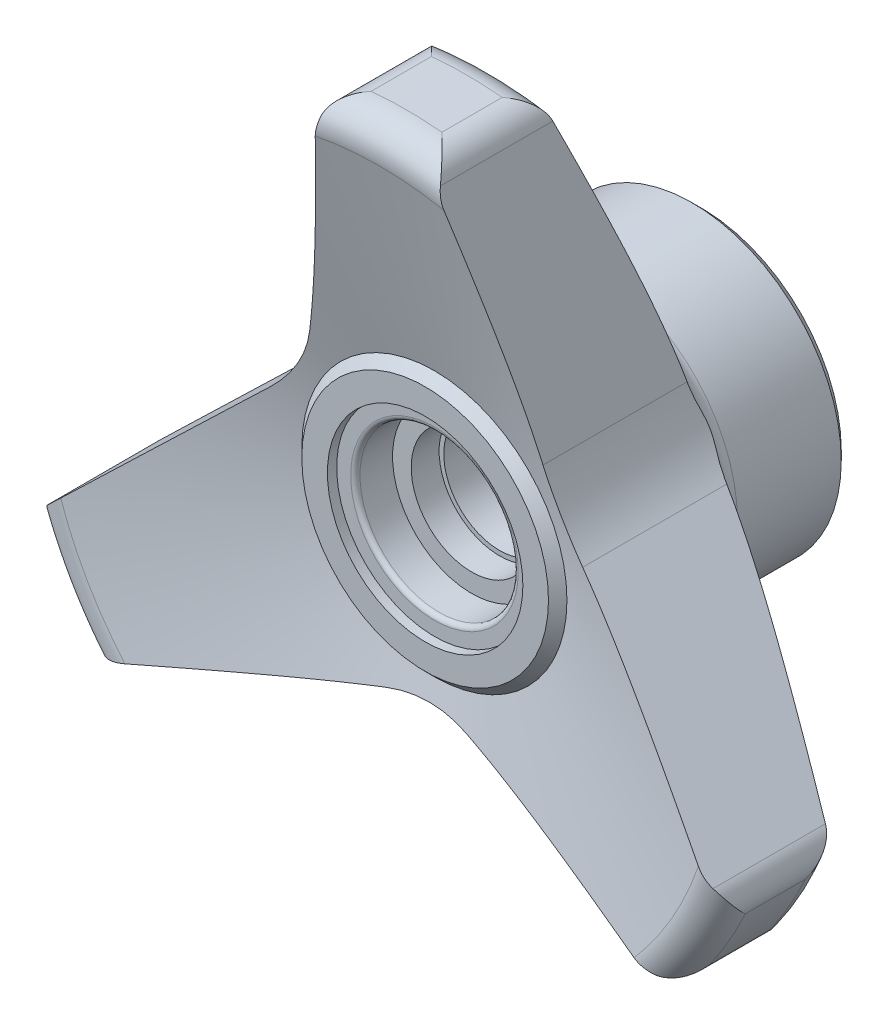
ISO-10303-21;
HEADER;
FILE_DESCRIPTION(('STEP AP214'),'2;1');
FILE_NAME('part.step','',(''),(''),'','','');
FILE_SCHEMA(('AUTOMOTIVE_DESIGN { 1 0 10303 214 1 1 1 1 }'));
ENDSEC;
DATA;
#1=APPLICATION_CONTEXT('core data for automotive mechanical design processes');
#2=APPLICATION_PROTOCOL_DEFINITION('international standard','automotive_design',2000,#1);
#3=PRODUCT_CONTEXT('',#1,'mechanical');
#4=PRODUCT('Part','Part','',(#3));
#5=PRODUCT_RELATED_PRODUCT_CATEGORY('part','',(#4));
#6=PRODUCT_DEFINITION_FORMATION('','',#4);
#7=PRODUCT_DEFINITION_CONTEXT('part definition',#1,'design');
#8=PRODUCT_DEFINITION('design','',#6,#7);
#9=PRODUCT_DEFINITION_SHAPE('','',#8);
#10=(LENGTH_UNIT() NAMED_UNIT(*) SI_UNIT(.MILLI.,.METRE.));
#11=(NAMED_UNIT(*) PLANE_ANGLE_UNIT() SI_UNIT($,.RADIAN.));
#12=(NAMED_UNIT(*) SI_UNIT($,.STERADIAN.) SOLID_ANGLE_UNIT());
#13=UNCERTAINTY_MEASURE_WITH_UNIT(LENGTH_MEASURE(1.E-05),#10,'distance_accuracy_value','');
#14=(GEOMETRIC_REPRESENTATION_CONTEXT(3) GLOBAL_UNCERTAINTY_ASSIGNED_CONTEXT((#13)) GLOBAL_UNIT_ASSIGNED_CONTEXT((#10,
#11,#12)) REPRESENTATION_CONTEXT('',''));
#15=CARTESIAN_POINT('',(0.,0.,0.));
#16=DIRECTION('',(0.,0.,1.));
#17=DIRECTION('',(1.,0.,0.));
#18=AXIS2_PLACEMENT_3D('',#15,#16,#17);
#19=CARTESIAN_POINT('',(0.,0.,14.3053506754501));
#20=DIRECTION('',(0.,0.,1.));
#21=DIRECTION('',(1.,0.,0.));
#22=AXIS2_PLACEMENT_3D('',#19,#20,#21);
#23=CONICAL_SURFACE('',#22,17.2507868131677,1.18682389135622);
#24=CARTESIAN_POINT('',(35.7565191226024,-13.22629562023,22.7388043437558));
#25=CARTESIAN_POINT('',(35.7507757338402,-13.2206682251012,22.7358392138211));
#26=CARTESIAN_POINT('',(35.7450111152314,-13.2150652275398,22.7328696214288));
#27=CARTESIAN_POINT('',(35.7334394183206,-13.2039080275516,22.7269215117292));
#28=CARTESIAN_POINT('',(35.7276323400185,-13.1983538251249,22.7239429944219));
#29=CARTESIAN_POINT('',(35.7218040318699,-13.1928240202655,22.7209600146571));
#30=B_SPLINE_CURVE_WITH_KNOTS('',3,(#24,#25,#26,#27,#28,#29),.UNSPECIFIED.,.F.,.F.,(4,2,4),(0.,
0.0257096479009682,0.0514192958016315),.UNSPECIFIED.);
#31=CARTESIAN_POINT('',(35.7561317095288,-13.225916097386,22.7386043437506));
#32=VERTEX_POINT('',#31);
#33=CARTESIAN_POINT('',(35.7220040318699,-13.1930137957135,22.7210623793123));
#34=VERTEX_POINT('',#33);
#35=EDGE_CURVE('E521',#32,#34,#30,.T.);
#36=ORIENTED_EDGE('',*,*,#35,.F.);
#37=CARTESIAN_POINT('',(0.,0.,22.7386043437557));
#38=DIRECTION('',(0.,0.,1.));
#39=DIRECTION('',(1.,0.,0.));
#40=AXIS2_PLACEMENT_3D('',#37,#38,#39);
#41=CIRCLE('',#40,38.1238220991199);
#42=CARTESIAN_POINT('',(29.3320451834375,-24.352760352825,22.7386043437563));
#43=VERTEX_POINT('',#42);
#44=EDGE_CURVE('E579',#43,#32,#41,.T.);
#45=ORIENTED_EDGE('',*,*,#44,.F.);
#46=CARTESIAN_POINT('',(29.2862871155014,-24.33959681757,22.720984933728));
#47=CARTESIAN_POINT('',(29.2939795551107,-24.3418760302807,22.7239637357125));
#48=CARTESIAN_POINT('',(29.3016824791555,-24.3441247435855,22.7269380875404));
#49=CARTESIAN_POINT('',(29.3171092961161,-24.348561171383,22.732877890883));
#50=CARTESIAN_POINT('',(29.324833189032,-24.3507488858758,22.7358433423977));
#51=CARTESIAN_POINT('',(29.3325675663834,-24.3529061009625,22.7388043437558));
#52=B_SPLINE_CURVE_WITH_KNOTS('',3,(#46,#47,#48,#49,#50,#51),.UNSPECIFIED.,.F.,.F.,(4,2,4),(0.,
0.0256738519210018,0.0513477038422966),.UNSPECIFIED.);
#53=CARTESIAN_POINT('',(29.2864871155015,-24.3396560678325,22.7210623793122));
#54=VERTEX_POINT('',#53);
#55=EDGE_CURVE('E439',#54,#43,#52,.T.);
#56=ORIENTED_EDGE('',*,*,#55,.F.);
#57=CARTESIAN_POINT('',(4.2600302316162,-16.926481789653,14.3875875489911));
#58=CARTESIAN_POINT('',(4.61656009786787,-17.0320907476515,14.4641332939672));
#59=CARTESIAN_POINT('',(4.97240844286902,-17.137497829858,14.5440679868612));
#60=CARTESIAN_POINT('',(5.68277708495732,-17.3479186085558,14.7100158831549));
#61=CARTESIAN_POINT('',(6.03729746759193,-17.4529323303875,14.7960286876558));
#62=CARTESIAN_POINT('',(6.74498368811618,-17.6625585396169,14.9734165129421));
#63=CARTESIAN_POINT('',(7.09814990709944,-17.7671711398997,15.064789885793));
#64=CARTESIAN_POINT('',(7.80331721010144,-17.9760512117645,15.2523179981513));
#65=CARTESIAN_POINT('',(8.15531827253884,-18.0803186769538,15.3484728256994));
#66=CARTESIAN_POINT('',(9.2090768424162,-18.392456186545,15.6430972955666));
#67=CARTESIAN_POINT('',(9.9092128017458,-18.5998459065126,15.8478851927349));
#68=CARTESIAN_POINT('',(11.3058424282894,-19.013546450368,16.2706879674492));
#69=CARTESIAN_POINT('',(12.0023357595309,-19.2198571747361,16.4887040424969));
#70=CARTESIAN_POINT('',(13.3913372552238,-19.6312981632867,16.9348929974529));
#71=CARTESIAN_POINT('',(14.0838493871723,-19.8364296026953,17.1630524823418));
#72=CARTESIAN_POINT('',(15.4662810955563,-20.2459245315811,17.6276623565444));
#73=CARTESIAN_POINT('',(16.1562007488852,-20.4502880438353,17.8641124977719));
#74=CARTESIAN_POINT('',(17.5340562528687,-20.8584274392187,18.3437434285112));
#75=CARTESIAN_POINT('',(18.2219916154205,-21.0622031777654,18.5869257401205));
#76=CARTESIAN_POINT('',(19.5960770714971,-21.4692258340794,19.0787187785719));
#77=CARTESIAN_POINT('',(20.2822271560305,-21.6724727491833,19.3273295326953));
#78=CARTESIAN_POINT('',(21.6632159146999,-22.0815402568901,19.832733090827));
#79=CARTESIAN_POINT('',(22.3580321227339,-22.2873541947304,20.0895925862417));
#80=CARTESIAN_POINT('',(23.7463042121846,-22.6985791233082,20.6070799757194));
#81=CARTESIAN_POINT('',(24.4397602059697,-22.9039901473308,20.8677075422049));
#82=CARTESIAN_POINT('',(25.8259701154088,-23.3146042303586,21.3922683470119));
#83=CARTESIAN_POINT('',(26.5187234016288,-23.5198071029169,21.65620339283));
#84=CARTESIAN_POINT('',(27.9033444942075,-23.9299505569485,22.1867727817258));
#85=CARTESIAN_POINT('',(28.5952122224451,-24.1348911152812,22.4534073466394));
#86=CARTESIAN_POINT('',(29.2866871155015,-24.3397153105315,22.7211398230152));
#87=B_SPLINE_CURVE_WITH_KNOTS('',3,(#57,#58,#59,#60,#61,#62,#63,#64,#65,#66,#67,#68,#69,#70,#71,
#72,#73,#74,#75,#76,#77,#78,#79,#80,#81,#82,#83,#84,#85,#86),.UNSPECIFIED.,.F.,.F.,(4,2,2,2,2,2,
2,2,2,2,2,2,2,2,4),(0.,1.13888351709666,2.27769235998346,3.41615292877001,4.55463446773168,
6.82959160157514,9.10475498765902,11.3769982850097,13.6491736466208,15.9218669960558,
18.1945717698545,20.5010611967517,22.8073513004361,25.1149620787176,27.4227640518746),.UNSPECIFIED.);
#88=CARTESIAN_POINT('',(4.2602302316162,-16.926541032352,14.3876304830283));
#89=VERTEX_POINT('',#88);
#90=EDGE_CURVE('E210',#89,#54,#87,.T.);
#91=ORIENTED_EDGE('',*,*,#90,.F.);
#92=CARTESIAN_POINT('',(4.2604302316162,-16.9266002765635,14.3876734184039));
#93=CARTESIAN_POINT('',(4.19368979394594,-16.9068282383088,14.3733408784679));
#94=CARTESIAN_POINT('',(4.12676285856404,-16.8875086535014,14.359297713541));
#95=CARTESIAN_POINT('',(3.9925359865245,-16.8497743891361,14.3317901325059));
#96=CARTESIAN_POINT('',(3.92523604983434,-16.8313597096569,14.3183257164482));
#97=CARTESIAN_POINT('',(3.8577496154,-16.8133974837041,14.3051506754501));
#98=B_SPLINE_CURVE_WITH_KNOTS('',3,(#92,#93,#94,#95,#96,#97),.UNSPECIFIED.,.F.,.F.,(4,2,4),(0.,
0.213183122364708,0.426366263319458),.UNSPECIFIED.);
#99=CARTESIAN_POINT('',(3.85877430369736,-16.8136702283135,14.3053506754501));
#100=VERTEX_POINT('',#99);
#101=EDGE_CURVE('E390',#89,#100,#98,.T.);
#102=ORIENTED_EDGE('',*,*,#101,.T.);
#103=CARTESIAN_POINT('',(0.,0.,14.3053506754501));
#104=DIRECTION('',(0.,0.,1.));
#105=DIRECTION('',(1.,0.,0.));
#106=AXIS2_PLACEMENT_3D('',#103,#104,#105);
#107=CIRCLE('',#106,17.2507868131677);
#108=CARTESIAN_POINT('',(16.4904526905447,5.06503857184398,14.3053506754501));
#109=VERTEX_POINT('',#108);
#110=EDGE_CURVE('E584',#100,#109,#107,.T.);
#111=ORIENTED_EDGE('',*,*,#110,.T.);
#112=CARTESIAN_POINT('',(17.9167411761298,3.80512050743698,14.735864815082));
#113=CARTESIAN_POINT('',(17.6391512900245,4.02055093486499,14.644240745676));
#114=CARTESIAN_POINT('',(17.3678785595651,4.2467812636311,14.5583987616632));
#115=CARTESIAN_POINT('',(16.8396043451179,4.72018894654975,14.4004366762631));
#116=CARTESIAN_POINT('',(16.5826151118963,4.96738383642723,14.3283282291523));
#117=CARTESIAN_POINT('',(16.0859077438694,5.48078358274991,14.2003819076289));
#118=CARTESIAN_POINT('',(15.8461312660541,5.74691747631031,14.1444869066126));
#119=CARTESIAN_POINT('',(15.3849195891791,6.29750955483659,14.0506740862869));
#120=CARTESIAN_POINT('',(15.1634788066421,6.58196211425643,14.012750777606));
#121=CARTESIAN_POINT('',(14.7399373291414,7.16867266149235,13.956301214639));
#122=CARTESIAN_POINT('',(14.5379246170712,7.47100247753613,13.9378597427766));
#123=CARTESIAN_POINT('',(14.1561739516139,8.08999275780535,13.9214984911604));
#124=CARTESIAN_POINT('',(13.9764381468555,8.40665460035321,13.9235806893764));
#125=CARTESIAN_POINT('',(13.6406637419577,9.05177897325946,13.9481823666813));
#126=CARTESIAN_POINT('',(13.4846403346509,9.38024890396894,13.9707148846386));
#127=CARTESIAN_POINT('',(13.1974674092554,10.0459762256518,14.0352278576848));
#128=CARTESIAN_POINT('',(13.0663158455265,10.3832328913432,14.0772067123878));
#129=CARTESIAN_POINT('',(12.8380746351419,11.0389613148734,14.1751696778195));
#130=CARTESIAN_POINT('',(12.7391946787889,11.3570016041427,14.2299040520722));
#131=CARTESIAN_POINT('',(12.5633113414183,11.9965180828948,14.3529286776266));
#132=CARTESIAN_POINT('',(12.4863109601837,12.3179947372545,14.4212207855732));
#133=CARTESIAN_POINT('',(12.3540990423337,12.9625447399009,14.569530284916));
#134=CARTESIAN_POINT('',(12.2988793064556,13.2856174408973,14.6495432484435));
#135=CARTESIAN_POINT('',(12.209908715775,13.9318961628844,14.8195364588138));
#136=CARTESIAN_POINT('',(12.1761448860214,14.2551019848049,14.9095106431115));
#137=CARTESIAN_POINT('',(12.1529365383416,14.577779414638,15.0036268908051));
#138=B_SPLINE_CURVE_WITH_KNOTS('',3,(#112,#113,#114,#115,#116,#117,#118,#119,#120,#121,#122,
#123,#124,#125,#126,#127,#128,#129,#130,#131,#132,#133,#134,#135,#136,#137),.UNSPECIFIED.,.F.,
.F.,(4,2,2,2,2,2,2,2,2,2,2,2,4),(0.,1.08930168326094,2.17952366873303,3.26585635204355,
4.35185700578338,5.44256456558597,6.53337724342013,7.62488589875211,8.71630474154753,
9.72785236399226,10.7395386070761,11.7508436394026,12.7615365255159),.UNSPECIFIED.);
#139=CARTESIAN_POINT('',(16.788929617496,4.77380296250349,14.3876304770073));
#140=VERTEX_POINT('',#139);
#141=EDGE_CURVE('E346',#109,#140,#138,.F.);
#142=ORIENTED_EDGE('',*,*,#141,.T.);
#143=CARTESIAN_POINT('',(16.788729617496,4.77399275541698,14.3875737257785));
#144=CARTESIAN_POINT('',(17.0584541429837,4.51803373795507,14.4641189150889));
#145=CARTESIAN_POINT('',(17.3276630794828,4.26256399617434,14.5440530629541));
#146=CARTESIAN_POINT('',(17.8650762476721,3.75257794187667,14.7099998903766));
#147=CARTESIAN_POINT('',(18.1332805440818,3.49806156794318,14.7960121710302));
#148=CARTESIAN_POINT('',(18.6686643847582,2.99000127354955,14.9733989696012));
#149=CARTESIAN_POINT('',(18.9358442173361,2.73645707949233,15.0647718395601));
#150=CARTESIAN_POINT('',(19.4693224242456,2.23020516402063,15.2522989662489));
#151=CARTESIAN_POINT('',(19.7356207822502,1.97749745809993,15.3484533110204));
#152=CARTESIAN_POINT('',(20.5328177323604,1.22098579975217,15.6430763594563));
#153=CARTESIAN_POINT('',(21.0624895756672,0.718345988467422,15.8478633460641));
#154=CARTESIAN_POINT('',(22.1190777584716,-0.284318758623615,16.2706643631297));
#155=CARTESIAN_POINT('',(22.6459938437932,-0.784343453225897,16.4886795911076));
#156=CARTESIAN_POINT('',(23.6968111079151,-1.78153180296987,16.9348669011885));
#157=CARTESIAN_POINT('',(24.2207152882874,-2.278698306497,17.1630255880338));
#158=CARTESIAN_POINT('',(25.2665623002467,-3.27117006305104,17.6276339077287));
#159=CARTESIAN_POINT('',(25.7885051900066,-3.76647537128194,17.8640832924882));
#160=CARTESIAN_POINT('',(26.8308901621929,-4.75566177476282,18.3437127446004));
#161=CARTESIAN_POINT('',(27.351331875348,-5.24954251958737,18.5868943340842));
#162=CARTESIAN_POINT('',(28.3908646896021,-6.236022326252,19.0786859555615));
#163=CARTESIAN_POINT('',(28.9099557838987,-6.72862138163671,19.3272960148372));
#164=CARTESIAN_POINT('',(29.9547220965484,-7.72006759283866,19.8327035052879));
#165=CARTESIAN_POINT('',(30.4803802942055,-8.21889859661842,20.0895677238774));
#166=CARTESIAN_POINT('',(31.5306675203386,-9.215583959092,20.607064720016));
#167=CARTESIAN_POINT('',(32.0552966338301,-9.71343839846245,20.8676971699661));
#168=CARTESIAN_POINT('',(33.1040237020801,-10.7086432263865,21.3922678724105));
#169=CARTESIAN_POINT('',(33.6281211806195,-11.2059931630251,21.6562079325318));
#170=CARTESIAN_POINT('',(34.6756462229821,-12.2000573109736,22.1867874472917));
#171=CARTESIAN_POINT('',(35.199073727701,-12.6967714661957,22.4534271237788));
#172=CARTESIAN_POINT('',(35.7222040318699,-13.1932035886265,22.7211647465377));
#173=B_SPLINE_CURVE_WITH_KNOTS('',3,(#143,#144,#145,#146,#147,#148,#149,#150,#151,#152,#153,
#154,#155,#156,#157,#158,#159,#160,#161,#162,#163,#164,#165,#166,#167,#168,#169,#170,#171,#172),
.UNSPECIFIED.,.F.,.F.,(4,2,2,2,2,2,2,2,2,2,2,2,2,2,4),(0.,1.13888136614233,2.27768805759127,
3.41614647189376,4.55462585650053,6.82957865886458,9.10473771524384,11.3769766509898,
13.6491476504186,15.9218366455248,18.1945370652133,20.501070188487,22.8074039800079,
25.1150585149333,27.4229042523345),.UNSPECIFIED.);
#174=EDGE_CURVE('E431',#140,#34,#173,.T.);
#175=ORIENTED_EDGE('',*,*,#174,.T.);
#176=EDGE_LOOP('',(#36,#45,#56,#91,#102,#111,#142,#175));
#177=FACE_BOUND('',#176,.T.);
#178=ADVANCED_FACE('F14',(#177),#23,.T.);
#179=CARTESIAN_POINT('',(12.5287474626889,12.1525380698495,14.3875881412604));
#180=CARTESIAN_POINT('',(12.4419425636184,12.5141064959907,14.4641339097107));
#181=CARTESIAN_POINT('',(12.3553035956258,12.8749837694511,14.5440686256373));
#182=CARTESIAN_POINT('',(12.1823490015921,13.5953915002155,14.7100165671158));
#183=CARTESIAN_POINT('',(12.0960333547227,13.9549220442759,14.7960293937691));
#184=CARTESIAN_POINT('',(11.9237318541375,14.6726094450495,14.973417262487));
#185=CARTESIAN_POINT('',(11.8377459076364,15.0307666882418,15.0647906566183));
#186=CARTESIAN_POINT('',(11.6660576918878,15.7458995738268,15.2523188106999));
#187=CARTESIAN_POINT('',(11.5803554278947,16.1028751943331,15.3484736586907));
#188=CARTESIAN_POINT('',(11.3237951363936,17.1715257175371,15.643098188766));
#189=CARTESIAN_POINT('',(11.1533319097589,17.8815561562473,15.8478861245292));
#190=CARTESIAN_POINT('',(10.8132922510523,19.2979232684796,16.2706889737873));
#191=CARTESIAN_POINT('',(10.6437159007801,20.0042596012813,16.4887050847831));
#192=CARTESIAN_POINT('',(10.3055334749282,21.4128907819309,16.9348941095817));
#193=CARTESIAN_POINT('',(10.1369264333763,22.1151896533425,17.1630536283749));
#194=CARTESIAN_POINT('',(9.80034356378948,23.517158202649,17.6276635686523));
#195=CARTESIAN_POINT('',(9.63236771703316,24.2168279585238,17.8641137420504));
#196=CARTESIAN_POINT('',(9.29689902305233,25.6141556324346,18.3437447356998));
#197=CARTESIAN_POINT('',(9.1294062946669,26.3118130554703,18.5869270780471));
#198=CARTESIAN_POINT('',(8.79485550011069,27.7053174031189,19.0787201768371));
#199=CARTESIAN_POINT('',(8.62779743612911,28.4011643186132,19.327330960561));
#200=CARTESIAN_POINT('',(8.29156603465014,29.8016688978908,19.832734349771));
#201=CARTESIAN_POINT('',(8.122398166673,30.5063037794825,20.0895936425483));
#202=CARTESIAN_POINT('',(7.78439363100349,31.9141939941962,20.6070806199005));
#203=CARTESIAN_POINT('',(7.61555693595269,32.6174494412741,20.8677079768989));
#204=CARTESIAN_POINT('',(7.27805448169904,34.0232483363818,21.3922683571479));
#205=CARTESIAN_POINT('',(7.10938887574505,34.7257911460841,21.6562031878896));
#206=CARTESIAN_POINT('',(6.77227325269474,36.1299787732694,22.1867721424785));
#207=CARTESIAN_POINT('',(6.60382325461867,36.8316235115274,22.4534064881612));
#208=CARTESIAN_POINT('',(6.43546890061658,37.532869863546,22.7211387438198));
#209=B_SPLINE_CURVE_WITH_KNOTS('',3,(#179,#180,#181,#182,#183,#184,#185,#186,#187,#188,#189,
#190,#191,#192,#193,#194,#195,#196,#197,#198,#199,#200,#201,#202,#203,#204,#205,#206,#207,#208),
.UNSPECIFIED.,.F.,.F.,(4,2,2,2,2,2,2,2,2,2,2,2,2,2,4),(0.,1.13888360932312,2.27769254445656,
3.41615320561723,4.55463483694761,6.82959215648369,9.10475572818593,11.376999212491,
13.6491747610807,15.9218682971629,18.1945732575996,20.5010608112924,22.8073490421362,
25.1149579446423,27.4227580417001),.UNSPECIFIED.);
#210=CARTESIAN_POINT('',(12.5286994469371,12.1527380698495,14.3876304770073));
#211=VERTEX_POINT('',#210);
#212=CARTESIAN_POINT('',(6.4355169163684,37.532669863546,22.7210623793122));
#213=VERTEX_POINT('',#212);
#214=EDGE_CURVE('E354',#211,#213,#209,.T.);
#215=ORIENTED_EDGE('',*,*,#214,.F.);
#216=CARTESIAN_POINT('',(12.6316784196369,11.7486316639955,14.3053506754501));
#217=VERTEX_POINT('',#216);
#218=EDGE_CURVE('E355',#211,#217,#138,.F.);
#219=ORIENTED_EDGE('',*,*,#218,.T.);
#220=CARTESIAN_POINT('',(-12.6316784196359,11.7486316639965,14.3053506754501));
#221=VERTEX_POINT('',#220);
#222=EDGE_CURVE('E588',#217,#221,#107,.T.);
#223=ORIENTED_EDGE('',*,*,#222,.T.);
#224=CARTESIAN_POINT('',(-17.9167429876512,3.80511910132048,14.7358654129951));
#225=CARTESIAN_POINT('',(-17.6391530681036,4.02054948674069,14.6442413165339));
#226=CARTESIAN_POINT('',(-17.3678803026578,4.24677977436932,14.5583993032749));
#227=CARTESIAN_POINT('',(-16.8396060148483,4.72018737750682,14.4004371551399));
#228=CARTESIAN_POINT('',(-16.5826167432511,4.96738222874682,14.3283286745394));
#229=CARTESIAN_POINT('',(-16.0859092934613,5.48078190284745,14.2003822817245));
#230=CARTESIAN_POINT('',(-15.8461327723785,5.74691576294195,14.1444872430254));
#231=CARTESIAN_POINT('',(-15.3849210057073,6.29750777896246,14.0506743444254));
#232=CARTESIAN_POINT('',(-15.1634801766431,6.5819603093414,14.0127509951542));
#233=CARTESIAN_POINT('',(-14.7399386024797,7.16867080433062,13.9563013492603));
#234=CARTESIAN_POINT('',(-14.537925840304,7.4710005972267,13.9378598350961));
#235=CARTESIAN_POINT('',(-14.1561750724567,8.08999083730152,13.9214984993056));
#236=CARTESIAN_POINT('',(-13.976439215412,8.40665266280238,13.923580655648));
#237=CARTESIAN_POINT('',(-13.6406647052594,9.0517770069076,13.9481822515));
#238=CARTESIAN_POINT('',(-13.4846412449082,9.38024692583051,13.9707147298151));
#239=CARTESIAN_POINT('',(-13.1974682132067,10.0459742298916,14.0352276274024));
#240=CARTESIAN_POINT('',(-13.0663165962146,10.3832308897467,14.077206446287));
#241=CARTESIAN_POINT('',(-12.8380752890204,11.0389592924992,14.1751693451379));
#242=CARTESIAN_POINT('',(-12.7391952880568,11.3569995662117,14.2299036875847));
#243=CARTESIAN_POINT('',(-12.5633118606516,11.9965160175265,14.3529282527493));
#244=CARTESIAN_POINT('',(-12.4863114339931,12.3179926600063,14.4212203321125));
#245=CARTESIAN_POINT('',(-12.3540994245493,12.9625426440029,14.5695297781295));
#246=CARTESIAN_POINT('',(-12.2988796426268,13.285615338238,14.6495427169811));
#247=CARTESIAN_POINT('',(-12.2099089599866,13.9318940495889,14.8195358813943));
#248=CARTESIAN_POINT('',(-12.1761450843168,14.2550998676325,14.9095100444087));
#249=CARTESIAN_POINT('',(-12.1529366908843,14.5777772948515,15.0036262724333));
#250=B_SPLINE_CURVE_WITH_KNOTS('',3,(#224,#225,#226,#227,#228,#229,#230,#231,#232,#233,#234,
#235,#236,#237,#238,#239,#240,#241,#242,#243,#244,#245,#246,#247,#248,#249),.UNSPECIFIED.,.F.,
.F.,(4,2,2,2,2,2,2,2,2,2,2,2,4),(0.,1.08930170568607,2.17952371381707,3.2658564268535,
4.3518571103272,5.44256470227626,6.53337741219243,7.62488609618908,8.71630496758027,
9.72785256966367,10.7395387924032,11.7508438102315,12.7615366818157),.UNSPECIFIED.);
#251=CARTESIAN_POINT('',(-12.5286990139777,12.1527398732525,14.3876308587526));
#252=VERTEX_POINT('',#251);
#253=EDGE_CURVE('E413',#221,#252,#250,.T.);
#254=ORIENTED_EDGE('',*,*,#253,.T.);
#255=CARTESIAN_POINT('',(-12.5287470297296,12.1525398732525,14.3875885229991));
#256=CARTESIAN_POINT('',(-12.4419421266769,12.5141083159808,14.4641343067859));
#257=CARTESIAN_POINT('',(-12.3553031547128,12.8749856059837,14.5440690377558));
#258=CARTESIAN_POINT('',(-12.1823485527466,13.5953933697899,14.7100170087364));
#259=CARTESIAN_POINT('',(-12.096032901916,13.9549239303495,14.7960298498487));
#260=CARTESIAN_POINT('',(-11.9237313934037,14.6726113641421,14.9734177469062));
#261=CARTESIAN_POINT('',(-11.8377454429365,15.0307686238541,15.0647911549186));
#262=CARTESIAN_POINT('',(-11.6660572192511,15.7459015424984,15.2523193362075));
#263=CARTESIAN_POINT('',(-11.5803549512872,16.1028771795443,15.3484741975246));
#264=CARTESIAN_POINT('',(-11.3237946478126,17.1715277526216,15.643098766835));
#265=CARTESIAN_POINT('',(-11.1533314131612,17.8815582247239,15.847886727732));
#266=CARTESIAN_POINT('',(-10.8132917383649,19.2979254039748,16.2706896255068));
#267=CARTESIAN_POINT('',(-10.6437153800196,20.0042617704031,16.488705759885));
#268=CARTESIAN_POINT('',(-10.305532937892,21.4128930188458,16.934894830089));
#269=CARTESIAN_POINT('',(-10.1369258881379,22.1151919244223,17.1630543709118));
#270=CARTESIAN_POINT('',(-9.80034300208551,23.5171605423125,17.6276643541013));
#271=CARTESIAN_POINT('',(-9.63236714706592,24.2168303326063,17.8641145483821));
#272=CARTESIAN_POINT('',(-9.29689843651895,25.6141580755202,18.3437455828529));
#273=CARTESIAN_POINT('',(-9.12940569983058,26.3118155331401,18.5869279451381));
#274=CARTESIAN_POINT('',(-8.79485488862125,27.7053199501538,19.0787210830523));
#275=CARTESIAN_POINT('',(-8.62779681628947,28.4011669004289,19.3273318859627));
#276=CARTESIAN_POINT('',(-8.29156545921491,29.8016712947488,19.8327352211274));
#277=CARTESIAN_POINT('',(-8.12239764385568,30.5063059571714,20.0895944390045));
#278=CARTESIAN_POINT('',(-7.78439321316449,31.9141957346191,20.6070812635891));
#279=CARTESIAN_POINT('',(-7.61555657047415,32.6174509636,20.8677085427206));
#280=CARTESIAN_POINT('',(-7.27805422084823,34.0232494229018,21.3922687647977));
#281=CARTESIAN_POINT('',(-7.10938866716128,34.7257920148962,21.6562035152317));
#282=CARTESIAN_POINT('',(-6.77227314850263,36.129979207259,22.1867723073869));
#283=CARTESIAN_POINT('',(-6.60382320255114,36.8316237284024,22.4534065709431));
#284=CARTESIAN_POINT('',(-6.43546890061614,37.532869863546,22.7211387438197));
#285=B_SPLINE_CURVE_WITH_KNOTS('',3,(#255,#256,#257,#258,#259,#260,#261,#262,#263,#264,#265,
#266,#267,#268,#269,#270,#271,#272,#273,#274,#275,#276,#277,#278,#279,#280,#281,#282,#283,#284),
.UNSPECIFIED.,.F.,.F.,(4,2,2,2,2,2,2,2,2,2,2,2,2,2,4),(0.,1.13888366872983,2.27769266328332,
3.416153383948,4.55463507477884,6.82959251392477,9.10475620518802,11.3769998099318,
13.6491754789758,15.9218691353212,18.1945742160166,20.50106105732,22.8073485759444,
25.1149567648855,27.4227561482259),.UNSPECIFIED.);
#286=CARTESIAN_POINT('',(-6.43551691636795,37.532669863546,22.7210623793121));
#287=VERTEX_POINT('',#286);
#288=EDGE_CURVE('E421',#252,#287,#285,.T.);
#289=ORIENTED_EDGE('',*,*,#288,.T.);
#290=CARTESIAN_POINT('',(-6.4239515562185,37.579201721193,22.7388043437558));
#291=CARTESIAN_POINT('',(-6.42595042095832,37.571425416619,22.7358435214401));
#292=CARTESIAN_POINT('',(-6.42791763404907,37.5636429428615,22.7328782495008));
#293=CARTESIAN_POINT('',(-6.43178875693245,37.5480656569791,22.7269388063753));
#294=CARTESIAN_POINT('',(-6.43369266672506,37.5402708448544,22.723964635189));
#295=CARTESIAN_POINT('',(-6.43556492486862,37.532469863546,22.7209860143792));
#296=B_SPLINE_CURVE_WITH_KNOTS('',3,(#290,#291,#292,#293,#294,#295),.UNSPECIFIED.,.F.,.F.,(4,2,
4),(0.,0.0256722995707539,0.0513445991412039),.UNSPECIFIED.);
#297=CARTESIAN_POINT('',(-6.42408652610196,37.5786764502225,22.7386043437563));
#298=VERTEX_POINT('',#297);
#299=EDGE_CURVE('E464',#298,#287,#296,.T.);
#300=ORIENTED_EDGE('',*,*,#299,.F.);
#301=CARTESIAN_POINT('',(6.42408652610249,37.5786764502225,22.7386043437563));
#302=VERTEX_POINT('',#301);
#303=EDGE_CURVE('E581',#302,#298,#41,.T.);
#304=ORIENTED_EDGE('',*,*,#303,.F.);
#305=CARTESIAN_POINT('',(6.43556492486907,37.532469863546,22.7209860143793));
#306=CARTESIAN_POINT('',(6.43369266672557,37.5402708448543,22.7239646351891));
#307=CARTESIAN_POINT('',(6.43178875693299,37.548065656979,22.7269388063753));
#308=CARTESIAN_POINT('',(6.42791763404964,37.5636429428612,22.7328782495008));
#309=CARTESIAN_POINT('',(6.42595042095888,37.5714254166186,22.73584352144));
#310=CARTESIAN_POINT('',(6.42395155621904,37.5792017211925,22.7388043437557));
#311=B_SPLINE_CURVE_WITH_KNOTS('',3,(#305,#306,#307,#308,#309,#310),.UNSPECIFIED.,.F.,.F.,(4,2,
4),(0.,0.0256722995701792,0.0513445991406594),.UNSPECIFIED.);
#312=EDGE_CURVE('E472',#213,#302,#311,.T.);
#313=ORIENTED_EDGE('',*,*,#312,.F.);
#314=EDGE_LOOP('',(#215,#219,#223,#254,#289,#300,#304,#313));
#315=FACE_BOUND('',#314,.T.);
#316=ADVANCED_FACE('F370',(#315),#23,.T.);
#317=CARTESIAN_POINT('',(-16.7887324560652,4.77399006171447,14.3875745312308));
#318=CARTESIAN_POINT('',(-17.0584570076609,4.51803101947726,14.4641197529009));
#319=CARTESIAN_POINT('',(-17.3276659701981,4.26256125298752,14.5440539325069));
#320=CARTESIAN_POINT('',(-17.8650791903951,3.7525751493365,14.710000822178));
#321=CARTESIAN_POINT('',(-18.1332835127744,3.49805875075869,14.7960131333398));
#322=CARTESIAN_POINT('',(-18.6686674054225,2.98999840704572,14.9733999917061));
#323=CARTESIAN_POINT('',(-18.9358472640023,2.73645418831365,15.0647728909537));
#324=CARTESIAN_POINT('',(-19.469325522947,2.23020222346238,15.2523000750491));
#325=CARTESIAN_POINT('',(-19.7356239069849,1.97749449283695,15.3484544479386));
#326=CARTESIAN_POINT('',(-20.5328209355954,1.22098275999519,15.6430775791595));
#327=CARTESIAN_POINT('',(-21.0624928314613,0.718342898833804,15.8478646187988));
#328=CARTESIAN_POINT('',(-22.1190811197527,-0.284321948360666,16.2706657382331));
#329=CARTESIAN_POINT('',(-22.6459972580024,-0.784346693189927,16.4886810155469));
#330=CARTESIAN_POINT('',(-23.6968146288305,-1.78153514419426,16.9348684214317));
#331=CARTESIAN_POINT('',(-24.220718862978,-2.27870169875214,17.1630271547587));
#332=CARTESIAN_POINT('',(-25.266565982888,-3.27117355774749,17.6276355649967));
#333=CARTESIAN_POINT('',(-25.7885089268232,-3.76647891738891,17.864084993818));
#334=CARTESIAN_POINT('',(-26.83089400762,-4.75566542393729,18.3437145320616));
#335=CARTESIAN_POINT('',(-27.3513357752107,-5.24954622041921,18.5868961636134));
#336=CARTESIAN_POINT('',(-28.3908686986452,-6.23602613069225,19.0786878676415));
#337=CARTESIAN_POINT('',(-28.9099598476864,-6.72862523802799,19.3272979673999));
#338=CARTESIAN_POINT('',(-29.9547258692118,-7.72007117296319,19.8327053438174));
#339=CARTESIAN_POINT('',(-30.4803837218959,-8.21890184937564,20.0895694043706));
#340=CARTESIAN_POINT('',(-31.5306702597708,-9.21558655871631,20.6070660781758));
#341=CARTESIAN_POINT('',(-32.0552990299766,-9.71344067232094,20.8676983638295));
#342=CARTESIAN_POINT('',(-33.1040254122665,-10.7086448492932,21.3922687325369));
#343=CARTESIAN_POINT('',(-33.6281225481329,-11.2059944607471,21.6562086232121));
#344=CARTESIAN_POINT('',(-34.6756469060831,-12.2000579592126,22.1867877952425));
#345=CARTESIAN_POINT('',(-35.1990740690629,-12.6967717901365,22.4534272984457));
#346=CARTESIAN_POINT('',(-35.7222040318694,-13.193203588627,22.7211647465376));
#347=B_SPLINE_CURVE_WITH_KNOTS('',3,(#317,#318,#319,#320,#321,#322,#323,#324,#325,#326,#327,
#328,#329,#330,#331,#332,#333,#334,#335,#336,#337,#338,#339,#340,#341,#342,#343,#344,#345,#346),
.UNSPECIFIED.,.F.,.F.,(4,2,2,2,2,2,2,2,2,2,2,2,2,2,4),(0.,1.13888149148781,2.27768830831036,
3.41614684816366,4.55462635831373,6.82957941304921,9.10473872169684,11.3769779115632,
13.6491491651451,15.9218384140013,18.1945390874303,20.5010707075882,22.8074029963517,
25.1150560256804,27.4229002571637),.UNSPECIFIED.);
#348=CARTESIAN_POINT('',(-16.7889324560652,4.77380026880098,14.387631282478));
#349=VERTEX_POINT('',#348);
#350=CARTESIAN_POINT('',(-35.7220040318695,-13.1930137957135,22.7210623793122));
#351=VERTEX_POINT('',#350);
#352=EDGE_CURVE('E406',#349,#351,#347,.T.);
#353=ORIENTED_EDGE('',*,*,#352,.F.);
#354=CARTESIAN_POINT('',(-16.4904526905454,5.06503857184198,14.3053506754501));
#355=VERTEX_POINT('',#354);
#356=EDGE_CURVE('E606',#349,#355,#250,.T.);
#357=ORIENTED_EDGE('',*,*,#356,.T.);
#358=CARTESIAN_POINT('',(-3.85877423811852,-16.813670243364,14.3053506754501));
#359=VERTEX_POINT('',#358);
#360=EDGE_CURVE('E587',#355,#359,#107,.T.);
#361=ORIENTED_EDGE('',*,*,#360,.T.);
#362=CARTESIAN_POINT('',(-3.85774954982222,-16.8133974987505,14.3051506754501));
#363=CARTESIAN_POINT('',(-3.92523597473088,-16.8313597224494,14.318325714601));
#364=CARTESIAN_POINT('',(-3.99253590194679,-16.8497743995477,14.3317901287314));
#365=CARTESIAN_POINT('',(-4.12676275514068,-16.8875086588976,14.3592977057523));
#366=CARTESIAN_POINT('',(-4.19368968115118,-16.9068282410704,14.3733408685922));
#367=CARTESIAN_POINT('',(-4.26043010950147,-16.9266002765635,14.3876734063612));
#368=B_SPLINE_CURVE_WITH_KNOTS('',3,(#362,#363,#364,#365,#366,#367),.UNSPECIFIED.,.F.,.F.,(4,2,
4),(0.,0.213183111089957,0.426366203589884),.UNSPECIFIED.);
#369=CARTESIAN_POINT('',(-4.26023010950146,-16.926541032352,14.3876304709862));
#370=VERTEX_POINT('',#369);
#371=EDGE_CURVE('E220',#359,#370,#368,.T.);
#372=ORIENTED_EDGE('',*,*,#371,.T.);
#373=CARTESIAN_POINT('',(-4.26003010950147,-16.926481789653,14.3875875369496));
#374=CARTESIAN_POINT('',(-4.61655997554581,-17.0320907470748,14.4641332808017));
#375=CARTESIAN_POINT('',(-4.97240832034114,-17.137497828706,14.5440679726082));
#376=CARTESIAN_POINT('',(-5.68277696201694,-17.3479186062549,14.7100158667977));
#377=CARTESIAN_POINT('',(-6.03729734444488,-17.452932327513,14.7960286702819));
#378=CARTESIAN_POINT('',(-6.74498356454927,-17.6625585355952,14.9734164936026));
#379=CARTESIAN_POINT('',(-7.09814978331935,-17.7671711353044,15.0647898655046));
#380=CARTESIAN_POINT('',(-7.80331708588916,-17.9760512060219,15.2523179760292));
#381=CARTESIAN_POINT('',(-8.15531814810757,-18.0803186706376,15.3484728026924));
#382=CARTESIAN_POINT('',(-9.20907671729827,-18.3924561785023,15.6430972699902));
#383=CARTESIAN_POINT('',(-9.90921267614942,-18.5998458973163,15.8478851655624));
#384=CARTESIAN_POINT('',(-11.3058423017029,-19.0135464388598,16.2706879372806));
#385=CARTESIAN_POINT('',(-12.0023356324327,-19.2198571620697,16.4887040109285));
#386=CARTESIAN_POINT('',(-13.3913371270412,-19.6312981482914,16.934892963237));
#387=CARTESIAN_POINT('',(-14.0838492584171,-19.8364295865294,17.1630524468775));
#388=CARTESIAN_POINT('',(-15.4662809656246,-20.2459245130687,17.6276623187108));
#389=CARTESIAN_POINT('',(-16.1562006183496,-20.4502880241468,17.8641124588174));
#390=CARTESIAN_POINT('',(-17.5340561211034,-20.8584274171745,18.3437433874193));
#391=CARTESIAN_POINT('',(-18.2219914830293,-21.0622031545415,18.5869256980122));
#392=CARTESIAN_POINT('',(-19.5960769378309,-21.4692258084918,19.0787187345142));
#393=CARTESIAN_POINT('',(-20.282227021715,-21.6724727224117,19.3273294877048));
#394=CARTESIAN_POINT('',(-21.6632157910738,-22.0815402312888,19.8327330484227));
#395=CARTESIAN_POINT('',(-22.3580320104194,-22.2873541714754,20.0895925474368));
#396=CARTESIAN_POINT('',(-23.7463041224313,-22.6985791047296,20.6070799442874));
#397=CARTESIAN_POINT('',(-24.439760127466,-22.9039901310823,20.8677075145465));
#398=CARTESIAN_POINT('',(-25.8259700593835,-23.3146042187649,21.392268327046));
#399=CARTESIAN_POINT('',(-26.5187233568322,-23.5198070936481,21.6562033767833));
#400=CARTESIAN_POINT('',(-27.9033444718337,-23.9299505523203,22.1867727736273));
#401=CARTESIAN_POINT('',(-28.5952122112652,-24.1348911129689,22.4534073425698));
#402=CARTESIAN_POINT('',(-29.286687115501,-24.3397153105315,22.721139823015));
#403=B_SPLINE_CURVE_WITH_KNOTS('',3,(#373,#374,#375,#376,#377,#378,#379,#380,#381,#382,#383,
#384,#385,#386,#387,#388,#389,#390,#391,#392,#393,#394,#395,#396,#397,#398,#399,#400,#401,#402),
.UNSPECIFIED.,.F.,.F.,(4,2,2,2,2,2,2,2,2,2,2,2,2,2,4),(0.,1.13888351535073,2.27769235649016,
3.41615292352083,4.554634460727,6.82959159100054,9.10475497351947,11.3769982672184,
13.6491736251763,15.9218669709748,18.1945717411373,20.5010612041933,22.8073513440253,
25.1149621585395,27.4227641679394),.UNSPECIFIED.);
#404=CARTESIAN_POINT('',(-29.286487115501,-24.3396560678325,22.7210623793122));
#405=VERTEX_POINT('',#404);
#406=EDGE_CURVE('E398',#370,#405,#403,.T.);
#407=ORIENTED_EDGE('',*,*,#406,.T.);
#408=CARTESIAN_POINT('',(-29.3325675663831,-24.3529061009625,22.7388043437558));
#409=CARTESIAN_POINT('',(-29.3248331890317,-24.3507488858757,22.7358433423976));
#410=CARTESIAN_POINT('',(-29.3171092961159,-24.348561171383,22.7328778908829));
#411=CARTESIAN_POINT('',(-29.3016824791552,-24.3441247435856,22.7269380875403));
#412=CARTESIAN_POINT('',(-29.2939795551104,-24.341876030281,22.7239637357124));
#413=CARTESIAN_POINT('',(-29.286287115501,-24.3395968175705,22.720984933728));
#414=B_SPLINE_CURVE_WITH_KNOTS('',3,(#408,#409,#410,#411,#412,#413),.UNSPECIFIED.,.F.,.F.,(4,2,
4),(0.,0.0256738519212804,0.0513477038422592),.UNSPECIFIED.);
#415=CARTESIAN_POINT('',(-29.3320451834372,-24.3527603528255,22.7386043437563));
#416=VERTEX_POINT('',#415);
#417=EDGE_CURVE('E447',#416,#405,#414,.T.);
#418=ORIENTED_EDGE('',*,*,#417,.F.);
#419=CARTESIAN_POINT('',(-35.7561317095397,-13.2259160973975,22.7386043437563));
#420=VERTEX_POINT('',#419);
#421=EDGE_CURVE('E585',#420,#416,#41,.T.);
#422=ORIENTED_EDGE('',*,*,#421,.F.);
#423=CARTESIAN_POINT('',(-35.7218040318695,-13.192824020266,22.720960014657));
#424=CARTESIAN_POINT('',(-35.7276323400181,-13.1983538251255,22.7239429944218));
#425=CARTESIAN_POINT('',(-35.7334394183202,-13.2039080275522,22.7269215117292));
#426=CARTESIAN_POINT('',(-35.7450111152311,-13.2150652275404,22.7328696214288));
#427=CARTESIAN_POINT('',(-35.7507757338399,-13.2206682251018,22.735839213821));
#428=CARTESIAN_POINT('',(-35.7565191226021,-13.2262956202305,22.7388043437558));
#429=B_SPLINE_CURVE_WITH_KNOTS('',3,(#423,#424,#425,#426,#427,#428),.UNSPECIFIED.,.F.,.F.,(4,2,
4),(0.,0.0257096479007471,0.0514192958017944),.UNSPECIFIED.);
#430=EDGE_CURVE('E456',#351,#420,#429,.T.);
#431=ORIENTED_EDGE('',*,*,#430,.F.);
#432=EDGE_LOOP('',(#353,#357,#361,#372,#407,#418,#422,#431));
#433=FACE_BOUND('',#432,.T.);
#434=ADVANCED_FACE('F372',(#433),#23,.T.);
#435=CARTESIAN_POINT('',(0.,0.,25.520154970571));
#436=DIRECTION('',(0.,0.,1.));
#437=DIRECTION('',(1.,0.,0.));
#438=AXIS2_PLACEMENT_3D('',#435,#436,#437);
#439=TOROIDAL_SURFACE('',#438,37.,3.00000000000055);
#440=CARTESIAN_POINT('',(36.3858814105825,-16.615283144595,25.520154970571));
#441=CARTESIAN_POINT('',(36.3870180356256,-16.6127940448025,25.5175232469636));
#442=CARTESIAN_POINT('',(36.3881512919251,-16.6103033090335,25.5148914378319));
#443=CARTESIAN_POINT('',(36.482990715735,-16.4011008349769,25.2939777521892));
#444=CARTESIAN_POINT('',(36.5535012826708,-16.1831839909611,25.0751516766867));
#445=CARTESIAN_POINT('',(36.621220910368,-15.844895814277,24.7512006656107));
#446=CARTESIAN_POINT('',(36.6374480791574,-15.7300247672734,24.6437517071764));
#447=CARTESIAN_POINT('',(36.6564770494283,-15.4971944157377,24.4310523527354));
#448=CARTESIAN_POINT('',(36.6592853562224,-15.3792366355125,24.3258009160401));
#449=CARTESIAN_POINT('',(36.6485107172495,-15.082589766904,24.0674922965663));
#450=CARTESIAN_POINT('',(36.6262132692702,-14.9024884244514,23.9163058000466));
#451=CARTESIAN_POINT('',(36.5463109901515,-14.5410673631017,23.6251386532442));
#452=CARTESIAN_POINT('',(36.4887587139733,-14.3597498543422,23.4851416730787));
#453=CARTESIAN_POINT('',(36.35306037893,-14.0452503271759,23.254658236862));
#454=CARTESIAN_POINT('',(36.2834047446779,-13.9111506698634,23.1604412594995));
#455=CARTESIAN_POINT('',(36.1197622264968,-13.6492047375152,22.9859387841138));
#456=CARTESIAN_POINT('',(36.0258672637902,-13.5213369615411,22.9056025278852));
#457=CARTESIAN_POINT('',(35.8678415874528,-13.3398179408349,22.8002696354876));
#458=CARTESIAN_POINT('',(35.8132816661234,-13.2818555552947,22.7680786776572));
#459=CARTESIAN_POINT('',(35.7557441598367,-13.2255365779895,22.7384043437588));
#460=B_SPLINE_CURVE_WITH_KNOTS('',3,(#440,#441,#442,#443,#444,#445,#446,#447,#448,#449,#450,
#451,#452,#453,#454,#455,#456,#457,#458,#459),.UNSPECIFIED.,.F.,.F.,(4,2,2,2,2,2,2,2,2,4),(0.,
0.0113899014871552,0.956037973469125,1.4299850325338,1.90370230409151,2.60975171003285,
3.3147511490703,3.84716485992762,4.37758845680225,4.63487488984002),.UNSPECIFIED.);
#461=CARTESIAN_POINT('',(36.3858814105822,-16.615283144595,25.520154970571));
#462=VERTEX_POINT('',#461);
#463=EDGE_CURVE('E478',#462,#32,#460,.T.);
#464=ORIENTED_EDGE('',*,*,#463,.F.);
#465=CARTESIAN_POINT('',(0.,0.,25.520154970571));
#466=DIRECTION('',(0.,0.,1.));
#467=DIRECTION('',(1.,0.,0.));
#468=AXIS2_PLACEMENT_3D('',#465,#466,#467);
#469=CIRCLE('',#468,40.0000000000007);
#470=CARTESIAN_POINT('',(32.5821979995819,-23.2034560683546,25.520154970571));
#471=VERTEX_POINT('',#470);
#472=EDGE_CURVE('E574',#471,#462,#469,.T.);
#473=ORIENTED_EDGE('',*,*,#472,.F.);
#474=CARTESIAN_POINT('',(29.3315227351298,-24.352614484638,22.7384043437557));
#475=CARTESIAN_POINT('',(29.4147843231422,-24.3758695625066,22.7702739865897));
#476=CARTESIAN_POINT('',(29.4979195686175,-24.395210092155,22.8050148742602));
#477=CARTESIAN_POINT('',(29.6631814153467,-24.4264886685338,22.8794391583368));
#478=CARTESIAN_POINT('',(29.7453096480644,-24.4384408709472,22.9191129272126));
#479=CARTESIAN_POINT('',(29.987810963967,-24.4637823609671,23.0436550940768));
#480=CARTESIAN_POINT('',(30.1460847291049,-24.467126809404,23.1347495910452));
#481=CARTESIAN_POINT('',(30.4939140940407,-24.4484187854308,23.3541956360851));
#482=CARTESIAN_POINT('',(30.6808082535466,-24.4194865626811,23.486056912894));
#483=CARTESIAN_POINT('',(31.0382582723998,-24.3310497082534,23.7627619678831));
#484=CARTESIAN_POINT('',(31.2087164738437,-24.2713742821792,23.9076745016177));
#485=CARTESIAN_POINT('',(31.4753875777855,-24.1513671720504,24.1543160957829));
#486=CARTESIAN_POINT('',(31.5770325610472,-24.0982616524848,24.2538348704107));
#487=CARTESIAN_POINT('',(31.7718471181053,-23.9821559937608,24.4553887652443));
#488=CARTESIAN_POINT('',(31.8650134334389,-23.9191520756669,24.5574248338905));
#489=CARTESIAN_POINT('',(32.1308425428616,-23.7171105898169,24.8655501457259));
#490=CARTESIAN_POINT('',(32.2906064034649,-23.5646837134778,25.0743774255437));
#491=CARTESIAN_POINT('',(32.4825953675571,-23.3371432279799,25.359852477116));
#492=CARTESIAN_POINT('',(32.5312851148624,-23.2745547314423,25.4360504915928));
#493=CARTESIAN_POINT('',(32.5790202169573,-23.2079118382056,25.5148913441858));
#494=CARTESIAN_POINT('',(32.5806106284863,-23.2056850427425,25.5175231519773));
#495=CARTESIAN_POINT('',(32.5821979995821,-23.2034560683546,25.520154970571));
#496=B_SPLINE_CURVE_WITH_KNOTS('',3,(#474,#475,#476,#477,#478,#479,#480,#481,#482,#483,#484,
#485,#486,#487,#488,#489,#490,#491,#492,#493,#494,#495),.UNSPECIFIED.,.F.,.F.,(4,2,2,2,2,2,2,2,
2,2,4),(0.,0.276105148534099,0.551679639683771,1.09699469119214,1.78510557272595,
2.47708116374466,2.93203686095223,3.38716667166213,4.29412126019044,4.62393942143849,
4.63532932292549),.UNSPECIFIED.);
#497=EDGE_CURVE('E657',#43,#471,#496,.T.);
#498=ORIENTED_EDGE('',*,*,#497,.F.);
#499=ORIENTED_EDGE('',*,*,#44,.T.);
#500=EDGE_LOOP('',(#464,#473,#498,#499));
#501=FACE_BOUND('',#500,.T.);
#502=ADVANCED_FACE('F373',(#501),#439,.T.);
#503=CARTESIAN_POINT('',(6.42422142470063,37.578151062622,22.7384043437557));
#504=CARTESIAN_POINT('',(6.40273011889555,37.6618852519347,22.7702739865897));
#505=CARTESIAN_POINT('',(6.37791188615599,37.7435527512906,22.8050148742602));
#506=CARTESIAN_POINT('',(6.32236900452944,37.9023129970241,22.8794391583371));
#507=CARTESIAN_POINT('',(6.29165579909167,37.9794142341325,22.919112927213));
#508=CARTESIAN_POINT('',(6.1923515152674,38.2020972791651,23.0436550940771));
#509=CARTESIAN_POINT('',(6.11611101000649,38.3408386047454,23.1347495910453));
#510=CARTESIAN_POINT('',(5.92599470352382,38.6327136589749,23.3541956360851));
#511=CARTESIAN_POINT('',(5.80749158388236,38.7801026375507,23.4860569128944));
#512=CARTESIAN_POINT('',(5.55217801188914,39.0454450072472,23.762761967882));
#513=CARTESIAN_POINT('',(5.41526847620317,39.1632284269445,23.9076745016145));
#514=CARTESIAN_POINT('',(5.17800371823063,39.3341688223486,24.1543160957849));
#515=CARTESIAN_POINT('',(5.08119049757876,39.3956432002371,24.253834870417));
#516=CARTESIAN_POINT('',(4.8832327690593,39.5063047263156,24.455388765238));
#517=CARTESIAN_POINT('',(4.78208661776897,39.5554871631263,24.5574248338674));
#518=CARTESIAN_POINT('',(4.47419900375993,39.68468118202,24.8655501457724));
#519=CARTESIAN_POINT('',(4.26231152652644,39.7468273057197,25.0743774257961));
#520=CARTESIAN_POINT('',(3.96926120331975,39.7993243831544,25.3598524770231));
#521=CARTESIAN_POINT('',(3.89071310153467,39.8101966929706,25.4360504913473));
#522=CARTESIAN_POINT('',(3.80913111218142,39.8182150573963,25.5148913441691));
#523=CARTESIAN_POINT('',(3.80640744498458,39.8184789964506,25.5175231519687));
#524=CARTESIAN_POINT('',(3.80368341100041,39.81873921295,25.520154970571));
#525=B_SPLINE_CURVE_WITH_KNOTS('',3,(#503,#504,#505,#506,#507,#508,#509,#510,#511,#512,#513,
#514,#515,#516,#517,#518,#519,#520,#521,#522,#523,#524),.UNSPECIFIED.,.F.,.F.,(4,2,2,2,2,2,2,2,
2,2,4),(0.,0.276105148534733,0.551679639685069,1.09699469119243,1.78510557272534,
2.47708116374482,2.93203686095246,3.38716667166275,4.29412126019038,4.62393942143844,
4.63532932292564),.UNSPECIFIED.);
#526=CARTESIAN_POINT('',(3.80368341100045,39.8187392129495,25.520154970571));
#527=VERTEX_POINT('',#526);
#528=EDGE_CURVE('E479',#302,#527,#525,.T.);
#529=ORIENTED_EDGE('',*,*,#528,.F.);
#530=ORIENTED_EDGE('',*,*,#303,.T.);
#531=CARTESIAN_POINT('',(-3.80368341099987,39.81873921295,25.520154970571));
#532=CARTESIAN_POINT('',(-3.8064073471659,39.8184790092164,25.5175232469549));
#533=CARTESIAN_POINT('',(-3.80913101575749,39.8182150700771,25.5148914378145));
#534=CARTESIAN_POINT('',(-4.03772538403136,39.7957471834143,25.2939777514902));
#535=CARTESIAN_POINT('',(-4.26170219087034,39.7478527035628,25.0751516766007));
#536=CARTESIAN_POINT('',(-4.58852815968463,39.6373555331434,24.7512006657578));
#537=CARTESIAN_POINT('',(-4.69612298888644,39.5939731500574,24.6437517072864));
#538=CARTESIAN_POINT('',(-4.90727447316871,39.4940375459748,24.431052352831));
#539=CARTESIAN_POINT('',(-5.01083306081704,39.4374907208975,24.3258009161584));
#540=CARTESIAN_POINT('',(-5.26234946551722,39.2798361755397,24.0674922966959));
#541=CARTESIAN_POINT('',(-5.40717307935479,39.1704753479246,23.9163058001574));
#542=CARTESIAN_POINT('',(-5.68022176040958,38.9205674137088,23.6251386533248));
#543=CARTESIAN_POINT('',(-5.80847119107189,38.7800669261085,23.485141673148));
#544=CARTESIAN_POINT('',(-6.01298660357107,38.5052989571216,23.2546582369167));
#545=CARTESIAN_POINT('',(-6.09429249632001,38.3779255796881,23.1604412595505));
#546=CARTESIAN_POINT('',(-6.23932306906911,38.1052340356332,22.9859387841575));
#547=CARTESIAN_POINT('',(-6.30311233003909,37.9599847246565,22.9056025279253));
#548=CARTESIAN_POINT('',(-6.38129957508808,37.7323709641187,22.800269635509));
#549=CARTESIAN_POINT('',(-6.40421651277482,37.65613949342,22.7680786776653));
#550=CARTESIAN_POINT('',(-6.42422142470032,37.5781510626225,22.7384043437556));
#551=B_SPLINE_CURVE_WITH_KNOTS('',3,(#531,#532,#533,#534,#535,#536,#537,#538,#539,#540,#541,
#542,#543,#544,#545,#546,#547,#548,#549,#550),.UNSPECIFIED.,.F.,.F.,(4,2,2,2,2,2,2,2,2,4),(0.,
0.0113899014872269,0.956037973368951,1.42998503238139,1.90370230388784,2.60975170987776,
3.31475114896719,3.8471648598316,4.3775884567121,4.63487488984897),.UNSPECIFIED.);
#552=CARTESIAN_POINT('',(-3.80368341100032,39.8187392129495,25.520154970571));
#553=VERTEX_POINT('',#552);
#554=EDGE_CURVE('E812',#553,#298,#551,.T.);
#555=ORIENTED_EDGE('',*,*,#554,.F.);
#556=EDGE_CURVE('E576',#527,#553,#469,.T.);
#557=ORIENTED_EDGE('',*,*,#556,.F.);
#558=EDGE_LOOP('',(#529,#530,#555,#557));
#559=FACE_BOUND('',#558,.T.);
#560=ADVANCED_FACE('F811',(#559),#439,.T.);
#561=CARTESIAN_POINT('',(-35.7557441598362,-13.2255365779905,22.7384043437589));
#562=CARTESIAN_POINT('',(-35.8175144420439,-13.286015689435,22.7702739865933));
#563=CARTESIAN_POINT('',(-35.8758314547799,-13.3483426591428,22.8050148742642));
#564=CARTESIAN_POINT('',(-35.985550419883,-13.4758243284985,22.8794391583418));
#565=CARTESIAN_POINT('',(-36.0369654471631,-13.5409733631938,22.9191129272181));
#566=CARTESIAN_POINT('',(-36.1801624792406,-13.7383149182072,23.0436550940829));
#567=CARTESIAN_POINT('',(-36.2621957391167,-13.8737117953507,23.1347495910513));
#568=CARTESIAN_POINT('',(-36.419908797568,-14.1842948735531,23.3541956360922));
#569=CARTESIAN_POINT('',(-36.4882998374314,-14.3606160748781,23.4860569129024));
#570=CARTESIAN_POINT('',(-36.5904362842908,-14.7143952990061,23.7627619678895));
#571=CARTESIAN_POINT('',(-36.6239849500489,-14.891854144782,23.9076745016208));
#572=CARTESIAN_POINT('',(-36.6533912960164,-15.1828016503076,24.1543160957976));
#573=CARTESIAN_POINT('',(-36.6582230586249,-15.297381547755,24.2538348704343));
#574=CARTESIAN_POINT('',(-36.6550798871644,-15.5241487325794,24.4553887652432));
#575=CARTESIAN_POINT('',(-36.6471000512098,-15.6363350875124,24.5574248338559));
#576=CARTESIAN_POINT('',(-36.6050415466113,-15.9675705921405,24.8655501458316));
#577=CARTESIAN_POINT('',(-36.5529179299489,-16.1821435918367,25.0743774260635));
#578=CARTESIAN_POINT('',(-36.4518565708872,-16.4621811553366,25.3598524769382));
#579=CARTESIAN_POINT('',(-36.4219982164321,-16.5356419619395,25.4360504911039));
#580=CARTESIAN_POINT('',(-36.3881513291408,-16.6103032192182,25.5148913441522));
#581=CARTESIAN_POINT('',(-36.3870180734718,-16.6127939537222,25.51752315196));
#582=CARTESIAN_POINT('',(-36.3858814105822,-16.6152831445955,25.520154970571));
#583=B_SPLINE_CURVE_WITH_KNOTS('',3,(#561,#562,#563,#564,#565,#566,#567,#568,#569,#570,#571,
#572,#573,#574,#575,#576,#577,#578,#579,#580,#581,#582),.UNSPECIFIED.,.F.,.F.,(4,2,2,2,2,2,2,2,
2,2,4),(0.,0.27610514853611,0.551679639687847,1.09699469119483,1.78510557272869,
2.47708116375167,2.93203686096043,3.38716667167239,4.29412126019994,4.62393942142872,
4.63532932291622),.UNSPECIFIED.);
#584=CARTESIAN_POINT('',(-36.3858814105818,-16.615283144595,25.520154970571));
#585=VERTEX_POINT('',#584);
#586=EDGE_CURVE('E656',#420,#585,#583,.T.);
#587=ORIENTED_EDGE('',*,*,#586,.F.);
#588=ORIENTED_EDGE('',*,*,#421,.T.);
#589=CARTESIAN_POINT('',(-32.5821979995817,-23.2034560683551,25.520154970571));
#590=CARTESIAN_POINT('',(-32.5806106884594,-23.2056849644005,25.5175232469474));
#591=CARTESIAN_POINT('',(-32.579020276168,-23.2079117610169,25.5148914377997));
#592=CARTESIAN_POINT('',(-32.445265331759,-23.3946463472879,25.2939777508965));
#593=CARTESIAN_POINT('',(-32.2917990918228,-23.5646687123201,25.075151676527));
#594=CARTESIAN_POINT('',(-32.0326927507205,-23.7924597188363,24.7512006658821));
#595=CARTESIAN_POINT('',(-31.9413250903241,-23.8639483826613,24.6437517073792));
#596=CARTESIAN_POINT('',(-31.7492025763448,-23.9968431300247,24.431052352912));
#597=CARTESIAN_POINT('',(-31.6484522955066,-24.0582540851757,24.3258009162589));
#598=CARTESIAN_POINT('',(-31.3861612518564,-24.1972464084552,24.0674922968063));
#599=CARTESIAN_POINT('',(-31.2190401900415,-24.2679869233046,23.9163058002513));
#600=CARTESIAN_POINT('',(-30.8660892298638,-24.3795000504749,23.625138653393));
#601=CARTESIAN_POINT('',(-30.6802875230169,-24.4203170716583,23.4851416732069));
#602=CARTESIAN_POINT('',(-30.3400737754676,-24.4600486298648,23.2546582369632));
#603=CARTESIAN_POINT('',(-30.1891122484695,-24.4667749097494,23.1604412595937));
#604=CARTESIAN_POINT('',(-29.8804391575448,-24.4560292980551,22.9859387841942));
#605=CARTESIAN_POINT('',(-29.7227549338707,-24.438647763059,22.9056025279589));
#606=CARTESIAN_POINT('',(-29.4865420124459,-24.3925530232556,22.8002696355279));
#607=CARTESIAN_POINT('',(-29.409065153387,-24.3742839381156,22.7680786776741));
#608=CARTESIAN_POINT('',(-29.3315227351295,-24.3526144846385,22.7384043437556));
#609=B_SPLINE_CURVE_WITH_KNOTS('',3,(#589,#590,#591,#592,#593,#594,#595,#596,#597,#598,#599,
#600,#601,#602,#603,#604,#605,#606,#607,#608),.UNSPECIFIED.,.F.,.F.,(4,2,2,2,2,2,2,2,2,4),(0.,
0.0113899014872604,0.956037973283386,1.42998503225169,1.9037023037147,2.60975170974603,
3.31475114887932,3.84716485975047,4.3775884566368,4.63487488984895),.UNSPECIFIED.);
#610=CARTESIAN_POINT('',(-32.5821979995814,-23.2034560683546,25.520154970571));
#611=VERTEX_POINT('',#610);
#612=EDGE_CURVE('E649',#611,#416,#609,.T.);
#613=ORIENTED_EDGE('',*,*,#612,.F.);
#614=EDGE_CURVE('E580',#585,#611,#469,.T.);
#615=ORIENTED_EDGE('',*,*,#614,.F.);
#616=EDGE_LOOP('',(#587,#588,#613,#615));
#617=FACE_BOUND('',#616,.T.);
#618=ADVANCED_FACE('F686',(#617),#439,.T.);
#619=CARTESIAN_POINT('',(0.,0.,42.8546689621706));
#620=DIRECTION('',(0.,0.,1.));
#621=DIRECTION('',(1.,0.,0.));
#622=AXIS2_PLACEMENT_3D('',#619,#620,#621);
#623=CYLINDRICAL_SURFACE('',#622,40.);
#624=CARTESIAN_POINT('',(0.,0.,31.9999973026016));
#625=DIRECTION('',(0.,0.,1.));
#626=DIRECTION('',(1.,0.,0.));
#627=AXIS2_PLACEMENT_3D('',#624,#625,#626);
#628=CIRCLE('',#627,40.);
#629=CARTESIAN_POINT('',(3.80368341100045,39.8187392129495,32.));
#630=VERTEX_POINT('',#629);
#631=CARTESIAN_POINT('',(-3.80368341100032,39.8187392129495,32.));
#632=VERTEX_POINT('',#631);
#633=EDGE_CURVE('E571',#630,#632,#628,.T.);
#634=ORIENTED_EDGE('',*,*,#633,.F.);
#635=DIRECTION('',(0.,0.,-1.));
#636=VECTOR('',#635,1.);
#637=CARTESIAN_POINT('',(3.80368341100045,39.8187392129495,35.));
#638=LINE('',#637,#636);
#639=EDGE_CURVE('E719',#630,#527,#638,.T.);
#640=ORIENTED_EDGE('',*,*,#639,.T.);
#641=ORIENTED_EDGE('',*,*,#556,.T.);
#642=DIRECTION('',(0.,0.,-1.));
#643=VECTOR('',#642,1.);
#644=CARTESIAN_POINT('',(-3.80368341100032,39.8187392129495,35.));
#645=LINE('',#644,#643);
#646=EDGE_CURVE('E717',#632,#553,#645,.T.);
#647=ORIENTED_EDGE('',*,*,#646,.F.);
#648=EDGE_LOOP('',(#634,#640,#641,#647));
#649=FACE_BOUND('',#648,.T.);
#650=ADVANCED_FACE('F796',(#649),#623,.T.);
#651=CARTESIAN_POINT('',(-36.3858814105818,-16.615283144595,32.));
#652=VERTEX_POINT('',#651);
#653=CARTESIAN_POINT('',(-32.5821979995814,-23.2034560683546,32.));
#654=VERTEX_POINT('',#653);
#655=EDGE_CURVE('E575',#652,#654,#628,.T.);
#656=ORIENTED_EDGE('',*,*,#655,.F.);
#657=DIRECTION('',(0.,0.,-1.));
#658=VECTOR('',#657,1.);
#659=CARTESIAN_POINT('',(-36.3858814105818,-16.615283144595,35.));
#660=LINE('',#659,#658);
#661=EDGE_CURVE('E698',#652,#585,#660,.T.);
#662=ORIENTED_EDGE('',*,*,#661,.T.);
#663=ORIENTED_EDGE('',*,*,#614,.T.);
#664=DIRECTION('',(0.,0.,-1.));
#665=VECTOR('',#664,1.);
#666=CARTESIAN_POINT('',(-32.5821979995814,-23.2034560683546,35.));
#667=LINE('',#666,#665);
#668=EDGE_CURVE('E695',#654,#611,#667,.T.);
#669=ORIENTED_EDGE('',*,*,#668,.F.);
#670=EDGE_LOOP('',(#656,#662,#663,#669));
#671=FACE_BOUND('',#670,.T.);
#672=ADVANCED_FACE('F784',(#671),#623,.T.);
#673=CARTESIAN_POINT('',(0.,0.,32.));
#674=DIRECTION('',(0.,0.,1.));
#675=DIRECTION('',(1.,0.,0.));
#676=AXIS2_PLACEMENT_3D('',#673,#674,#675);
#677=TOROIDAL_SURFACE('',#676,37.0000000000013,3.00000000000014);
#678=CARTESIAN_POINT('',(35.7218040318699,-13.1928240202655,34.79879869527));
#679=CARTESIAN_POINT('',(35.7839319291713,-13.2517684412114,34.7684243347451));
#680=CARTESIAN_POINT('',(35.8427143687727,-13.3125965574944,34.7351805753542));
#681=CARTESIAN_POINT('',(35.9535479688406,-13.4371619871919,34.6637358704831));
#682=CARTESIAN_POINT('',(36.0056118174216,-13.5008935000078,34.6255445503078));
#683=CARTESIAN_POINT('',(36.1509655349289,-13.6941335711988,34.5053815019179));
#684=CARTESIAN_POINT('',(36.2347306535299,-13.8269696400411,34.4171451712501));
#685=CARTESIAN_POINT('',(36.3965834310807,-14.1316482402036,34.2043331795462));
#686=CARTESIAN_POINT('',(36.4676247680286,-14.304708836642,34.0762564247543));
#687=CARTESIAN_POINT('',(36.5757738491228,-14.6523787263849,33.8070196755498));
#688=CARTESIAN_POINT('',(36.6126928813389,-14.8269913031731,33.6657916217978));
#689=CARTESIAN_POINT('',(36.6620844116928,-15.2253586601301,33.3313146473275));
#690=CARTESIAN_POINT('',(36.6638198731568,-15.4480446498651,33.1352267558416));
#691=CARTESIAN_POINT('',(36.6208533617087,-15.8815291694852,32.7364484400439));
#692=CARTESIAN_POINT('',(36.5762519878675,-16.0923524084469,32.5337732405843));
#693=CARTESIAN_POINT('',(36.4758922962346,-16.4016399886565,32.2228714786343));
#694=CARTESIAN_POINT('',(36.4354230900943,-16.5060284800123,32.1153757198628));
#695=CARTESIAN_POINT('',(36.3881513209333,-16.6103032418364,32.0052636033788));
#696=CARTESIAN_POINT('',(36.3870180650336,-16.6127939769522,32.002631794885));
#697=CARTESIAN_POINT('',(36.385881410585,-16.615283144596,32.));
#698=B_SPLINE_CURVE_WITH_KNOTS('',3,(#678,#679,#680,#681,#682,#683,#684,#685,#686,#687,#688,
#689,#690,#691,#692,#693,#694,#695,#696,#697),.UNSPECIFIED.,.F.,.F.,(4,2,2,2,2,2,2,2,2,4),(0.,
0.2723072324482,0.544092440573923,1.08188774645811,1.75849797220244,2.43882815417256,
3.32442909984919,4.20811138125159,4.67326137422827,4.68465127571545),.UNSPECIFIED.);
#699=CARTESIAN_POINT('',(35.7220040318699,-13.1930137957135,34.7987009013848));
#700=VERTEX_POINT('',#699);
#701=CARTESIAN_POINT('',(36.3858814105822,-16.615283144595,32.));
#702=VERTEX_POINT('',#701);
#703=EDGE_CURVE('E505',#700,#702,#698,.T.);
#704=ORIENTED_EDGE('',*,*,#703,.F.);
#705=CARTESIAN_POINT('',(35.7222040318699,-13.1932035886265,34.798603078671));
#706=CARTESIAN_POINT('',(35.6540711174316,-13.1285478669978,34.8319284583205));
#707=CARTESIAN_POINT('',(35.5849256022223,-13.062931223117,34.861145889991));
#708=CARTESIAN_POINT('',(35.4450914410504,-12.9302335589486,34.9113116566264));
#709=CARTESIAN_POINT('',(35.3744031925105,-12.8631529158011,34.9322620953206));
#710=CARTESIAN_POINT('',(35.1609491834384,-12.6605926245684,34.982595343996));
#711=CARTESIAN_POINT('',(35.0165469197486,-12.5235599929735,34.9995796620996));
#712=CARTESIAN_POINT('',(34.727857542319,-12.2496040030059,35.0004052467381));
#713=CARTESIAN_POINT('',(34.5835704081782,-12.1126806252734,34.9842641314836));
#714=CARTESIAN_POINT('',(34.2988480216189,-11.8424891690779,34.919373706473));
#715=CARTESIAN_POINT('',(34.1584136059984,-11.7092218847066,34.8706173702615));
#716=CARTESIAN_POINT('',(33.8834514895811,-11.4482925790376,34.7403460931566));
#717=CARTESIAN_POINT('',(33.749039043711,-11.3207399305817,34.6583661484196));
#718=CARTESIAN_POINT('',(33.4927521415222,-11.0775327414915,34.4630480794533));
#719=CARTESIAN_POINT('',(33.3708763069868,-10.9618768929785,34.3497134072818));
#720=CARTESIAN_POINT('',(33.1496178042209,-10.7519104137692,34.099712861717));
#721=CARTESIAN_POINT('',(33.0494510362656,-10.6568557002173,33.9643820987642));
#722=CARTESIAN_POINT('',(32.9143263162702,-10.5286271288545,33.7440143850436));
#723=CARTESIAN_POINT('',(32.8717892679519,-10.4882609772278,33.667623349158));
#724=CARTESIAN_POINT('',(32.7922678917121,-10.4127980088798,33.5095536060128));
#725=CARTESIAN_POINT('',(32.7552802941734,-10.3776980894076,33.4278780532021));
#726=CARTESIAN_POINT('',(32.6906548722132,-10.3163708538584,33.2680026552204));
#727=CARTESIAN_POINT('',(32.6624588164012,-10.2896137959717,33.1902303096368));
#728=CARTESIAN_POINT('',(32.6113730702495,-10.2411352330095,33.0314822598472));
#729=CARTESIAN_POINT('',(32.5884804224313,-10.2194109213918,32.9505083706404));
#730=CARTESIAN_POINT('',(32.5483228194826,-10.1813027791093,32.786091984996));
#731=CARTESIAN_POINT('',(32.5310490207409,-10.1649105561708,32.7026535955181));
#732=CARTESIAN_POINT('',(32.5023314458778,-10.1376585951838,32.5339303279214));
#733=CARTESIAN_POINT('',(32.4908842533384,-10.1267956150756,32.4486465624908));
#734=CARTESIAN_POINT('',(32.4765025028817,-10.1131478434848,32.3026325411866));
#735=CARTESIAN_POINT('',(32.472046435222,-10.1089191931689,32.2421792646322));
#736=CARTESIAN_POINT('',(32.4661080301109,-10.1032838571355,32.1210857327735));
#737=CARTESIAN_POINT('',(32.4646213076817,-10.1018730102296,32.060445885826));
#738=CARTESIAN_POINT('',(32.4646275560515,-10.101878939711,31.9997973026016));
#739=B_SPLINE_CURVE_WITH_KNOTS('',3,(#705,#706,#707,#708,#709,#710,#711,#712,#713,#714,#715,
#716,#717,#718,#719,#720,#721,#722,#723,#724,#725,#726,#727,#728,#729,#730,#731,#732,#733,#734,
#735,#736,#737,#738),.UNSPECIFIED.,.F.,.F.,(4,2,2,2,2,2,2,2,2,2,2,2,2,2,2,2,4),(0.,
0.298790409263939,0.597504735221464,1.19386374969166,1.78990566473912,2.38607602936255,
2.9908957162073,3.59564884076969,4.17218901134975,4.46072961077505,4.7490995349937,
5.00958733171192,5.26992951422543,5.52985993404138,5.78963776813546,5.97180076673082,
6.15369455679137),.UNSPECIFIED.);
#740=CARTESIAN_POINT('',(34.2492713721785,-11.7954426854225,34.897777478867));
#741=VERTEX_POINT('',#740);
#742=EDGE_CURVE('E660',#700,#741,#739,.T.);
#743=ORIENTED_EDGE('',*,*,#742,.T.);
#744=CARTESIAN_POINT('',(0.,0.,34.897777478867));
#745=DIRECTION('',(0.,0.,1.));
#746=DIRECTION('',(1.,0.,0.));
#747=AXIS2_PLACEMENT_3D('',#744,#745,#746);
#748=CIRCLE('',#747,36.2235428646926);
#749=CARTESIAN_POINT('',(27.3397887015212,-23.7630177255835,34.897777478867));
#750=VERTEX_POINT('',#749);
#751=EDGE_CURVE('E217',#750,#741,#748,.T.);
#752=ORIENTED_EDGE('',*,*,#751,.F.);
#753=CARTESIAN_POINT('',(29.2866871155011,-24.339715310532,34.7986268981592));
#754=CARTESIAN_POINT('',(29.1966263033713,-24.3130380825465,34.8319503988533));
#755=CARTESIAN_POINT('',(29.1052270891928,-24.2859644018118,34.8611659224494));
#756=CARTESIAN_POINT('',(28.9203890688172,-24.2312128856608,34.911327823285));
#757=CARTESIAN_POINT('',(28.8269507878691,-24.2035352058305,34.9322763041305));
#758=CARTESIAN_POINT('',(28.5447997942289,-24.1199582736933,34.9826036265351));
#759=CARTESIAN_POINT('',(28.3539241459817,-24.0634183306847,34.9995839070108));
#760=CARTESIAN_POINT('',(27.9723256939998,-23.9503837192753,35.000401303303));
#761=CARTESIAN_POINT('',(27.7816028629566,-23.8938890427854,34.9842560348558));
#762=CARTESIAN_POINT('',(27.4052494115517,-23.7824080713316,34.9193572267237));
#763=CARTESIAN_POINT('',(27.2196198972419,-23.7274221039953,34.8705966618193));
#764=CARTESIAN_POINT('',(26.8561698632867,-23.6197632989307,34.7403170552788));
#765=CARTESIAN_POINT('',(26.6785016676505,-23.5671355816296,34.6583331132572));
#766=CARTESIAN_POINT('',(26.3397390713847,-23.4667895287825,34.4630073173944));
#767=CARTESIAN_POINT('',(26.1786428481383,-23.4190706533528,34.3496689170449));
#768=CARTESIAN_POINT('',(25.8861837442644,-23.3324403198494,34.0996620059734));
#769=CARTESIAN_POINT('',(25.7537842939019,-23.2932218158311,33.9643287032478));
#770=CARTESIAN_POINT('',(25.5751786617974,-23.2403164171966,33.7439577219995));
#771=CARTESIAN_POINT('',(25.5189540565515,-23.2236619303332,33.6675656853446));
#772=CARTESIAN_POINT('',(25.4138446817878,-23.1925271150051,33.5094941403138));
#773=CARTESIAN_POINT('',(25.3649555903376,-23.1780455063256,33.4278177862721));
#774=CARTESIAN_POINT('',(25.2795361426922,-23.1527431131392,33.2679412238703));
#775=CARTESIAN_POINT('',(25.2422678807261,-23.1417037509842,33.1901685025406));
#776=CARTESIAN_POINT('',(25.1747454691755,-23.1217027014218,33.0314199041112));
#777=CARTESIAN_POINT('',(25.1444874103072,-23.1127398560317,32.9504458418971));
#778=CARTESIAN_POINT('',(25.0914101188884,-23.0970176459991,32.7860293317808));
#779=CARTESIAN_POINT('',(25.0685791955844,-23.0902548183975,32.7025909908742));
#780=CARTESIAN_POINT('',(25.0306235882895,-23.0790118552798,32.5338680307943));
#781=CARTESIAN_POINT('',(25.0154943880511,-23.0745303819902,32.4485845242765));
#782=CARTESIAN_POINT('',(24.9964888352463,-23.0689006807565,32.3025809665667));
#783=CARTESIAN_POINT('',(24.9906006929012,-23.0671565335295,32.2421379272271));
#784=CARTESIAN_POINT('',(24.9827538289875,-23.0648321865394,32.121064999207));
#785=CARTESIAN_POINT('',(24.9807893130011,-23.0642502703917,32.0604355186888));
#786=CARTESIAN_POINT('',(24.9807975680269,-23.0642527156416,31.9997973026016));
#787=B_SPLINE_CURVE_WITH_KNOTS('',3,(#753,#754,#755,#756,#757,#758,#759,#760,#761,#762,#763,
#764,#765,#766,#767,#768,#769,#770,#771,#772,#773,#774,#775,#776,#777,#778,#779,#780,#781,#782,
#783,#784,#785,#786),.UNSPECIFIED.,.F.,.F.,(4,2,2,2,2,2,2,2,2,2,2,2,2,2,2,2,4),(0.,
0.298791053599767,0.597506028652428,1.1938664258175,1.78990976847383,2.38608153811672,
2.99090073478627,3.59565334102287,4.17219051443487,4.46072962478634,4.74909806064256,
5.00958399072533,5.26992430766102,5.52985282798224,5.78962875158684,5.9717606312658,
6.15362333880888),.UNSPECIFIED.);
#788=CARTESIAN_POINT('',(29.2864871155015,-24.3396560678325,34.7987009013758));
#789=VERTEX_POINT('',#788);
#790=EDGE_CURVE('E29',#789,#750,#787,.T.);
#791=ORIENTED_EDGE('',*,*,#790,.F.);
#792=CARTESIAN_POINT('',(32.5821979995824,-23.2034560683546,32.));
#793=CARTESIAN_POINT('',(32.5806106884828,-23.2056849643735,32.0026317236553));
#794=CARTESIAN_POINT('',(32.5790202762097,-23.2079117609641,32.005263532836));
#795=CARTESIAN_POINT('',(32.4452660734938,-23.3946453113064,32.2261759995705));
#796=CARTESIAN_POINT('',(32.2918007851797,-23.5646668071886,32.445000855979));
#797=CARTESIAN_POINT('',(32.0326952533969,-23.7924577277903,32.7689513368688));
#798=CARTESIAN_POINT('',(31.9413271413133,-23.8639469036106,32.8764009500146));
#799=CARTESIAN_POINT('',(31.749203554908,-23.9968425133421,33.089101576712));
#800=CARTESIAN_POINT('',(31.6484526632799,-24.0582538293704,33.1943536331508));
#801=CARTESIAN_POINT('',(31.3861567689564,-24.1972488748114,33.4526671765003));
#802=CARTESIAN_POINT('',(31.2190312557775,-24.2679909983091,33.6038575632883));
#803=CARTESIAN_POINT('',(30.8660768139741,-24.3795027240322,33.8950255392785));
#804=CARTESIAN_POINT('',(30.680277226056,-24.4203185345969,34.0350201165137));
#805=CARTESIAN_POINT('',(30.3411907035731,-24.4599179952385,34.2647401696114));
#806=CARTESIAN_POINT('',(30.1914198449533,-24.4666700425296,34.358272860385));
#807=CARTESIAN_POINT('',(29.8851784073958,-24.4563738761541,34.5316691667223));
#808=CARTESIAN_POINT('',(29.7287341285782,-24.4394119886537,34.6115811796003));
#809=CARTESIAN_POINT('',(29.5236735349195,-24.3999083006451,34.7034102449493));
#810=CARTESIAN_POINT('',(29.4762862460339,-24.3895971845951,34.723746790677));
#811=CARTESIAN_POINT('',(29.3813638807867,-24.366484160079,34.7626355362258));
#812=CARTESIAN_POINT('',(29.3338287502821,-24.3536811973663,34.781186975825));
#813=CARTESIAN_POINT('',(29.2862871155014,-24.33959681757,34.798774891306));
#814=B_SPLINE_CURVE_WITH_KNOTS('',3,(#792,#793,#794,#795,#796,#797,#798,#799,#800,#801,#802,
#803,#804,#805,#806,#807,#808,#809,#810,#811,#812,#813),.UNSPECIFIED.,.F.,.F.,(4,2,2,2,2,2,2,2,
2,2,4),(0.,0.0113899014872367,0.956032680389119,1.42998263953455,1.90370231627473,
2.60977301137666,3.31475117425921,3.84311455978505,4.36955953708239,4.52725218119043,
4.68501168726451),.UNSPECIFIED.);
#815=CARTESIAN_POINT('',(32.5821979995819,-23.2034560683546,32.));
#816=VERTEX_POINT('',#815);
#817=EDGE_CURVE('E195',#816,#789,#814,.T.);
#818=ORIENTED_EDGE('',*,*,#817,.F.);
#819=EDGE_CURVE('E569',#816,#702,#628,.T.);
#820=ORIENTED_EDGE('',*,*,#819,.T.);
#821=EDGE_LOOP('',(#704,#743,#752,#791,#818,#820));
#822=FACE_BOUND('',#821,.T.);
#823=ADVANCED_FACE('F215',(#822),#677,.T.);
#824=CARTESIAN_POINT('',(6.90948267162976,35.558460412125,34.897777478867));
#825=VERTEX_POINT('',#824);
#826=CARTESIAN_POINT('',(-6.90948267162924,35.558460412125,34.897777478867));
#827=VERTEX_POINT('',#826);
#828=EDGE_CURVE('E566',#825,#827,#748,.T.);
#829=ORIENTED_EDGE('',*,*,#828,.F.);
#830=CARTESIAN_POINT('',(6.43546890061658,37.532869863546,34.798627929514));
#831=CARTESIAN_POINT('',(6.45739615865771,37.4415362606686,34.8319513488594));
#832=CARTESIAN_POINT('',(6.47964927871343,37.3488453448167,34.861166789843));
#833=CARTESIAN_POINT('',(6.52465209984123,37.1613951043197,34.9113285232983));
#834=CARTESIAN_POINT('',(6.54740167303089,37.0666363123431,34.9322769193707));
#835=CARTESIAN_POINT('',(6.61609744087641,36.7804978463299,34.9826039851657));
#836=CARTESIAN_POINT('',(6.66257024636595,36.5869246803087,34.9995840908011));
#837=CARTESIAN_POINT('',(6.75547863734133,36.1999333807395,35.0004011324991));
#838=CARTESIAN_POINT('',(6.80191422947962,36.0065152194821,34.9842556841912));
#839=CARTESIAN_POINT('',(6.89354559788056,35.6248431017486,34.9193565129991));
#840=CARTESIAN_POINT('',(6.93874110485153,35.4365902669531,34.8705957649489));
#841=CARTESIAN_POINT('',(7.02723083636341,35.0680040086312,34.7403157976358));
#842=CARTESIAN_POINT('',(7.07048797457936,34.8878250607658,34.658331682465));
#843=CARTESIAN_POINT('',(7.15296699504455,34.5442752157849,34.4630055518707));
#844=CARTESIAN_POINT('',(7.19218932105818,34.3809024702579,34.3496669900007));
#845=CARTESIAN_POINT('',(7.26339473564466,34.0843105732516,34.0996598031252));
#846=CARTESIAN_POINT('',(7.29563020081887,33.9500401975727,33.9643263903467));
#847=CARTESIAN_POINT('',(7.33911553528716,33.7689107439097,33.7439552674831));
#848=CARTESIAN_POINT('',(7.35280460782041,33.7118916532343,33.6675631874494));
#849=CARTESIAN_POINT('',(7.37839571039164,33.6052970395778,33.509491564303));
#850=CARTESIAN_POINT('',(7.39029879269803,33.5557171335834,33.4278151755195));
#851=CARTESIAN_POINT('',(7.41109595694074,33.4690907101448,33.2679385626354));
#852=CARTESIAN_POINT('',(7.42016969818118,33.4312958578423,33.1901658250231));
#853=CARTESIAN_POINT('',(7.43660944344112,33.3628193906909,33.0314172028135));
#854=CARTESIAN_POINT('',(7.44397639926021,33.3321338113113,32.950443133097));
#855=CARTESIAN_POINT('',(7.45689916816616,33.2783066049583,32.7860266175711));
#856=CARTESIAN_POINT('',(7.46245782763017,33.2551531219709,32.7025882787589));
#857=CARTESIAN_POINT('',(7.47169889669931,33.2166612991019,32.5338653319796));
#858=CARTESIAN_POINT('',(7.47538240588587,33.2013183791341,32.4485818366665));
#859=CARTESIAN_POINT('',(7.48000966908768,33.1820444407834,32.3025787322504));
#860=CARTESIAN_POINT('',(7.48144324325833,33.17607317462,32.2421361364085));
#861=CARTESIAN_POINT('',(7.4833537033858,33.1681155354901,32.1210641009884));
#862=CARTESIAN_POINT('',(7.48383200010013,33.1661232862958,32.0604350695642));
#863=CARTESIAN_POINT('',(7.48382999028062,33.1661316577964,31.9997973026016));
#864=B_SPLINE_CURVE_WITH_KNOTS('',3,(#830,#831,#832,#833,#834,#835,#836,#837,#838,#839,#840,
#841,#842,#843,#844,#845,#846,#847,#848,#849,#850,#851,#852,#853,#854,#855,#856,#857,#858,#859,
#860,#861,#862,#863),.UNSPECIFIED.,.F.,.F.,(4,2,2,2,2,2,2,2,2,2,2,2,2,2,2,2,4),(0.,
0.298791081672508,0.597506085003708,1.19386654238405,1.78990994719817,2.38608177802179,
2.99090095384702,3.59565353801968,4.1721905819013,4.4607296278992,4.74909799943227,
5.00958384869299,5.26992408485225,5.52985252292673,5.78962836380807,5.97175889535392,
6.15362025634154),.UNSPECIFIED.);
#865=CARTESIAN_POINT('',(6.4355169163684,37.532669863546,34.7987009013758));
#866=VERTEX_POINT('',#865);
#867=EDGE_CURVE('E770',#866,#825,#864,.T.);
#868=ORIENTED_EDGE('',*,*,#867,.F.);
#869=CARTESIAN_POINT('',(3.80368341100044,39.81873921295,32.));
#870=CARTESIAN_POINT('',(3.80640734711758,39.8184790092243,32.0026317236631));
#871=CARTESIAN_POINT('',(3.80913101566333,39.8182150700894,32.0052635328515));
#872=CARTESIAN_POINT('',(4.03772411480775,39.795747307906,32.2261760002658));
#873=CARTESIAN_POINT('',(4.26169969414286,39.747853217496,32.4450008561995));
#874=CARTESIAN_POINT('',(4.58852518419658,39.6373567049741,32.7689513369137));
#875=CARTESIAN_POINT('',(4.69612068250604,39.5939741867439,32.8764009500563));
#876=CARTESIAN_POINT('',(4.90727344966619,39.4940380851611,33.0891015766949));
#877=CARTESIAN_POINT('',(5.01083265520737,39.4374909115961,33.1943536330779));
#878=CARTESIAN_POINT('',(5.26235384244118,39.279833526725,33.4526671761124));
#879=CARTESIAN_POINT('',(5.40718107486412,39.1704696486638,33.6038575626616));
#880=CARTESIAN_POINT('',(5.68023028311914,38.9205579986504,33.8950255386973));
#881=CARTESIAN_POINT('',(5.80847760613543,38.7800587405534,34.0350201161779));
#882=CARTESIAN_POINT('',(6.01231504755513,38.5062008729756,34.2647402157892));
#883=CARTESIAN_POINT('',(6.09304795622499,38.3798714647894,34.3582729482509));
#884=CARTESIAN_POINT('',(6.23725198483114,38.1095103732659,34.531669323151));
#885=CARTESIAN_POINT('',(6.30078471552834,37.9655446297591,34.6115813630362));
#886=CARTESIAN_POINT('',(6.3691036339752,37.7682055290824,34.7034101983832));
#887=CARTESIAN_POINT('',(6.38386742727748,37.7220119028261,34.7237465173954));
#888=CARTESIAN_POINT('',(6.41131186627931,37.6282512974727,34.7626348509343));
#889=CARTESIAN_POINT('',(6.42399162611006,37.5806837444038,34.7811861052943));
#890=CARTESIAN_POINT('',(6.43556492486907,37.532469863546,34.7987738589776));
#891=B_SPLINE_CURVE_WITH_KNOTS('',3,(#869,#870,#871,#872,#873,#874,#875,#876,#877,#878,#879,
#880,#881,#882,#883,#884,#885,#886,#887,#888,#889,#890),.UNSPECIFIED.,.F.,.F.,(4,2,2,2,2,2,2,2,
2,2,4),(0.,0.0113899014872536,0.956032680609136,1.42998263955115,1.9037023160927,
2.60977300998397,3.31475117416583,3.84311480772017,4.36956002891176,4.52725088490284,
4.68500859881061),.UNSPECIFIED.);
#892=EDGE_CURVE('E498',#630,#866,#891,.T.);
#893=ORIENTED_EDGE('',*,*,#892,.F.);
#894=ORIENTED_EDGE('',*,*,#633,.T.);
#895=CARTESIAN_POINT('',(-6.43556492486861,37.532469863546,34.7987738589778));
#896=CARTESIAN_POINT('',(-6.41557928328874,37.6157471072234,34.7683972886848));
#897=CARTESIAN_POINT('',(-6.39228954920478,37.6970687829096,34.7351513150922));
#898=CARTESIAN_POINT('',(-6.33982496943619,37.8553369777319,34.6637022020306));
#899=CARTESIAN_POINT('',(-6.31066149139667,37.9322915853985,34.6255086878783));
#900=CARTESIAN_POINT('',(-6.21598069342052,38.1547919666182,34.5053391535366));
#901=CARTESIAN_POINT('',(-6.14281928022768,38.293752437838,34.4170985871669));
#902=CARTESIAN_POINT('',(-5.95987560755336,38.5862595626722,34.2042767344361));
#903=CARTESIAN_POINT('',(-5.84551522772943,38.7343125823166,34.0761943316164));
#904=CARTESIAN_POINT('',(-5.59848653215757,39.0018043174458,33.806946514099));
#905=CARTESIAN_POINT('',(-5.46572101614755,39.1210812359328,33.6657130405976));
#906=CARTESIAN_POINT('',(-5.14540820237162,39.3630316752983,33.3312254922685));
#907=CARTESIAN_POINT('',(-4.9534182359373,39.4758722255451,33.1351326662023));
#908=CARTESIAN_POINT('',(-4.55651514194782,39.6553922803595,32.7363451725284));
#909=CARTESIAN_POINT('',(-4.35163091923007,39.7221712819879,32.5336657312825));
#910=CARTESIAN_POINT('',(-4.03363267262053,39.7898812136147,32.2227970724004));
#911=CARTESIAN_POINT('',(-3.92303308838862,39.8070200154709,32.1153385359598));
#912=CARTESIAN_POINT('',(-3.8091310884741,39.8182150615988,32.0052636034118));
#913=CARTESIAN_POINT('',(-3.80640742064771,39.8184790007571,32.0026317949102));
#914=CARTESIAN_POINT('',(-3.8036834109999,39.8187392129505,32.));
#915=B_SPLINE_CURVE_WITH_KNOTS('',3,(#895,#896,#897,#898,#899,#900,#901,#902,#903,#904,#905,
#906,#907,#908,#909,#910,#911,#912,#913,#914),.UNSPECIFIED.,.F.,.F.,(4,2,2,2,2,2,2,2,2,4),(0.,
0.272312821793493,0.544103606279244,1.08191001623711,1.75853735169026,2.43888478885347,
3.32450094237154,4.20819804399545,4.67318711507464,4.68457701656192),.UNSPECIFIED.);
#916=CARTESIAN_POINT('',(-6.43551691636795,37.532669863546,34.7987009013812));
#917=VERTEX_POINT('',#916);
#918=EDGE_CURVE('E506',#917,#632,#915,.T.);
#919=ORIENTED_EDGE('',*,*,#918,.F.);
#920=CARTESIAN_POINT('',(-6.43546890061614,37.532869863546,34.798627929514));
#921=CARTESIAN_POINT('',(-6.45739615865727,37.4415362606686,34.8319513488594));
#922=CARTESIAN_POINT('',(-6.47964927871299,37.3488453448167,34.861166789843));
#923=CARTESIAN_POINT('',(-6.52465209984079,37.1613951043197,34.9113285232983));
#924=CARTESIAN_POINT('',(-6.54740167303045,37.0666363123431,34.9322769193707));
#925=CARTESIAN_POINT('',(-6.61609744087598,36.7804978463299,34.9826039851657));
#926=CARTESIAN_POINT('',(-6.66257024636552,36.5869246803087,34.9995840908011));
#927=CARTESIAN_POINT('',(-6.7554786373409,36.1999333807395,35.0004011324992));
#928=CARTESIAN_POINT('',(-6.80191422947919,36.0065152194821,34.9842556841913));
#929=CARTESIAN_POINT('',(-6.89354559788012,35.6248431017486,34.919356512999));
#930=CARTESIAN_POINT('',(-6.93874110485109,35.4365902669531,34.8705957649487));
#931=CARTESIAN_POINT('',(-7.02723083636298,35.0680040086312,34.7403157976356));
#932=CARTESIAN_POINT('',(-7.07048797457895,34.8878250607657,34.658331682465));
#933=CARTESIAN_POINT('',(-7.15296699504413,34.5442752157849,34.4630055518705));
#934=CARTESIAN_POINT('',(-7.19218932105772,34.3809024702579,34.3496669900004));
#935=CARTESIAN_POINT('',(-7.2633947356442,34.0843105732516,34.0996598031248));
#936=CARTESIAN_POINT('',(-7.29563020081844,33.9500401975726,33.9643263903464));
#937=CARTESIAN_POINT('',(-7.33911553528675,33.7689107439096,33.7439552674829));
#938=CARTESIAN_POINT('',(-7.35280460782,33.7118916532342,33.6675631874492));
#939=CARTESIAN_POINT('',(-7.37839571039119,33.6052970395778,33.5094915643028));
#940=CARTESIAN_POINT('',(-7.39029879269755,33.5557171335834,33.4278151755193));
#941=CARTESIAN_POINT('',(-7.41109595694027,33.4690907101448,33.2679385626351));
#942=CARTESIAN_POINT('',(-7.42016969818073,33.4312958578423,33.1901658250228));
#943=CARTESIAN_POINT('',(-7.43660944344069,33.3628193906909,33.0314172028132));
#944=CARTESIAN_POINT('',(-7.44397639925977,33.3321338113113,32.9504431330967));
#945=CARTESIAN_POINT('',(-7.45689916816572,33.2783066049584,32.7860266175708));
#946=CARTESIAN_POINT('',(-7.46245782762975,33.2551531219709,32.7025882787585));
#947=CARTESIAN_POINT('',(-7.47169889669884,33.2166612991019,32.5338653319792));
#948=CARTESIAN_POINT('',(-7.47538240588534,33.2013183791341,32.4485818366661));
#949=CARTESIAN_POINT('',(-7.48000966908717,33.1820444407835,32.30257873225));
#950=CARTESIAN_POINT('',(-7.48144324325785,33.1760731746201,32.2421361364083));
#951=CARTESIAN_POINT('',(-7.48335370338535,33.1681155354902,32.1210641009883));
#952=CARTESIAN_POINT('',(-7.48383200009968,33.1661232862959,32.0604350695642));
#953=CARTESIAN_POINT('',(-7.4838299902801,33.1661316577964,31.9997973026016));
#954=B_SPLINE_CURVE_WITH_KNOTS('',3,(#920,#921,#922,#923,#924,#925,#926,#927,#928,#929,#930,
#931,#932,#933,#934,#935,#936,#937,#938,#939,#940,#941,#942,#943,#944,#945,#946,#947,#948,#949,
#950,#951,#952,#953),.UNSPECIFIED.,.F.,.F.,(4,2,2,2,2,2,2,2,2,2,2,2,2,2,2,2,4),(0.,
0.298791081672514,0.59750608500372,1.19386654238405,1.7899099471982,2.38608177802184,
2.99090095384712,3.59565353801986,4.17219058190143,4.46072962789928,4.74909799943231,
5.00958384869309,5.26992408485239,5.52985252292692,5.78962836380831,5.97175889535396,
6.15362025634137),.UNSPECIFIED.);
#955=EDGE_CURVE('E760',#917,#827,#954,.T.);
#956=ORIENTED_EDGE('',*,*,#955,.T.);
#957=EDGE_LOOP('',(#829,#868,#893,#894,#919,#956));
#958=FACE_BOUND('',#957,.T.);
#959=ADVANCED_FACE('F799',(#958),#677,.T.);
#960=CARTESIAN_POINT('',(-34.2492713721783,-11.795442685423,34.897777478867));
#961=VERTEX_POINT('',#960);
#962=CARTESIAN_POINT('',(-27.3397886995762,-23.763017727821,34.897777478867));
#963=VERTEX_POINT('',#962);
#964=EDGE_CURVE('E570',#961,#963,#748,.T.);
#965=ORIENTED_EDGE('',*,*,#964,.F.);
#966=CARTESIAN_POINT('',(-35.7222040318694,-13.193203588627,34.798603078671));
#967=CARTESIAN_POINT('',(-35.6540711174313,-13.1285478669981,34.8319284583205));
#968=CARTESIAN_POINT('',(-35.584925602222,-13.0629312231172,34.8611458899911));
#969=CARTESIAN_POINT('',(-35.4450914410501,-12.9302335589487,34.9113116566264));
#970=CARTESIAN_POINT('',(-35.3744031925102,-12.8631529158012,34.9322620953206));
#971=CARTESIAN_POINT('',(-35.160949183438,-12.6605926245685,34.982595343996));
#972=CARTESIAN_POINT('',(-35.0165469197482,-12.5235599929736,34.9995796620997));
#973=CARTESIAN_POINT('',(-34.7278575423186,-12.2496040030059,35.0004052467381));
#974=CARTESIAN_POINT('',(-34.5835704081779,-12.1126806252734,34.9842641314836));
#975=CARTESIAN_POINT('',(-34.2988480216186,-11.8424891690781,34.9193737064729));
#976=CARTESIAN_POINT('',(-34.1584136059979,-11.709221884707,34.8706173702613));
#977=CARTESIAN_POINT('',(-33.8834514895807,-11.4482925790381,34.7403460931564));
#978=CARTESIAN_POINT('',(-33.7490390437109,-11.3207399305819,34.6583661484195));
#979=CARTESIAN_POINT('',(-33.4927521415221,-11.0775327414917,34.4630480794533));
#980=CARTESIAN_POINT('',(-33.3708763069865,-10.9618768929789,34.3497134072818));
#981=CARTESIAN_POINT('',(-33.1496178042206,-10.7519104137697,34.099712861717));
#982=CARTESIAN_POINT('',(-33.0494510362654,-10.6568557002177,33.9643820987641));
#983=CARTESIAN_POINT('',(-32.9143263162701,-10.5286271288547,33.7440143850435));
#984=CARTESIAN_POINT('',(-32.8717892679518,-10.4882609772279,33.667623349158));
#985=CARTESIAN_POINT('',(-32.7922678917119,-10.4127980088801,33.5095536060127));
#986=CARTESIAN_POINT('',(-32.7552802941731,-10.3776980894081,33.4278780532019));
#987=CARTESIAN_POINT('',(-32.690654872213,-10.3163708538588,33.2680026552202));
#988=CARTESIAN_POINT('',(-32.662458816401,-10.289613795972,33.1902303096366));
#989=CARTESIAN_POINT('',(-32.6113730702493,-10.2411352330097,33.0314822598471));
#990=CARTESIAN_POINT('',(-32.5884804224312,-10.2194109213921,32.9505083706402));
#991=CARTESIAN_POINT('',(-32.5483228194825,-10.1813027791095,32.7860919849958));
#992=CARTESIAN_POINT('',(-32.5310490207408,-10.164910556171,32.7026535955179));
#993=CARTESIAN_POINT('',(-32.5023314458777,-10.1376585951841,32.5339303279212));
#994=CARTESIAN_POINT('',(-32.4908842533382,-10.1267956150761,32.4486465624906));
#995=CARTESIAN_POINT('',(-32.4765025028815,-10.1131478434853,32.3026325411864));
#996=CARTESIAN_POINT('',(-32.4720464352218,-10.1089191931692,32.2421792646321));
#997=CARTESIAN_POINT('',(-32.4661080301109,-10.1032838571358,32.1210857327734));
#998=CARTESIAN_POINT('',(-32.4646213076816,-10.1018730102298,32.060445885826));
#999=CARTESIAN_POINT('',(-32.4646275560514,-10.1018789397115,31.9997973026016));
#1000=B_SPLINE_CURVE_WITH_KNOTS('',3,(#966,#967,#968,#969,#970,#971,#972,#973,#974,#975,#976,
#977,#978,#979,#980,#981,#982,#983,#984,#985,#986,#987,#988,#989,#990,#991,#992,#993,#994,#995,
#996,#997,#998,#999),.UNSPECIFIED.,.F.,.F.,(4,2,2,2,2,2,2,2,2,2,2,2,2,2,2,2,4),(0.,
0.298790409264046,0.597504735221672,1.19386374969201,1.78990566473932,2.38607602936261,
2.9908957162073,3.59564884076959,4.1721890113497,4.46072961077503,4.74909953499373,
5.00958733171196,5.26992951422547,5.52985993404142,5.7896377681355,5.97180076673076,
6.15369455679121),.UNSPECIFIED.);
#1001=CARTESIAN_POINT('',(-35.7220040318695,-13.1930137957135,34.7987009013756));
#1002=VERTEX_POINT('',#1001);
#1003=EDGE_CURVE('E37',#1002,#961,#1000,.T.);
#1004=ORIENTED_EDGE('',*,*,#1003,.F.);
#1005=CARTESIAN_POINT('',(-36.3858814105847,-16.6152831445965,32.));
#1006=CARTESIAN_POINT('',(-36.3870180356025,-16.6127940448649,32.0026317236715));
#1007=CARTESIAN_POINT('',(-36.3881512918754,-16.6103033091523,32.0052635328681));
#1008=CARTESIAN_POINT('',(-36.4829901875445,-16.4011019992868,32.2261759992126));
#1009=CARTESIAN_POINT('',(-36.553500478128,-16.1831864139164,32.4450008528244));
#1010=CARTESIAN_POINT('',(-36.6212204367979,-15.8448989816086,32.7689513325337));
#1011=CARTESIAN_POINT('',(-36.6374478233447,-15.7300272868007,32.8764009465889));
#1012=CARTESIAN_POINT('',(-36.656477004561,-15.4971955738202,33.089101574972));
#1013=CARTESIAN_POINT('',(-36.6592853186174,-15.379237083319,33.1943536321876));
#1014=CARTESIAN_POINT('',(-36.6485106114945,-15.0825846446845,33.4526671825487));
#1015=CARTESIAN_POINT('',(-36.6262123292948,-14.902478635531,33.6038575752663));
#1016=CARTESIAN_POINT('',(-36.5463070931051,-14.5410552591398,33.8950255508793));
#1017=CARTESIAN_POINT('',(-36.4887548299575,-14.3597401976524,34.0350201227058));
#1018=CARTESIAN_POINT('',(-36.3535063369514,-14.046284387,34.2647391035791));
#1019=CARTESIAN_POINT('',(-36.2844692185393,-13.913204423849,34.3582708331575));
#1020=CARTESIAN_POINT('',(-36.1224340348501,-13.6531423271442,34.5316655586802));
#1021=CARTESIAN_POINT('',(-36.0295238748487,-13.5261398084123,34.6115769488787));
#1022=CARTESIAN_POINT('',(-35.8927759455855,-13.3682954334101,34.7034113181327));
#1023=CARTESIAN_POINT('',(-35.8601439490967,-13.3324030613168,34.7237530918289));
#1024=CARTESIAN_POINT('',(-35.7926477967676,-13.2617363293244,34.7626513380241));
#1025=CARTESIAN_POINT('',(-35.757782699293,-13.2269624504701,34.7812070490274));
#1026=CARTESIAN_POINT('',(-35.7218040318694,-13.192824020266,34.7987986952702));
#1027=B_SPLINE_CURVE_WITH_KNOTS('',3,(#1005,#1006,#1007,#1008,#1009,#1010,#1011,#1012,#1013,
#1014,#1015,#1016,#1017,#1018,#1019,#1020,#1021,#1022,#1023,#1024,#1025,#1026),.UNSPECIFIED.,
.F.,.F.,(4,2,2,2,2,2,2,2,2,2,4),(0.,0.011389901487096,0.956032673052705,1.42998263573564,
1.90370231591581,2.60977304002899,3.31475117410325,3.84310884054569,4.36954819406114,
4.52728207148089,4.68508290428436),.UNSPECIFIED.);
#1028=EDGE_CURVE('E738',#652,#1002,#1027,.T.);
#1029=ORIENTED_EDGE('',*,*,#1028,.F.);
#1030=ORIENTED_EDGE('',*,*,#655,.T.);
#1031=CARTESIAN_POINT('',(-29.286287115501,-24.3395968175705,34.798774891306));
#1032=CARTESIAN_POINT('',(-29.3684000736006,-24.3639274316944,34.7683984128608));
#1033=CARTESIAN_POINT('',(-29.4504715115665,-24.384418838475,34.7351525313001));
#1034=CARTESIAN_POINT('',(-29.6137679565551,-24.4181174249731,34.663703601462));
#1035=CARTESIAN_POINT('',(-29.694994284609,-24.4313384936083,34.6255101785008));
#1036=CARTESIAN_POINT('',(-29.935025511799,-24.4605929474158,34.5053409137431));
#1037=CARTESIAN_POINT('',(-30.0919494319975,-24.4667137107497,34.417100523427));
#1038=CARTESIAN_POINT('',(-30.4367396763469,-24.4545338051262,34.2042790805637));
#1039=CARTESIAN_POINT('',(-30.622137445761,-24.4295215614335,34.0761969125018));
#1040=CARTESIAN_POINT('',(-30.9773062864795,-24.3493348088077,33.8069495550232));
#1041=CARTESIAN_POINT('',(-31.1469858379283,-24.2939952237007,33.6657163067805));
#1042=CARTESIAN_POINT('',(-31.5166774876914,-24.137572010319,33.3312291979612));
#1043=CARTESIAN_POINT('',(-31.7103953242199,-24.0277244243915,33.1351365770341));
#1044=CARTESIAN_POINT('',(-32.0643160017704,-23.77375694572,32.7363494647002));
#1045=CARTESIAN_POINT('',(-32.2245905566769,-23.6297118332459,32.5336701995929));
#1046=CARTESIAN_POINT('',(-32.4422295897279,-23.3881714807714,32.2228001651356));
#1047=CARTESIAN_POINT('',(-32.512373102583,-23.3009576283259,32.115340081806));
#1048=CARTESIAN_POINT('',(-32.579020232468,-23.2079118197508,32.0052636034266));
#1049=CARTESIAN_POINT('',(-32.5806106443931,-23.2056850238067,32.0026317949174));
#1050=CARTESIAN_POINT('',(-32.582197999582,-23.2034560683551,32.));
#1051=B_SPLINE_CURVE_WITH_KNOTS('',3,(#1031,#1032,#1033,#1034,#1035,#1036,#1037,#1038,#1039,
#1040,#1041,#1042,#1043,#1044,#1045,#1046,#1047,#1048,#1049,#1050),.UNSPECIFIED.,.F.,.F.,(4,2,2,
2,2,2,2,2,2,4),(0.,0.272312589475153,0.54410314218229,1.08190909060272,1.75853571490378,
2.43888243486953,3.32449795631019,4.20819444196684,4.67319020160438,4.68458010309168),.UNSPECIFIED.);
#1052=CARTESIAN_POINT('',(-29.286487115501,-24.3396560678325,34.7987009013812));
#1053=VERTEX_POINT('',#1052);
#1054=EDGE_CURVE('E204',#1053,#654,#1051,.T.);
#1055=ORIENTED_EDGE('',*,*,#1054,.F.);
#1056=CARTESIAN_POINT('',(-29.2866871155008,-24.3397153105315,34.798626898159));
#1057=CARTESIAN_POINT('',(-29.1966263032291,-24.3130380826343,34.8319503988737));
#1058=CARTESIAN_POINT('',(-29.1052270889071,-24.2859644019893,34.8611659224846));
#1059=CARTESIAN_POINT('',(-28.9203890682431,-24.23121288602,34.9113278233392));
#1060=CARTESIAN_POINT('',(-28.8269507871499,-24.2035352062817,34.932276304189));
#1061=CARTESIAN_POINT('',(-28.5447997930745,-24.1199582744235,34.9826036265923));
#1062=CARTESIAN_POINT('',(-28.3539241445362,-24.0634183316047,34.9995839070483));
#1063=CARTESIAN_POINT('',(-27.9723256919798,-23.9503837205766,35.0004013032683));
#1064=CARTESIAN_POINT('',(-27.7816028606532,-23.8938890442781,34.9842560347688));
#1065=CARTESIAN_POINT('',(-27.4052494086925,-23.7824080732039,34.919357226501));
#1066=CARTESIAN_POINT('',(-27.2196198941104,-23.7274221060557,34.8705966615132));
#1067=CARTESIAN_POINT('',(-26.8561698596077,-23.6197633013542,34.740317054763));
#1068=CARTESIAN_POINT('',(-26.6785016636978,-23.5671355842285,34.6583331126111));
#1069=CARTESIAN_POINT('',(-26.3397390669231,-23.46678953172,34.463007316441));
#1070=CARTESIAN_POINT('',(-26.1786428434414,-23.4190706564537,34.3496689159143));
#1071=CARTESIAN_POINT('',(-25.8861837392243,-23.3324403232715,34.0996620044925));
#1072=CARTESIAN_POINT('',(-25.7537842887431,-23.2932218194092,33.9643287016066));
#1073=CARTESIAN_POINT('',(-25.5751786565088,-23.2403164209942,33.7439577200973));
#1074=CARTESIAN_POINT('',(-25.5189540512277,-23.2236619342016,33.6675656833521));
#1075=CARTESIAN_POINT('',(-25.4138446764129,-23.1925271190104,33.5094941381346));
#1076=CARTESIAN_POINT('',(-25.3649555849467,-23.1780455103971,33.4278177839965));
#1077=CARTESIAN_POINT('',(-25.2795361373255,-23.1527431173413,33.2679412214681));
#1078=CARTESIAN_POINT('',(-25.2422678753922,-23.1417037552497,33.1901685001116));
#1079=CARTESIAN_POINT('',(-25.174745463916,-23.1217027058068,33.0314199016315));
#1080=CARTESIAN_POINT('',(-25.1444874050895,-23.112739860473,32.9504458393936));
#1081=CARTESIAN_POINT('',(-25.0914101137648,-23.0970176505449,32.7860293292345));
#1082=CARTESIAN_POINT('',(-25.0685791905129,-23.0902548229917,32.7025909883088));
#1083=CARTESIAN_POINT('',(-25.0306235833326,-23.079011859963,32.5338680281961));
#1084=CARTESIAN_POINT('',(-25.0154943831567,-23.0745303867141,32.4485845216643));
#1085=CARTESIAN_POINT('',(-24.9964888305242,-23.0689006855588,32.302580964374));
#1086=CARTESIAN_POINT('',(-24.9906006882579,-23.0671565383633,32.2421379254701));
#1087=CARTESIAN_POINT('',(-24.9827538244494,-23.0648321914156,32.121064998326));
#1088=CARTESIAN_POINT('',(-24.9807893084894,-23.0642502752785,32.0604355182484));
#1089=CARTESIAN_POINT('',(-24.9807975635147,-23.0642527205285,31.9997973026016));
#1090=B_SPLINE_CURVE_WITH_KNOTS('',3,(#1056,#1057,#1058,#1059,#1060,#1061,#1062,#1063,#1064,
#1065,#1066,#1067,#1068,#1069,#1070,#1071,#1072,#1073,#1074,#1075,#1076,#1077,#1078,#1079,#1080,
#1081,#1082,#1083,#1084,#1085,#1086,#1087,#1088,#1089),.UNSPECIFIED.,.F.,.F.,(4,2,2,2,2,2,2,2,2,
2,2,2,2,2,2,2,4),(0.,0.298791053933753,0.597506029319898,1.19386642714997,1.78990977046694,
2.3860815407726,2.99090073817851,3.59565334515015,4.17219051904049,4.46072962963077,
4.74909806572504,5.00958399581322,5.26992431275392,5.52985283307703,5.78962875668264,
5.97176063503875,6.15362334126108),.UNSPECIFIED.);
#1091=EDGE_CURVE('E616',#1053,#963,#1090,.T.);
#1092=ORIENTED_EDGE('',*,*,#1091,.T.);
#1093=EDGE_LOOP('',(#965,#1004,#1029,#1030,#1055,#1092));
#1094=FACE_BOUND('',#1093,.T.);
#1095=ADVANCED_FACE('F735',(#1094),#677,.T.);
#1096=CARTESIAN_POINT('',(0.,0.,1.3));
#1097=DIRECTION('',(0.,0.,1.));
#1098=DIRECTION('',(1.,0.,0.));
#1099=AXIS2_PLACEMENT_3D('',#1096,#1097,#1098);
#1100=CONICAL_SURFACE('',#1099,16.,0.785398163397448);
#1101=CARTESIAN_POINT('',(0.,0.,0.299999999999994));
#1102=DIRECTION('',(0.,0.,1.));
#1103=DIRECTION('',(1.,0.,0.));
#1104=AXIS2_PLACEMENT_3D('',#1101,#1102,#1103);
#1105=CIRCLE('',#1104,15.);
#1106=CARTESIAN_POINT('',(15.,0.,0.299999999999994));
#1107=VERTEX_POINT('',#1106);
#1108=EDGE_CURVE('E527',#1107,#1107,#1105,.T.);
#1109=ORIENTED_EDGE('',*,*,#1108,.T.);
#1110=EDGE_LOOP('',(#1109));
#1111=FACE_BOUND('',#1110,.T.);
#1112=CARTESIAN_POINT('',(0.,0.,1.3));
#1113=DIRECTION('',(0.,0.,1.));
#1114=DIRECTION('',(1.,0.,0.));
#1115=AXIS2_PLACEMENT_3D('',#1112,#1113,#1114);
#1116=CIRCLE('',#1115,16.);
#1117=CARTESIAN_POINT('',(16.,0.,1.3));
#1118=VERTEX_POINT('',#1117);
#1119=EDGE_CURVE('E262',#1118,#1118,#1116,.T.);
#1120=ORIENTED_EDGE('',*,*,#1119,.F.);
#1121=EDGE_LOOP('',(#1120));
#1122=FACE_BOUND('',#1121,.T.);
#1123=ADVANCED_FACE('F1011',(#1111,#1122),#1100,.T.);
#1124=CARTESIAN_POINT('',(0.,0.,42.8546689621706));
#1125=DIRECTION('',(0.,0.,1.));
#1126=DIRECTION('',(1.,0.,0.));
#1127=AXIS2_PLACEMENT_3D('',#1124,#1125,#1126);
#1128=CYLINDRICAL_SURFACE('',#1127,16.);
#1129=ORIENTED_EDGE('',*,*,#1119,.T.);
#1130=EDGE_LOOP('',(#1129));
#1131=FACE_BOUND('',#1130,.T.);
#1132=CARTESIAN_POINT('',(0.,0.,12.4509864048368));
#1133=DIRECTION('',(0.,0.,1.));
#1134=DIRECTION('',(1.,0.,0.));
#1135=AXIS2_PLACEMENT_3D('',#1132,#1133,#1134);
#1136=CIRCLE('',#1135,16.);
#1137=CARTESIAN_POINT('',(16.,0.,12.4509864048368));
#1138=VERTEX_POINT('',#1137);
#1139=EDGE_CURVE('E589',#1138,#1138,#1136,.T.);
#1140=ORIENTED_EDGE('',*,*,#1139,.F.);
#1141=EDGE_LOOP('',(#1140));
#1142=FACE_BOUND('',#1141,.T.);
#1143=ADVANCED_FACE('F1004',(#1131,#1142),#1128,.T.);
#1144=CARTESIAN_POINT('',(0.,0.,12.4509829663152));
#1145=DIRECTION('',(0.,0.,1.));
#1146=DIRECTION('',(1.,0.,0.));
#1147=AXIS2_PLACEMENT_3D('',#1144,#1145,#1146);
#1148=TOROIDAL_SURFACE('',#1147,18.,2.00000000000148);
#1149=CARTESIAN_POINT('',(16.4912014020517,5.06428748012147,14.3055506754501));
#1150=CARTESIAN_POINT('',(16.371795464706,5.18407789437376,14.2736687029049));
#1151=CARTESIAN_POINT('',(16.2549916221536,5.30528353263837,14.2378771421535));
#1152=CARTESIAN_POINT('',(16.0264259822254,5.55054084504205,14.1609660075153));
#1153=CARTESIAN_POINT('',(15.914660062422,5.67459006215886,14.1198509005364));
#1154=CARTESIAN_POINT('',(15.6930345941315,5.92893448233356,14.0336429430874));
#1155=CARTESIAN_POINT('',(15.5832952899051,6.05930830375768,13.9884756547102));
#1156=CARTESIAN_POINT('',(15.3683034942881,6.32372540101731,13.8979946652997));
#1157=CARTESIAN_POINT('',(15.2630523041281,6.45776972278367,13.8526809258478));
#1158=CARTESIAN_POINT('',(15.0632208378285,6.72142759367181,13.7682676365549));
#1159=CARTESIAN_POINT('',(14.9683877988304,6.85077994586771,13.7289561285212));
#1160=CARTESIAN_POINT('',(14.782049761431,7.11376034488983,13.6570984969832));
#1161=CARTESIAN_POINT('',(14.6905446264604,7.24738821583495,13.6245520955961));
#1162=CARTESIAN_POINT('',(14.5122006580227,7.51721170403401,13.5711381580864));
#1163=CARTESIAN_POINT('',(14.4253129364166,7.6533404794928,13.5501056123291));
#1164=CARTESIAN_POINT('',(14.2553931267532,7.92939077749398,13.5230312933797));
#1165=CARTESIAN_POINT('',(14.1723578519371,8.06930900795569,13.5169769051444));
#1166=CARTESIAN_POINT('',(14.0135234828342,8.347173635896,13.5211544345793));
#1167=CARTESIAN_POINT('',(13.937579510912,8.48504555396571,13.5308845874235));
#1168=CARTESIAN_POINT('',(13.7906646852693,8.7619058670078,13.5636300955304));
#1169=CARTESIAN_POINT('',(13.7196981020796,8.90089510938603,13.5866567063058));
#1170=CARTESIAN_POINT('',(13.5818702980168,9.18143263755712,13.642544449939));
#1171=CARTESIAN_POINT('',(13.5150838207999,9.32298873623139,13.6755437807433));
#1172=CARTESIAN_POINT('',(13.3864944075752,9.6068525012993,13.7472388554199));
#1173=CARTESIAN_POINT('',(13.3246910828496,9.74916010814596,13.7859341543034));
#1174=CARTESIAN_POINT('',(13.201801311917,10.0445098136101,13.8683887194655));
#1175=CARTESIAN_POINT('',(13.1410345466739,10.1976376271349,13.9123136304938));
#1176=CARTESIAN_POINT('',(13.0245488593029,10.5058748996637,13.9997552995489));
#1177=CARTESIAN_POINT('',(12.9688288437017,10.6609839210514,14.0432721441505));
#1178=CARTESIAN_POINT('',(12.8635164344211,10.9701153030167,14.1263377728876));
#1179=CARTESIAN_POINT('',(12.8138126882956,11.1240807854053,14.1659547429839));
#1180=CARTESIAN_POINT('',(12.719080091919,11.4347661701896,14.2401227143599));
#1181=CARTESIAN_POINT('',(12.6740547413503,11.5914880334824,14.2746699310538));
#1182=CARTESIAN_POINT('',(12.6314023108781,11.749655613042,14.3055506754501));
#1183=B_SPLINE_CURVE_WITH_KNOTS('',3,(#1149,#1150,#1151,#1152,#1153,#1154,#1155,#1156,#1157,
#1158,#1159,#1160,#1161,#1162,#1163,#1164,#1165,#1166,#1167,#1168,#1169,#1170,#1171,#1172,#1173,
#1174,#1175,#1176,#1177,#1178,#1179,#1180,#1181,#1182),.UNSPECIFIED.,.F.,.F.,(4,2,2,2,2,2,2,2,2,
2,2,2,2,2,2,2,4),(0.,0.516144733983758,1.0318591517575,1.56065336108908,2.08959985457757,
2.58487225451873,3.08012430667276,3.56807937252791,4.0556233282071,4.52797044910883,
5.00071800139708,5.48034302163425,5.9599305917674,6.47134083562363,6.98264000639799,
7.48219463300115,7.98212030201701),.UNSPECIFIED.);
#1184=EDGE_CURVE('E353',#109,#217,#1183,.T.);
#1185=ORIENTED_EDGE('',*,*,#1184,.F.);
#1186=ORIENTED_EDGE('',*,*,#110,.F.);
#1187=CARTESIAN_POINT('',(-3.85979905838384,-16.81394310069,14.3055506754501));
#1188=CARTESIAN_POINT('',(-3.69635454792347,-16.7704297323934,14.2736687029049));
#1189=CARTESIAN_POINT('',(-3.53298546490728,-16.7298774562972,14.2378771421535));
#1190=CARTESIAN_POINT('',(-3.20630358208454,-16.6545624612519,14.1609660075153));
#1191=CARTESIAN_POINT('',(-3.04299084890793,-16.6197949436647,14.1198509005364));
#1192=CARTESIAN_POINT('',(-2.71190938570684,-16.5550338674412,14.0336429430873));
#1193=CARTESIAN_POINT('',(-2.5441326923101,-16.5251837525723,13.9884756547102));
#1194=CARTESIAN_POINT('',(-2.20764487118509,-16.4712039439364,13.8979946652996));
#1195=CARTESIAN_POINT('',(-2.0389334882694,-16.4470759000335,13.8526809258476));
#1196=CARTESIAN_POINT('',(-1.71068334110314,-16.4058457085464,13.7682676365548));
#1197=CARTESIAN_POINT('',(-1.55124439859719,-16.388394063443,13.728956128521));
#1198=CARTESIAN_POINT('',(-1.23032767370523,-16.358510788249,13.6570984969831));
#1199=CARTESIAN_POINT('',(-1.06884997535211,-16.3460789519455,13.6245520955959));
#1200=CARTESIAN_POINT('',(-0.74600399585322,-16.3265402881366,13.5711381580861));
#1201=CARTESIAN_POINT('',(-0.584669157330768,-16.3193577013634,13.5501056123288));
#1202=CARTESIAN_POINT('',(-0.260642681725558,-16.3102279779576,13.5230312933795));
#1203=CARTESIAN_POINT('',(-0.097952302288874,-16.3082764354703,13.5169769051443));
#1204=CARTESIAN_POINT('',(0.222102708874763,-16.3096541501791,13.5211544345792));
#1205=CARTESIAN_POINT('',(0.37947527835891,-16.312820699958,13.5308845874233));
#1206=CARTESIAN_POINT('',(0.692700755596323,-16.3240188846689,13.5636300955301));
#1207=CARTESIAN_POINT('',(0.848552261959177,-16.3320546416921,13.5866567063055));
#1208=CARTESIAN_POINT('',(1.16041879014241,-16.3529610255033,13.6425444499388));
#1209=CARTESIAN_POINT('',(1.31640320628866,-16.3659002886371,13.6755437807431));
#1210=CARTESIAN_POINT('',(1.62653114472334,-16.396470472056,13.7472388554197));
#1211=CARTESIAN_POINT('',(1.78067480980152,-16.414101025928,13.7859341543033));
#1212=CARTESIAN_POINT('',(2.09790004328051,-16.4553502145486,13.8683887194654));
#1213=CARTESIAN_POINT('',(2.26089600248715,-16.4792885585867,13.9123136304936));
#1214=CARTESIAN_POINT('',(2.58608015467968,-16.5325276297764,13.9997552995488));
#1215=CARTESIAN_POINT('',(2.74826851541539,-16.561827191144,14.0432721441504));
#1216=CARTESIAN_POINT('',(3.06864035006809,-16.6251896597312,14.1263377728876));
#1217=CARTESIAN_POINT('',(3.2268302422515,-16.6591276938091,14.1659547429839));
#1218=CARTESIAN_POINT('',(3.54325797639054,-16.7324295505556,14.2401227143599));
#1219=CARTESIAN_POINT('',(3.70149576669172,-16.7717973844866,14.2746699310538));
#1220=CARTESIAN_POINT('',(3.85979912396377,-16.8139430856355,14.3055506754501));
#1221=B_SPLINE_CURVE_WITH_KNOTS('',3,(#1187,#1188,#1189,#1190,#1191,#1192,#1193,#1194,#1195,
#1196,#1197,#1198,#1199,#1200,#1201,#1202,#1203,#1204,#1205,#1206,#1207,#1208,#1209,#1210,#1211,
#1212,#1213,#1214,#1215,#1216,#1217,#1218,#1219,#1220),.UNSPECIFIED.,.F.,.F.,(4,2,2,2,2,2,2,2,2,
2,2,2,2,2,2,2,4),(0.,0.516144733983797,1.03185915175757,1.56065336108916,2.08959985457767,
2.58487225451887,3.08012430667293,3.56807937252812,4.05562332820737,4.52797044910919,
5.00071800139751,5.48034302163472,5.95993059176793,6.4713408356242,6.98264000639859,
7.4821946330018,7.98212030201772),.UNSPECIFIED.);
#1222=EDGE_CURVE('E613',#359,#100,#1221,.T.);
#1223=ORIENTED_EDGE('',*,*,#1222,.F.);
#1224=ORIENTED_EDGE('',*,*,#360,.F.);
#1225=CARTESIAN_POINT('',(-12.6314023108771,11.749655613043,14.3055506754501));
#1226=CARTESIAN_POINT('',(-12.6754408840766,11.5863518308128,14.2736687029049));
#1227=CARTESIAN_POINT('',(-12.7220061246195,11.4245939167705,14.2378771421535));
#1228=CARTESIAN_POINT('',(-12.8201223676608,11.1040216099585,14.1609660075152));
#1229=CARTESIAN_POINT('',(-12.8716691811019,10.9452048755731,14.1198509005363));
#1230=CARTESIAN_POINT('',(-12.9811251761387,10.6260993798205,14.0336429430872));
#1231=CARTESIAN_POINT('',(-13.0391625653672,10.4658754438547,13.98847565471));
#1232=CARTESIAN_POINT('',(-13.1606585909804,10.1474785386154,13.8979946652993));
#1233=CARTESIAN_POINT('',(-13.2241187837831,9.98930617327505,13.8526809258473));
#1234=CARTESIAN_POINT('',(-13.3525374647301,9.68441811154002,13.7682676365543));
#1235=CARTESIAN_POINT('',(-13.417143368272,9.53761411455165,13.7289561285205));
#1236=CARTESIAN_POINT('',(-13.5517220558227,9.24475044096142,13.6570984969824));
#1237=CARTESIAN_POINT('',(-13.6216946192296,9.09869073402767,13.6245520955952));
#1238=CARTESIAN_POINT('',(-13.7661966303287,8.80932858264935,13.5711381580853));
#1239=CARTESIAN_POINT('',(-13.840643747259,8.66601722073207,13.5501056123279));
#1240=CARTESIAN_POINT('',(-13.9947504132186,8.38083719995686,13.5230312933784));
#1241=CARTESIAN_POINT('',(-14.0744055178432,8.23896742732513,13.5169769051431));
#1242=CARTESIAN_POINT('',(-14.2356261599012,7.96248051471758,13.5211544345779));
#1243=CARTESIAN_POINT('',(-14.3170547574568,7.82777514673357,13.5308845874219));
#1244=CARTESIAN_POINT('',(-14.4833654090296,7.56211301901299,13.5636300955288));
#1245=CARTESIAN_POINT('',(-14.5682503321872,7.43115953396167,13.5866567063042));
#1246=CARTESIAN_POINT('',(-14.7422890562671,7.17152839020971,13.6425444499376));
#1247=CARTESIAN_POINT('',(-14.8314869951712,7.04291155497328,13.6755437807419));
#1248=CARTESIAN_POINT('',(-15.0130255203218,6.78961797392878,13.7472388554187));
#1249=CARTESIAN_POINT('',(-15.10536586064,6.6649409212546,13.7859341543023));
#1250=CARTESIAN_POINT('',(-15.2997013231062,6.41084040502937,13.8683887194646));
#1251=CARTESIAN_POINT('',(-15.4019305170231,6.28165093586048,13.912313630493));
#1252=CARTESIAN_POINT('',(-15.6106289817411,6.02665273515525,13.9997552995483));
#1253=CARTESIAN_POINT('',(-15.7170973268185,5.90084327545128,14.04327214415));
#1254=CARTESIAN_POINT('',(-15.9321567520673,5.65507436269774,14.1263377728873));
#1255=CARTESIAN_POINT('',(-16.0406428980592,5.53504691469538,14.1659547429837));
#1256=CARTESIAN_POINT('',(-16.2623380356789,5.29766338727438,14.2401227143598));
#1257=CARTESIAN_POINT('',(-16.3755504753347,5.18030935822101,14.2746699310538));
#1258=CARTESIAN_POINT('',(-16.4912014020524,5.06428748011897,14.3055506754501));
#1259=B_SPLINE_CURVE_WITH_KNOTS('',3,(#1225,#1226,#1227,#1228,#1229,#1230,#1231,#1232,#1233,
#1234,#1235,#1236,#1237,#1238,#1239,#1240,#1241,#1242,#1243,#1244,#1245,#1246,#1247,#1248,#1249,
#1250,#1251,#1252,#1253,#1254,#1255,#1256,#1257,#1258),.UNSPECIFIED.,.F.,.F.,(4,2,2,2,2,2,2,2,2,
2,2,2,2,2,2,2,4),(0.,0.51614473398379,1.03185915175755,1.56065336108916,2.08959985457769,
2.58487225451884,3.08012430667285,3.56807937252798,4.05562332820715,4.52797044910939,
5.00071800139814,5.48034302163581,5.95993059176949,6.47134083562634,6.98264000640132,
7.48219463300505,7.9821203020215),.UNSPECIFIED.);
#1260=EDGE_CURVE('E611',#221,#355,#1259,.T.);
#1261=ORIENTED_EDGE('',*,*,#1260,.F.);
#1262=ORIENTED_EDGE('',*,*,#222,.F.);
#1263=EDGE_LOOP('',(#1185,#1186,#1223,#1224,#1261,#1262));
#1264=FACE_BOUND('',#1263,.T.);
#1265=ORIENTED_EDGE('',*,*,#1139,.T.);
#1266=EDGE_LOOP('',(#1265));
#1267=FACE_BOUND('',#1266,.T.);
#1268=ADVANCED_FACE('F375',(#1264,#1267),#1148,.F.);
#1269=DIRECTION('',(0.,0.,-1.));
#1270=VECTOR('',#1269,1.);
#1271=CARTESIAN_POINT('',(36.3858814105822,-16.615283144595,35.));
#1272=LINE('',#1271,#1270);
#1273=EDGE_CURVE('E779',#702,#462,#1272,.T.);
#1274=ORIENTED_EDGE('',*,*,#1273,.F.);
#1275=ORIENTED_EDGE('',*,*,#819,.F.);
#1276=DIRECTION('',(0.,0.,-1.));
#1277=VECTOR('',#1276,1.);
#1278=CARTESIAN_POINT('',(32.5821979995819,-23.2034560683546,35.));
#1279=LINE('',#1278,#1277);
#1280=EDGE_CURVE('E200',#816,#471,#1279,.T.);
#1281=ORIENTED_EDGE('',*,*,#1280,.T.);
#1282=ORIENTED_EDGE('',*,*,#472,.T.);
#1283=EDGE_LOOP('',(#1274,#1275,#1281,#1282));
#1284=FACE_BOUND('',#1283,.T.);
#1285=ADVANCED_FACE('F274',(#1284),#623,.T.);
#1286=CARTESIAN_POINT('',(0.,0.,34.897777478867));
#1287=DIRECTION('',(0.,0.,1.));
#1288=DIRECTION('',(1.,0.,0.));
#1289=AXIS2_PLACEMENT_3D('',#1286,#1287,#1288);
#1290=CONICAL_SURFACE('',#1289,36.2235428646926,1.30899693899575);
#1291=CARTESIAN_POINT('',(0.,0.,29.0078744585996));
#1292=DIRECTION('',(0.,0.,1.));
#1293=DIRECTION('',(1.,0.,0.));
#1294=AXIS2_PLACEMENT_3D('',#1291,#1292,#1293);
#1295=CIRCLE('',#1294,14.2421255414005);
#1296=CARTESIAN_POINT('',(14.2421255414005,0.,29.0078744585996));
#1297=VERTEX_POINT('',#1296);
#1298=EDGE_CURVE('E563',#1297,#1297,#1295,.T.);
#1299=ORIENTED_EDGE('',*,*,#1298,.F.);
#1300=EDGE_LOOP('',(#1299));
#1301=FACE_BOUND('',#1300,.T.);
#1302=ORIENTED_EDGE('',*,*,#751,.T.);
#1303=CARTESIAN_POINT('',(34.2498663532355,-11.7960073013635,34.897977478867));
#1304=CARTESIAN_POINT('',(33.8886832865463,-11.4532573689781,34.7765693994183));
#1305=CARTESIAN_POINT('',(33.5274220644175,-11.1104332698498,34.6556033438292));
#1306=CARTESIAN_POINT('',(32.8047228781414,-10.4246173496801,34.4146752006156));
#1307=CARTESIAN_POINT('',(32.4432849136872,-10.0816255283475,34.294713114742));
#1308=CARTESIAN_POINT('',(31.3586833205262,-9.05237704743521,33.9365153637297));
#1309=CARTESIAN_POINT('',(30.6352258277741,-8.36584152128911,33.6999661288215));
#1310=CARTESIAN_POINT('',(29.1877229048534,-6.99221253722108,33.2327681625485));
#1311=CARTESIAN_POINT('',(28.4636780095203,-6.30511958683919,33.0021162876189));
#1312=CARTESIAN_POINT('',(27.0143230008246,-4.92973303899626,32.5483385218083));
#1313=CARTESIAN_POINT('',(26.289012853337,-4.24143940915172,32.3252128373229));
#1314=CARTESIAN_POINT('',(24.8363939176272,-2.86295551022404,31.8888465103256));
#1315=CARTESIAN_POINT('',(24.1090842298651,-2.17276438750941,31.6756115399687));
#1316=CARTESIAN_POINT('',(22.6524844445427,-0.790502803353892,31.262662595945));
#1317=CARTESIAN_POINT('',(21.9231945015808,-0.0984324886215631,31.0629475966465));
#1318=CARTESIAN_POINT('',(20.8271444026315,0.941680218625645,30.7772126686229));
#1319=CARTESIAN_POINT('',(20.4613365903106,1.28881887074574,30.6842492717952));
#1320=CARTESIAN_POINT('',(19.7290174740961,1.98376376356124,30.5037826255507));
#1321=CARTESIAN_POINT('',(19.3625061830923,2.33156999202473,30.4162792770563));
#1322=CARTESIAN_POINT('',(18.6286149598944,3.02800675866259,30.247626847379));
#1323=CARTESIAN_POINT('',(18.2612348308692,3.37663748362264,30.1664793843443));
#1324=CARTESIAN_POINT('',(17.5256255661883,4.07470461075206,30.0116510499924));
#1325=CARTESIAN_POINT('',(17.1573963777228,4.42414106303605,29.9379706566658));
#1326=CARTESIAN_POINT('',(16.788729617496,4.77399275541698,29.8685729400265));
#1327=B_SPLINE_CURVE_WITH_KNOTS('',3,(#1303,#1304,#1305,#1306,#1307,#1308,#1309,#1310,#1311,
#1312,#1313,#1314,#1315,#1316,#1317,#1318,#1319,#1320,#1321,#1322,#1323,#1324,#1325,#1326),
.UNSPECIFIED.,.F.,.F.,(4,2,2,2,2,2,2,2,2,2,2,4),(0.,1.53754173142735,3.07508614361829,
6.15014872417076,9.22353645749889,12.2970084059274,15.3722216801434,18.4472014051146,
19.9855741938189,21.5239190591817,23.0626543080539,24.6014879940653),.UNSPECIFIED.);
#1328=CARTESIAN_POINT('',(16.788929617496,4.77380296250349,29.8686105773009));
#1329=VERTEX_POINT('',#1328);
#1330=EDGE_CURVE('E205',#741,#1329,#1327,.T.);
#1331=ORIENTED_EDGE('',*,*,#1330,.T.);
#1332=CARTESIAN_POINT('',(16.789129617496,4.7736131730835,29.8686482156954));
#1333=CARTESIAN_POINT('',(16.6519861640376,4.90375289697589,29.8428380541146));
#1334=CARTESIAN_POINT('',(16.5171779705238,5.03660480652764,29.8184391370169));
#1335=CARTESIAN_POINT('',(16.2524325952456,5.30759024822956,29.7726482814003));
#1336=CARTESIAN_POINT('',(16.1224956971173,5.44572408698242,29.7512565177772));
#1337=CARTESIAN_POINT('',(15.7402997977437,5.86782933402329,29.6918704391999));
#1338=CARTESIAN_POINT('',(15.4956733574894,6.15948762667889,29.6586687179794));
#1339=CARTESIAN_POINT('',(15.0348973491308,6.75346920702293,29.60701169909));
#1340=CARTESIAN_POINT('',(14.8181707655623,7.05531477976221,29.5881937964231));
#1341=CARTESIAN_POINT('',(14.4075388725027,7.67460045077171,29.5646254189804));
#1342=CARTESIAN_POINT('',(14.2136280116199,7.99203672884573,29.5598715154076));
#1343=CARTESIAN_POINT('',(13.864761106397,8.61398458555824,29.5644200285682));
#1344=CARTESIAN_POINT('',(13.7079199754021,8.91745008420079,29.5726115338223));
#1345=CARTESIAN_POINT('',(13.4154744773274,9.5339594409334,29.6007356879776));
#1346=CARTESIAN_POINT('',(13.2798723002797,9.84700428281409,29.6206695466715));
#1347=CARTESIAN_POINT('',(13.0275101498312,10.4886173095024,29.6722727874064));
#1348=CARTESIAN_POINT('',(12.9112970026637,10.8173779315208,29.7042193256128));
#1349=CARTESIAN_POINT('',(12.7023065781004,11.4810261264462,29.7787280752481));
#1350=CARTESIAN_POINT('',(12.6095249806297,11.8159125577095,29.8212883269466));
#1351=CARTESIAN_POINT('',(12.5286514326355,12.1529380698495,29.8686386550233));
#1352=B_SPLINE_CURVE_WITH_KNOTS('',3,(#1332,#1333,#1334,#1335,#1336,#1337,#1338,#1339,#1340,
#1341,#1342,#1343,#1344,#1345,#1346,#1347,#1348,#1349,#1350,#1351),.UNSPECIFIED.,.F.,.F.,(4,2,2,
2,2,2,2,2,2,4),(0.,0.572368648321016,1.14477057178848,2.28964834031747,3.40461482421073,
4.51930945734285,5.54341680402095,6.56762968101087,7.61708824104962,8.66635317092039),.UNSPECIFIED.);
#1353=CARTESIAN_POINT('',(12.5286994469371,12.1527380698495,29.8686105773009));
#1354=VERTEX_POINT('',#1353);
#1355=EDGE_CURVE('E320',#1329,#1354,#1352,.T.);
#1356=ORIENTED_EDGE('',*,*,#1355,.T.);
#1357=CARTESIAN_POINT('',(6.90929119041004,35.5592579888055,34.897977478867));
#1358=CARTESIAN_POINT('',(7.02552947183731,35.0750907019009,34.7765697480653));
#1359=CARTESIAN_POINT('',(7.14179290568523,34.5908186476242,34.6556040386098));
#1360=CARTESIAN_POINT('',(7.37437665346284,33.6220376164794,34.4146765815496));
#1361=CARTESIAN_POINT('',(7.49069696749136,33.1375286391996,34.2947148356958));
#1362=CARTESIAN_POINT('',(7.83975049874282,31.6836160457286,33.9365180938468));
#1363=CARTESIAN_POINT('',(8.07257828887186,30.7138185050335,33.6999695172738));
#1364=CARTESIAN_POINT('',(8.53842308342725,28.7734352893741,33.2327728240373));
#1365=CARTESIAN_POINT('',(8.77143991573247,27.802850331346,33.0021215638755));
#1366=CARTESIAN_POINT('',(9.23788075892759,25.8599843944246,32.548344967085));
#1367=CARTESIAN_POINT('',(9.47130478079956,24.8877033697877,32.3252198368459));
#1368=CARTESIAN_POINT('',(9.93879603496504,22.9404621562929,31.8888545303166));
#1369=CARTESIAN_POINT('',(10.1728635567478,21.9655007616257,31.6756200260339));
#1370=CARTESIAN_POINT('',(10.6416359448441,20.0129232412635,31.2626718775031));
#1371=CARTESIAN_POINT('',(10.876340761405,19.0353073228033,31.0629572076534));
#1372=CARTESIAN_POINT('',(11.2290787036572,17.566048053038,30.7772226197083));
#1373=CARTESIAN_POINT('',(11.3468053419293,17.0756813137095,30.684259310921));
#1374=CARTESIAN_POINT('',(11.582485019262,16.0940048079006,30.5037927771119));
#1375=CARTESIAN_POINT('',(11.7004380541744,15.6026950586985,30.4162894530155));
#1376=CARTESIAN_POINT('',(11.9366236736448,14.6189111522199,30.2476369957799));
#1377=CARTESIAN_POINT('',(12.0548563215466,14.1264367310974,30.1664894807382));
#1378=CARTESIAN_POINT('',(12.2915948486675,13.1403497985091,30.0116609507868));
#1379=CARTESIAN_POINT('',(12.4101007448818,12.6467372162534,29.9379804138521));
#1380=CARTESIAN_POINT('',(12.5287474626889,12.1525380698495,29.8685825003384));
#1381=B_SPLINE_CURVE_WITH_KNOTS('',3,(#1357,#1358,#1359,#1360,#1361,#1362,#1363,#1364,#1365,
#1366,#1367,#1368,#1369,#1370,#1371,#1372,#1373,#1374,#1375,#1376,#1377,#1378,#1379,#1380),
.UNSPECIFIED.,.F.,.F.,(4,2,2,2,2,2,2,2,2,2,2,4),(0.,1.53753731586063,3.07507731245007,
6.15013106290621,9.22350999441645,12.2969731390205,15.3721775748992,18.4471484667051,
19.9855168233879,21.5238572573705,23.0625880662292,24.6014173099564),.UNSPECIFIED.);
#1382=EDGE_CURVE('E313',#825,#1354,#1381,.T.);
#1383=ORIENTED_EDGE('',*,*,#1382,.F.);
#1384=ORIENTED_EDGE('',*,*,#828,.T.);
#1385=CARTESIAN_POINT('',(-6.90929119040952,35.5592579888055,34.897977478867));
#1386=CARTESIAN_POINT('',(-7.02552946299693,35.0750907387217,34.7765697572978));
#1387=CARTESIAN_POINT('',(-7.14179288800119,34.5908187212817,34.6556040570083));
#1388=CARTESIAN_POINT('',(-7.37437661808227,33.6220377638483,34.4146766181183));
#1389=CARTESIAN_POINT('',(-7.49069692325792,33.1375288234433,34.2947148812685));
#1390=CARTESIAN_POINT('',(-7.83975042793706,31.6836163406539,33.9365181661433));
#1391=CARTESIAN_POINT('',(-8.0725782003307,30.7138188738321,33.6999696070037));
#1392=CARTESIAN_POINT('',(-8.53842295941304,28.7734358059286,33.2327729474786));
#1393=CARTESIAN_POINT('',(-8.77143977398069,27.8028509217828,33.0021217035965));
#1394=CARTESIAN_POINT('',(-9.23788058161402,25.8599851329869,32.548345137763));
#1395=CARTESIAN_POINT('',(-9.47130458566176,24.8877041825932,32.325220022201));
#1396=CARTESIAN_POINT('',(-9.93879580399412,22.9404631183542,31.8888547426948));
#1397=CARTESIAN_POINT('',(-10.1728633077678,21.9655017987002,31.6756202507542));
#1398=CARTESIAN_POINT('',(-10.6416356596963,20.0129244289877,31.262672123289));
#1399=CARTESIAN_POINT('',(-10.8763404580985,19.0353085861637,31.0629574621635));
#1400=CARTESIAN_POINT('',(-11.2290783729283,17.5660494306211,30.7772228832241));
#1401=CARTESIAN_POINT('',(-11.3468050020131,17.0756827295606,30.6842595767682));
#1402=CARTESIAN_POINT('',(-11.5824846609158,16.0940063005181,30.5037930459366));
#1403=CARTESIAN_POINT('',(-11.7004376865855,15.6026965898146,30.4162897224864));
#1404=CARTESIAN_POINT('',(-11.9366232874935,14.618912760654,30.247637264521));
#1405=CARTESIAN_POINT('',(-12.0548559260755,14.1264383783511,30.1664897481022));
#1406=CARTESIAN_POINT('',(-12.291594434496,13.1403515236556,30.0116612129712));
#1407=CARTESIAN_POINT('',(-12.4101003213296,12.6467389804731,29.9379806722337));
#1408=CARTESIAN_POINT('',(-12.5287470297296,12.1525398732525,29.8685827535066));
#1409=B_SPLINE_CURVE_WITH_KNOTS('',3,(#1385,#1386,#1387,#1388,#1389,#1390,#1391,#1392,#1393,
#1394,#1395,#1396,#1397,#1398,#1399,#1400,#1401,#1402,#1403,#1404,#1405,#1406,#1407,#1408),
.UNSPECIFIED.,.F.,.F.,(4,2,2,2,2,2,2,2,2,2,2,4),(0.,1.53753719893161,3.07507707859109,
6.15013059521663,9.22350929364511,12.2969722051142,15.3721764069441,18.4471470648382,
19.9855153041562,21.5238556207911,23.0625863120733,24.601415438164),.UNSPECIFIED.);
#1410=CARTESIAN_POINT('',(-12.5286990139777,12.1527398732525,29.8686108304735));
#1411=VERTEX_POINT('',#1410);
#1412=EDGE_CURVE('E306',#827,#1411,#1409,.T.);
#1413=ORIENTED_EDGE('',*,*,#1412,.T.);
#1414=CARTESIAN_POINT('',(-12.5286509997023,12.1529398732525,29.8686389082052));
#1415=CARTESIAN_POINT('',(-12.5727843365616,11.9691008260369,29.8428291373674));
#1416=CARTESIAN_POINT('',(-12.6204341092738,11.7859280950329,29.8184306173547));
#1417=CARTESIAN_POINT('',(-12.7227431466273,11.4211602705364,29.7726405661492));
#1418=CARTESIAN_POINT('',(-12.777402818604,11.2395652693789,29.7512492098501));
#1419=CARTESIAN_POINT('',(-12.9518608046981,10.697523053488,29.6918643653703));
#1420=CARTESIAN_POINT('',(-13.0821323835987,10.3398424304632,29.6586634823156));
#1421=CARTESIAN_POINT('',(-13.3661499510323,9.64381043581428,29.6070081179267));
#1422=CARTESIAN_POINT('',(-13.519193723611,9.30519820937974,29.5881910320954));
#1423=CARTESIAN_POINT('',(-13.850197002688,8.63994037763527,29.5646242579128));
#1424=CARTESIAN_POINT('',(-14.0281504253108,8.31329187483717,29.5598711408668));
#1425=CARTESIAN_POINT('',(-14.3923422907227,7.70019139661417,29.5644211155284));
#1426=CARTESIAN_POINT('',(-14.5767323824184,7.41262999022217,29.5726133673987));
#1427=CARTESIAN_POINT('',(-14.9644261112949,6.85110976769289,29.6007390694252));
#1428=CARTESIAN_POINT('',(-15.1677316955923,6.57715235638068,29.6206737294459));
#1429=CARTESIAN_POINT('',(-15.5972076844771,6.037793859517,29.672278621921));
#1430=CARTESIAN_POINT('',(-15.8238181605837,5.7727701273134,29.7042260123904));
#1431=CARTESIAN_POINT('',(-16.2940631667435,5.25995545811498,29.7787364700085));
#1432=CARTESIAN_POINT('',(-16.5376945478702,5.01216135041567,29.8212975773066));
#1433=CARTESIAN_POINT('',(-16.7891324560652,4.7736104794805,29.8686487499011));
#1434=B_SPLINE_CURVE_WITH_KNOTS('',3,(#1414,#1415,#1416,#1417,#1418,#1419,#1420,#1421,#1422,
#1423,#1424,#1425,#1426,#1427,#1428,#1429,#1430,#1431,#1432,#1433),.UNSPECIFIED.,.F.,.F.,(4,2,2,
2,2,2,2,2,2,4),(0.,0.572367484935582,1.14476824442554,2.289643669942,3.40460791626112,
4.51930031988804,5.54341130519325,6.56762782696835,7.61709022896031,8.666358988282),.UNSPECIFIED.);
#1435=CARTESIAN_POINT('',(-16.7889324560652,4.77380026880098,29.8686111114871));
#1436=VERTEX_POINT('',#1435);
#1437=EDGE_CURVE('E298',#1411,#1436,#1434,.T.);
#1438=ORIENTED_EDGE('',*,*,#1437,.T.);
#1439=CARTESIAN_POINT('',(-34.2498663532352,-11.796007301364,34.897977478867));
#1440=CARTESIAN_POINT('',(-33.8886833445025,-11.4532574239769,34.7765694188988));
#1441=CARTESIAN_POINT('',(-33.5274221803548,-11.1104333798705,34.6556033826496));
#1442=CARTESIAN_POINT('',(-32.8047231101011,-10.4246175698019,34.4146752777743));
#1443=CARTESIAN_POINT('',(-32.443285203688,-10.0816258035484,34.2947132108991));
#1444=CARTESIAN_POINT('',(-31.3586837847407,-9.05237748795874,33.936515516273));
#1445=CARTESIAN_POINT('',(-30.6352264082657,-8.36584207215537,33.6999663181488));
#1446=CARTESIAN_POINT('',(-29.1877237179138,-6.99221330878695,33.2327684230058));
#1447=CARTESIAN_POINT('',(-28.4636789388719,-6.30512046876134,33.0021165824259));
#1448=CARTESIAN_POINT('',(-27.0143241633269,-4.92973414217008,32.5483388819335));
#1449=CARTESIAN_POINT('',(-26.2890141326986,-4.24144062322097,32.3252132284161));
#1450=CARTESIAN_POINT('',(-24.8363954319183,-2.8629569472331,31.8888469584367));
#1451=CARTESIAN_POINT('',(-24.1090858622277,-2.17276593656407,31.6756120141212));
#1452=CARTESIAN_POINT('',(-22.6524863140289,-0.790504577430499,31.262663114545));
#1453=CARTESIAN_POINT('',(-21.9231964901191,-0.0984343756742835,31.0629481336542));
#1454=CARTESIAN_POINT('',(-20.8271465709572,0.941678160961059,30.7772132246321));
#1455=CARTESIAN_POINT('',(-20.4613388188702,1.2888167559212,30.6842498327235));
#1456=CARTESIAN_POINT('',(-19.7290198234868,1.98376153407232,30.5037831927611));
#1457=CARTESIAN_POINT('',(-19.36250859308,2.3315677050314,30.4162798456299));
#1458=CARTESIAN_POINT('',(-18.6286174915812,3.02800435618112,30.2476274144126));
#1459=CARTESIAN_POINT('',(-18.2612374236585,3.37663502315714,30.166479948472));
#1460=CARTESIAN_POINT('',(-17.5256282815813,4.07470203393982,30.0116516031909));
#1461=CARTESIAN_POINT('',(-17.1573991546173,4.42413842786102,29.9379712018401));
#1462=CARTESIAN_POINT('',(-16.7887324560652,4.77399006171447,29.8685734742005));
#1463=B_SPLINE_CURVE_WITH_KNOTS('',3,(#1439,#1440,#1441,#1442,#1443,#1444,#1445,#1446,#1447,
#1448,#1449,#1450,#1451,#1452,#1453,#1454,#1455,#1456,#1457,#1458,#1459,#1460,#1461,#1462),
.UNSPECIFIED.,.F.,.F.,(4,2,2,2,2,2,2,2,2,2,2,4),(0.,1.53754148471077,3.07508565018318,
6.15014773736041,9.22353497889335,12.2970064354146,15.3722192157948,18.4471984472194,
19.9855709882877,21.5239156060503,23.0626506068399,24.6014840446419),.UNSPECIFIED.);
#1464=EDGE_CURVE('E290',#961,#1436,#1463,.T.);
#1465=ORIENTED_EDGE('',*,*,#1464,.F.);
#1466=ORIENTED_EDGE('',*,*,#964,.T.);
#1467=CARTESIAN_POINT('',(-27.3405751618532,-23.7632506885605,34.897977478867));
#1468=CARTESIAN_POINT('',(-26.8631547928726,-23.6218323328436,34.7765697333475));
#1469=CARTESIAN_POINT('',(-26.3856311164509,-23.4803833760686,34.655604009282));
#1470=CARTESIAN_POINT('',(-25.4303501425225,-23.1974162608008,34.4146765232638));
#1471=CARTESIAN_POINT('',(-24.9525928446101,-23.0558981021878,34.2947147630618));
#1472=CARTESIAN_POINT('',(-23.5189406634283,-22.631230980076,33.9365179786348));
#1473=CARTESIAN_POINT('',(-22.5626573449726,-22.3479669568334,33.6999693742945));
#1474=CARTESIAN_POINT('',(-20.6493135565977,-21.7812087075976,33.2327726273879));
#1475=CARTESIAN_POINT('',(-19.6922537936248,-21.4977146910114,33.0021213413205));
#1476=CARTESIAN_POINT('',(-17.7764618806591,-20.9302312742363,32.5483446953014));
#1477=CARTESIAN_POINT('',(-16.81772968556,-20.6462418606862,32.3252195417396));
#1478=CARTESIAN_POINT('',(-14.8976234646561,-20.0774804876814,31.8888541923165));
#1479=CARTESIAN_POINT('',(-13.9362482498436,-19.7927081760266,31.675619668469));
#1480=CARTESIAN_POINT('',(-12.0108800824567,-19.2223881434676,31.2626714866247));
#1481=CARTESIAN_POINT('',(-11.0468873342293,-18.9368404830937,31.0629568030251));
#1482=CARTESIAN_POINT('',(-9.59810233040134,-18.5076908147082,30.7772222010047));
#1483=CARTESIAN_POINT('',(-9.11456889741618,-18.3644616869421,30.6842588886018));
#1484=CARTESIAN_POINT('',(-8.14657214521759,-18.077727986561,30.5037923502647));
#1485=CARTESIAN_POINT('',(-7.66210884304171,-17.9342234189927,30.4162890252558));
#1486=CARTESIAN_POINT('',(-6.69203405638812,-17.6468741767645,30.2476365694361));
#1487=CARTESIAN_POINT('',(-6.20642231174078,-17.5030294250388,30.166489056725));
#1488=CARTESIAN_POINT('',(-5.23407659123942,-17.2150075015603,30.0116605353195));
#1489=CARTESIAN_POINT('',(-4.74734254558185,-17.0708303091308,29.9379800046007));
#1490=CARTESIAN_POINT('',(-4.26003010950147,-16.926481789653,29.868582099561));
#1491=B_SPLINE_CURVE_WITH_KNOTS('',3,(#1467,#1468,#1469,#1470,#1471,#1472,#1473,#1474,#1475,
#1476,#1477,#1478,#1479,#1480,#1481,#1482,#1483,#1484,#1485,#1486,#1487,#1488,#1489,#1490),
.UNSPECIFIED.,.F.,.F.,(4,2,2,2,2,2,2,2,2,2,2,4),(0.,1.53753750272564,3.07507768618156,
6.15013181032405,9.22351111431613,12.2969746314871,15.3721794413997,18.4471507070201,
19.9855192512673,21.5238598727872,23.0625908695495,24.6014203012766),.UNSPECIFIED.);
#1492=CARTESIAN_POINT('',(-4.26023010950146,-16.926541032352,29.8686105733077));
#1493=VERTEX_POINT('',#1492);
#1494=EDGE_CURVE('E283',#963,#1493,#1491,.T.);
#1495=ORIENTED_EDGE('',*,*,#1494,.T.);
#1496=CARTESIAN_POINT('',(-4.26043010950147,-16.9266002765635,29.8686390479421));
#1497=CARTESIAN_POINT('',(-4.07915417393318,-16.8729013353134,29.8428292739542));
#1498=CARTESIAN_POINT('',(-3.89669706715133,-16.8225808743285,29.8184307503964));
#1499=CARTESIAN_POINT('',(-3.52964438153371,-16.7287991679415,29.7726406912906));
#1500=CARTESIAN_POINT('',(-3.34504867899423,-16.6853383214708,29.7512493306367));
#1501=CARTESIAN_POINT('',(-2.78839740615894,-16.565402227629,29.6918644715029));
#1502=CARTESIAN_POINT('',(-2.4135011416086,-16.4993803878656,29.6586635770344));
#1503=CARTESIAN_POINT('',(-1.66871095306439,-16.3973307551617,29.6070081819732));
#1504=CARTESIAN_POINT('',(-1.29894222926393,-16.3605644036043,29.5881910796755));
#1505=CARTESIAN_POINT('',(-0.557310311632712,-16.3145926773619,29.5646242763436));
#1506=CARTESIAN_POINT('',(-0.185447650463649,-16.3053805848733,29.5598711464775));
#1507=CARTESIAN_POINT('',(0.527603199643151,-16.3142296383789,29.5644210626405));
#1508=CARTESIAN_POINT('',(0.868828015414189,-16.3301349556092,29.5726130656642));
#1509=CARTESIAN_POINT('',(1.54895433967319,-16.3851257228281,29.60073788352));
#1510=CARTESIAN_POINT('',(1.88785560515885,-16.4242135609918,29.6206719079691));
#1511=CARTESIAN_POINT('',(2.56968041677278,-16.5264680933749,29.6722751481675));
#1512=CARTESIAN_POINT('',(2.9124972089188,-16.5902045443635,29.7042215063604));
#1513=CARTESIAN_POINT('',(3.59171910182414,-16.7410363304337,29.7787295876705));
#1514=CARTESIAN_POINT('',(3.92812537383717,-16.8281273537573,29.8212893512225));
#1515=CARTESIAN_POINT('',(4.2604302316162,-16.9266002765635,29.8686390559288));
#1516=B_SPLINE_CURVE_WITH_KNOTS('',3,(#1496,#1497,#1498,#1499,#1500,#1501,#1502,#1503,#1504,
#1505,#1506,#1507,#1508,#1509,#1510,#1511,#1512,#1513,#1514,#1515),.UNSPECIFIED.,.F.,.F.,(4,2,2,
2,2,2,2,2,2,4),(0.,0.572367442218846,1.14476815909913,2.2896435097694,3.40460791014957,
4.51930045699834,5.54339429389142,6.56759364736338,7.61703783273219,8.6662884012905),.UNSPECIFIED.);
#1517=CARTESIAN_POINT('',(4.2602302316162,-16.926541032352,29.8686105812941));
#1518=VERTEX_POINT('',#1517);
#1519=EDGE_CURVE('E261',#1493,#1518,#1516,.T.);
#1520=ORIENTED_EDGE('',*,*,#1519,.T.);
#1521=CARTESIAN_POINT('',(27.3405751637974,-23.7632506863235,34.897977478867));
#1522=CARTESIAN_POINT('',(26.8631547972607,-23.6218323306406,34.7765697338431));
#1523=CARTESIAN_POINT('',(26.3856311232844,-23.4803833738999,34.6556040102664));
#1524=CARTESIAN_POINT('',(25.4303501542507,-23.1974162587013,34.4146765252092));
#1525=CARTESIAN_POINT('',(24.9525928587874,-23.0558981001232,34.2947147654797));
#1526=CARTESIAN_POINT('',(23.518940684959,-22.6312309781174,33.9365179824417));
#1527=CARTESIAN_POINT('',(22.5626573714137,-22.3479669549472,33.69996937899));
#1528=CARTESIAN_POINT('',(20.6493135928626,-21.7812087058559,33.2327726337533));
#1529=CARTESIAN_POINT('',(19.6922538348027,-21.4977146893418,33.0021213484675));
#1530=CARTESIAN_POINT('',(17.7764619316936,-20.9302312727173,32.5483447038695));
#1531=CARTESIAN_POINT('',(16.8177297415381,-20.6462418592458,32.3252195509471));
#1532=CARTESIAN_POINT('',(14.8976235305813,-20.0774804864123,31.8888542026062));
#1533=CARTESIAN_POINT('',(13.9362483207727,-19.7927081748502,31.675619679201));
#1534=CARTESIAN_POINT('',(12.0108801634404,-19.2223881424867,31.2626714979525));
#1535=CARTESIAN_POINT('',(11.0468874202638,-18.9368404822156,31.0629568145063));
#1536=CARTESIAN_POINT('',(9.59810242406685,-18.5076908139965,30.7772222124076));
#1537=CARTESIAN_POINT('',(9.11456899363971,-18.3644616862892,30.684258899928));
#1538=CARTESIAN_POINT('',(8.14657224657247,-18.077727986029,30.5037923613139));
#1539=CARTESIAN_POINT('',(7.66210894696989,-17.9342234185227,30.4162890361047));
#1540=CARTESIAN_POINT('',(6.69203416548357,-17.6468741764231,30.2476365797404));
#1541=CARTESIAN_POINT('',(6.20642242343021,-17.5030294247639,30.1664890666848));
#1542=CARTESIAN_POINT('',(5.23407670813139,-17.2150075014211,30.0116605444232));
#1543=CARTESIAN_POINT('',(4.7473426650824,-17.0708303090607,29.9379800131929));
#1544=CARTESIAN_POINT('',(4.26003023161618,-16.926481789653,29.8685821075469));
#1545=B_SPLINE_CURVE_WITH_KNOTS('',3,(#1521,#1522,#1523,#1524,#1525,#1526,#1527,#1528,#1529,
#1530,#1531,#1532,#1533,#1534,#1535,#1536,#1537,#1538,#1539,#1540,#1541,#1542,#1543,#1544),
.UNSPECIFIED.,.F.,.F.,(4,2,2,2,2,2,2,2,2,2,2,4),(0.,1.53753749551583,3.07507767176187,
6.150131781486,9.22351107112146,12.2969745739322,15.3721793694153,18.4471506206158,
19.9855191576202,21.5238597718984,23.0625907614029,24.6014201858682),.UNSPECIFIED.);
#1546=EDGE_CURVE('E254',#750,#1518,#1545,.T.);
#1547=ORIENTED_EDGE('',*,*,#1546,.F.);
#1548=EDGE_LOOP('',(#1302,#1331,#1356,#1383,#1384,#1413,#1438,#1465,#1466,#1495,#1520,#1547));
#1549=FACE_BOUND('',#1548,.T.);
#1550=ADVANCED_FACE('F269',(#1301,#1549),#1290,.F.);
#1551=CARTESIAN_POINT('',(0.,0.,29.0078744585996));
#1552=DIRECTION('',(0.,0.,-1.));
#1553=DIRECTION('',(-1.,0.,0.));
#1554=AXIS2_PLACEMENT_3D('',#1551,#1552,#1553);
#1555=CONICAL_SURFACE('',#1554,14.2421255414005,0.785398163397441);
#1556=CARTESIAN_POINT('',(0.,0.,30.));
#1557=DIRECTION('',(0.,0.,1.));
#1558=DIRECTION('',(1.,0.,0.));
#1559=AXIS2_PLACEMENT_3D('',#1556,#1557,#1558);
#1560=CIRCLE('',#1559,13.25);
#1561=CARTESIAN_POINT('',(13.25,0.,30.));
#1562=VERTEX_POINT('',#1561);
#1563=EDGE_CURVE('E560',#1562,#1562,#1560,.T.);
#1564=ORIENTED_EDGE('',*,*,#1563,.F.);
#1565=EDGE_LOOP('',(#1564));
#1566=FACE_BOUND('',#1565,.T.);
#1567=ORIENTED_EDGE('',*,*,#1298,.T.);
#1568=EDGE_LOOP('',(#1567));
#1569=FACE_BOUND('',#1568,.T.);
#1570=ADVANCED_FACE('F273',(#1566,#1569),#1555,.T.);
#1571=CARTESIAN_POINT('',(0.,10.5,30.));
#1572=DIRECTION('',(0.,0.,1.));
#1573=DIRECTION('',(1.,0.,0.));
#1574=AXIS2_PLACEMENT_3D('',#1571,#1572,#1573);
#1575=PLANE('',#1574);
#1576=ORIENTED_EDGE('',*,*,#1563,.T.);
#1577=EDGE_LOOP('',(#1576));
#1578=FACE_BOUND('',#1577,.T.);
#1579=CARTESIAN_POINT('',(0.,0.,30.));
#1580=DIRECTION('',(0.,0.,1.));
#1581=DIRECTION('',(1.,0.,0.));
#1582=AXIS2_PLACEMENT_3D('',#1579,#1580,#1581);
#1583=CIRCLE('',#1582,10.5);
#1584=CARTESIAN_POINT('',(10.5,0.,30.));
#1585=VERTEX_POINT('',#1584);
#1586=EDGE_CURVE('E557',#1585,#1585,#1583,.T.);
#1587=ORIENTED_EDGE('',*,*,#1586,.F.);
#1588=EDGE_LOOP('',(#1587));
#1589=FACE_BOUND('',#1588,.T.);
#1590=ADVANCED_FACE('F970',(#1578,#1589),#1575,.T.);
#1591=CARTESIAN_POINT('',(0.,0.,42.8546689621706));
#1592=DIRECTION('',(0.,0.,1.));
#1593=DIRECTION('',(1.,0.,0.));
#1594=AXIS2_PLACEMENT_3D('',#1591,#1592,#1593);
#1595=CYLINDRICAL_SURFACE('',#1594,10.5);
#1596=CARTESIAN_POINT('',(0.,0.,29.));
#1597=DIRECTION('',(0.,0.,1.));
#1598=DIRECTION('',(1.,0.,0.));
#1599=AXIS2_PLACEMENT_3D('',#1596,#1597,#1598);
#1600=CIRCLE('',#1599,10.5);
#1601=CARTESIAN_POINT('',(10.5,0.,29.));
#1602=VERTEX_POINT('',#1601);
#1603=EDGE_CURVE('E554',#1602,#1602,#1600,.T.);
#1604=ORIENTED_EDGE('',*,*,#1603,.F.);
#1605=EDGE_LOOP('',(#1604));
#1606=FACE_BOUND('',#1605,.T.);
#1607=ORIENTED_EDGE('',*,*,#1586,.T.);
#1608=EDGE_LOOP('',(#1607));
#1609=FACE_BOUND('',#1608,.T.);
#1610=ADVANCED_FACE('F961',(#1606,#1609),#1595,.F.);
#1611=CARTESIAN_POINT('',(0.,9.,29.));
#1612=DIRECTION('',(0.,0.,1.));
#1613=DIRECTION('',(1.,0.,0.));
#1614=AXIS2_PLACEMENT_3D('',#1611,#1612,#1613);
#1615=PLANE('',#1614);
#1616=ORIENTED_EDGE('',*,*,#1603,.T.);
#1617=EDGE_LOOP('',(#1616));
#1618=FACE_BOUND('',#1617,.T.);
#1619=CARTESIAN_POINT('',(0.,0.,29.));
#1620=DIRECTION('',(0.,0.,1.));
#1621=DIRECTION('',(1.,0.,0.));
#1622=AXIS2_PLACEMENT_3D('',#1619,#1620,#1621);
#1623=CIRCLE('',#1622,8.9999999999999);
#1624=CARTESIAN_POINT('',(8.9999999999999,0.,29.));
#1625=VERTEX_POINT('',#1624);
#1626=EDGE_CURVE('E551',#1625,#1625,#1623,.T.);
#1627=ORIENTED_EDGE('',*,*,#1626,.F.);
#1628=EDGE_LOOP('',(#1627));
#1629=FACE_BOUND('',#1628,.T.);
#1630=ADVANCED_FACE('F952',(#1618,#1629),#1615,.T.);
#1631=CARTESIAN_POINT('',(0.,0.,28.5));
#1632=DIRECTION('',(0.,0.,1.));
#1633=DIRECTION('',(1.,0.,0.));
#1634=AXIS2_PLACEMENT_3D('',#1631,#1632,#1633);
#1635=TOROIDAL_SURFACE('',#1634,8.9999999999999,0.5);
#1636=CARTESIAN_POINT('',(0.,0.,28.5));
#1637=DIRECTION('',(0.,0.,1.));
#1638=DIRECTION('',(1.,0.,0.));
#1639=AXIS2_PLACEMENT_3D('',#1636,#1637,#1638);
#1640=CIRCLE('',#1639,8.4999999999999);
#1641=CARTESIAN_POINT('',(8.4999999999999,0.,28.5));
#1642=VERTEX_POINT('',#1641);
#1643=EDGE_CURVE('E548',#1642,#1642,#1640,.T.);
#1644=ORIENTED_EDGE('',*,*,#1643,.F.);
#1645=EDGE_LOOP('',(#1644));
#1646=FACE_BOUND('',#1645,.T.);
#1647=ORIENTED_EDGE('',*,*,#1626,.T.);
#1648=EDGE_LOOP('',(#1647));
#1649=FACE_BOUND('',#1648,.T.);
#1650=ADVANCED_FACE('F943',(#1646,#1649),#1635,.T.);
#1651=CARTESIAN_POINT('',(0.,0.,42.8546689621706));
#1652=DIRECTION('',(0.,0.,1.));
#1653=DIRECTION('',(1.,0.,0.));
#1654=AXIS2_PLACEMENT_3D('',#1651,#1652,#1653);
#1655=CYLINDRICAL_SURFACE('',#1654,8.4999999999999);
#1656=CARTESIAN_POINT('',(0.,0.,25.));
#1657=DIRECTION('',(0.,0.,1.));
#1658=DIRECTION('',(1.,0.,0.));
#1659=AXIS2_PLACEMENT_3D('',#1656,#1657,#1658);
#1660=CIRCLE('',#1659,8.4999999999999);
#1661=CARTESIAN_POINT('',(8.4999999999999,0.,25.));
#1662=VERTEX_POINT('',#1661);
#1663=EDGE_CURVE('E545',#1662,#1662,#1660,.T.);
#1664=ORIENTED_EDGE('',*,*,#1663,.F.);
#1665=EDGE_LOOP('',(#1664));
#1666=FACE_BOUND('',#1665,.T.);
#1667=ORIENTED_EDGE('',*,*,#1643,.T.);
#1668=EDGE_LOOP('',(#1667));
#1669=FACE_BOUND('',#1668,.T.);
#1670=ADVANCED_FACE('F934',(#1666,#1669),#1655,.F.);
#1671=CARTESIAN_POINT('',(0.,8.5,25.));
#1672=DIRECTION('',(0.,0.,-1.));
#1673=DIRECTION('',(-1.,0.,0.));
#1674=AXIS2_PLACEMENT_3D('',#1671,#1672,#1673);
#1675=PLANE('',#1674);
#1676=CARTESIAN_POINT('',(0.,0.,25.));
#1677=DIRECTION('',(0.,0.,1.));
#1678=DIRECTION('',(1.,0.,0.));
#1679=AXIS2_PLACEMENT_3D('',#1676,#1677,#1678);
#1680=CIRCLE('',#1679,6.5);
#1681=CARTESIAN_POINT('',(6.5,0.,25.));
#1682=VERTEX_POINT('',#1681);
#1683=EDGE_CURVE('E542',#1682,#1682,#1680,.T.);
#1684=ORIENTED_EDGE('',*,*,#1683,.F.);
#1685=EDGE_LOOP('',(#1684));
#1686=FACE_BOUND('',#1685,.T.);
#1687=ORIENTED_EDGE('',*,*,#1663,.T.);
#1688=EDGE_LOOP('',(#1687));
#1689=FACE_BOUND('',#1688,.T.);
#1690=ADVANCED_FACE('F925',(#1686,#1689),#1675,.F.);
#1691=CARTESIAN_POINT('',(0.,0.,42.8546689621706));
#1692=DIRECTION('',(0.,0.,1.));
#1693=DIRECTION('',(1.,0.,0.));
#1694=AXIS2_PLACEMENT_3D('',#1691,#1692,#1693);
#1695=CYLINDRICAL_SURFACE('',#1694,6.5);
#1696=CARTESIAN_POINT('',(0.,0.,22.));
#1697=DIRECTION('',(0.,0.,1.));
#1698=DIRECTION('',(1.,0.,0.));
#1699=AXIS2_PLACEMENT_3D('',#1696,#1697,#1698);
#1700=CIRCLE('',#1699,6.5);
#1701=CARTESIAN_POINT('',(6.5,0.,22.));
#1702=VERTEX_POINT('',#1701);
#1703=EDGE_CURVE('E539',#1702,#1702,#1700,.T.);
#1704=ORIENTED_EDGE('',*,*,#1703,.F.);
#1705=EDGE_LOOP('',(#1704));
#1706=FACE_BOUND('',#1705,.T.);
#1707=ORIENTED_EDGE('',*,*,#1683,.T.);
#1708=EDGE_LOOP('',(#1707));
#1709=FACE_BOUND('',#1708,.T.);
#1710=ADVANCED_FACE('F916',(#1706,#1709),#1695,.F.);
#1711=CARTESIAN_POINT('',(0.,6.,22.));
#1712=DIRECTION('',(0.,0.,1.));
#1713=DIRECTION('',(1.,0.,0.));
#1714=AXIS2_PLACEMENT_3D('',#1711,#1712,#1713);
#1715=PLANE('',#1714);
#1716=ORIENTED_EDGE('',*,*,#1703,.T.);
#1717=EDGE_LOOP('',(#1716));
#1718=FACE_BOUND('',#1717,.T.);
#1719=CARTESIAN_POINT('',(0.,0.,22.));
#1720=DIRECTION('',(0.,0.,1.));
#1721=DIRECTION('',(1.,0.,0.));
#1722=AXIS2_PLACEMENT_3D('',#1719,#1720,#1721);
#1723=CIRCLE('',#1722,5.99999999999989);
#1724=CARTESIAN_POINT('',(5.99999999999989,0.,22.));
#1725=VERTEX_POINT('',#1724);
#1726=EDGE_CURVE('E536',#1725,#1725,#1723,.T.);
#1727=ORIENTED_EDGE('',*,*,#1726,.F.);
#1728=EDGE_LOOP('',(#1727));
#1729=FACE_BOUND('',#1728,.T.);
#1730=ADVANCED_FACE('F907',(#1718,#1729),#1715,.T.);
#1731=CARTESIAN_POINT('',(0.,0.,42.8546689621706));
#1732=DIRECTION('',(0.,0.,1.));
#1733=DIRECTION('',(1.,0.,0.));
#1734=AXIS2_PLACEMENT_3D('',#1731,#1732,#1733);
#1735=CYLINDRICAL_SURFACE('',#1734,5.99999999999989);
#1736=CARTESIAN_POINT('',(0.,0.,0.99999999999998));
#1737=DIRECTION('',(0.,0.,-1.));
#1738=DIRECTION('',(-1.,0.,0.));
#1739=AXIS2_PLACEMENT_3D('',#1736,#1737,#1738);
#1740=CIRCLE('',#1739,5.99999999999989);
#1741=CARTESIAN_POINT('',(-5.99999999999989,0.,0.99999999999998));
#1742=VERTEX_POINT('',#1741);
#1743=EDGE_CURVE('E22',#1742,#1742,#1740,.T.);
#1744=ORIENTED_EDGE('',*,*,#1743,.T.);
#1745=EDGE_LOOP('',(#1744));
#1746=FACE_BOUND('',#1745,.T.);
#1747=ORIENTED_EDGE('',*,*,#1726,.T.);
#1748=EDGE_LOOP('',(#1747));
#1749=FACE_BOUND('',#1748,.T.);
#1750=ADVANCED_FACE('F898',(#1746,#1749),#1735,.F.);
#1751=CARTESIAN_POINT('',(0.,9.,0.));
#1752=DIRECTION('',(0.,0.,-1.));
#1753=DIRECTION('',(-1.,0.,0.));
#1754=AXIS2_PLACEMENT_3D('',#1751,#1752,#1753);
#1755=PLANE('',#1754);
#1756=CARTESIAN_POINT('',(0.,0.,0.));
#1757=DIRECTION('',(0.,0.,-1.));
#1758=DIRECTION('',(-1.,0.,0.));
#1759=AXIS2_PLACEMENT_3D('',#1756,#1757,#1758);
#1760=CIRCLE('',#1759,6.99999999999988);
#1761=CARTESIAN_POINT('',(-6.99999999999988,0.,0.));
#1762=VERTEX_POINT('',#1761);
#1763=EDGE_CURVE('E9',#1762,#1762,#1760,.F.);
#1764=ORIENTED_EDGE('',*,*,#1763,.T.);
#1765=EDGE_LOOP('',(#1764));
#1766=FACE_BOUND('',#1765,.T.);
#1767=CARTESIAN_POINT('',(0.,0.,0.));
#1768=DIRECTION('',(0.,0.,1.));
#1769=DIRECTION('',(1.,0.,0.));
#1770=AXIS2_PLACEMENT_3D('',#1767,#1768,#1769);
#1771=CIRCLE('',#1770,8.9999999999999);
#1772=CARTESIAN_POINT('',(8.9999999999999,0.,0.));
#1773=VERTEX_POINT('',#1772);
#1774=EDGE_CURVE('E533',#1773,#1773,#1771,.T.);
#1775=ORIENTED_EDGE('',*,*,#1774,.F.);
#1776=EDGE_LOOP('',(#1775));
#1777=FACE_BOUND('',#1776,.T.);
#1778=ADVANCED_FACE('F889',(#1766,#1777),#1755,.T.);
#1779=CARTESIAN_POINT('',(0.,0.,42.8546689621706));
#1780=DIRECTION('',(0.,0.,1.));
#1781=DIRECTION('',(1.,0.,0.));
#1782=AXIS2_PLACEMENT_3D('',#1779,#1780,#1781);
#1783=CYLINDRICAL_SURFACE('',#1782,8.9999999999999);
#1784=ORIENTED_EDGE('',*,*,#1774,.T.);
#1785=EDGE_LOOP('',(#1784));
#1786=FACE_BOUND('',#1785,.T.);
#1787=CARTESIAN_POINT('',(0.,0.,0.299999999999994));
#1788=DIRECTION('',(0.,0.,1.));
#1789=DIRECTION('',(1.,0.,0.));
#1790=AXIS2_PLACEMENT_3D('',#1787,#1788,#1789);
#1791=CIRCLE('',#1790,8.9999999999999);
#1792=CARTESIAN_POINT('',(8.9999999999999,0.,0.299999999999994));
#1793=VERTEX_POINT('',#1792);
#1794=EDGE_CURVE('E530',#1793,#1793,#1791,.T.);
#1795=ORIENTED_EDGE('',*,*,#1794,.F.);
#1796=EDGE_LOOP('',(#1795));
#1797=FACE_BOUND('',#1796,.T.);
#1798=ADVANCED_FACE('F881',(#1786,#1797),#1783,.T.);
#1799=CARTESIAN_POINT('',(0.,15.,0.299999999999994));
#1800=DIRECTION('',(0.,0.,-1.));
#1801=DIRECTION('',(-1.,0.,0.));
#1802=AXIS2_PLACEMENT_3D('',#1799,#1800,#1801);
#1803=PLANE('',#1802);
#1804=ORIENTED_EDGE('',*,*,#1794,.T.);
#1805=EDGE_LOOP('',(#1804));
#1806=FACE_BOUND('',#1805,.T.);
#1807=ORIENTED_EDGE('',*,*,#1108,.F.);
#1808=EDGE_LOOP('',(#1807));
#1809=FACE_BOUND('',#1808,.T.);
#1810=ADVANCED_FACE('F246',(#1806,#1809),#1803,.T.);
#1811=CARTESIAN_POINT('',(29.2864871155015,-24.3396560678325,35.));
#1812=DIRECTION('',(-0.284015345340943,-0.958819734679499,0.));
#1813=DIRECTION('',(0.958819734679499,-0.284015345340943,0.));
#1814=AXIS2_PLACEMENT_3D('',#1811,#1812,#1813);
#1815=PLANE('',#1814);
#1816=ORIENTED_EDGE('',*,*,#90,.T.);
#1817=DIRECTION('',(0.,0.,-1.));
#1818=VECTOR('',#1817,1.);
#1819=CARTESIAN_POINT('',(29.2864871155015,-24.3396560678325,35.));
#1820=LINE('',#1819,#1818);
#1821=EDGE_CURVE('E197',#789,#54,#1820,.T.);
#1822=ORIENTED_EDGE('',*,*,#1821,.F.);
#1823=ORIENTED_EDGE('',*,*,#790,.T.);
#1824=ORIENTED_EDGE('',*,*,#1546,.T.);
#1825=DIRECTION('',(0.,0.,-1.));
#1826=VECTOR('',#1825,1.);
#1827=CARTESIAN_POINT('',(4.2602302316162,-16.926541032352,35.));
#1828=LINE('',#1827,#1826);
#1829=EDGE_CURVE('E211',#1518,#89,#1828,.T.);
#1830=ORIENTED_EDGE('',*,*,#1829,.T.);
#1831=EDGE_LOOP('',(#1816,#1822,#1823,#1824,#1830));
#1832=FACE_BOUND('',#1831,.T.);
#1833=ADVANCED_FACE('F207',(#1832),#1815,.T.);
#1834=CARTESIAN_POINT('',(6.10573813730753E-08,-31.308837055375,35.));
#1835=DIRECTION('',(0.,0.,-1.));
#1836=DIRECTION('',(-1.,0.,0.));
#1837=AXIS2_PLACEMENT_3D('',#1834,#1835,#1836);
#1838=CYLINDRICAL_SURFACE('',#1837,15.);
#1839=ORIENTED_EDGE('',*,*,#1829,.F.);
#1840=ORIENTED_EDGE('',*,*,#1519,.F.);
#1841=DIRECTION('',(0.,0.,-1.));
#1842=VECTOR('',#1841,1.);
#1843=CARTESIAN_POINT('',(-4.26023010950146,-16.926541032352,35.));
#1844=LINE('',#1843,#1842);
#1845=EDGE_CURVE('E696',#1493,#370,#1844,.T.);
#1846=ORIENTED_EDGE('',*,*,#1845,.T.);
#1847=ORIENTED_EDGE('',*,*,#371,.F.);
#1848=ORIENTED_EDGE('',*,*,#1222,.T.);
#1849=ORIENTED_EDGE('',*,*,#101,.F.);
#1850=EDGE_LOOP('',(#1839,#1840,#1846,#1847,#1848,#1849));
#1851=FACE_BOUND('',#1850,.T.);
#1852=ADVANCED_FACE('F245',(#1851),#1838,.F.);
#1853=CARTESIAN_POINT('',(-29.286487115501,-24.3396560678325,35.));
#1854=DIRECTION('',(-0.284015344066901,0.958819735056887,0.));
#1855=DIRECTION('',(-0.958819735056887,-0.284015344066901,0.));
#1856=AXIS2_PLACEMENT_3D('',#1853,#1854,#1855);
#1857=PLANE('',#1856);
#1858=ORIENTED_EDGE('',*,*,#1845,.F.);
#1859=ORIENTED_EDGE('',*,*,#1494,.F.);
#1860=ORIENTED_EDGE('',*,*,#1091,.F.);
#1861=DIRECTION('',(0.,0.,-1.));
#1862=VECTOR('',#1861,1.);
#1863=CARTESIAN_POINT('',(-29.286487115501,-24.3396560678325,35.));
#1864=LINE('',#1863,#1862);
#1865=EDGE_CURVE('E692',#1053,#405,#1864,.T.);
#1866=ORIENTED_EDGE('',*,*,#1865,.T.);
#1867=ORIENTED_EDGE('',*,*,#406,.F.);
#1868=EDGE_LOOP('',(#1858,#1859,#1860,#1866,#1867));
#1869=FACE_BOUND('',#1868,.T.);
#1870=ADVANCED_FACE('F629',(#1869),#1857,.F.);
#1871=CARTESIAN_POINT('',(30.1385331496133,-21.463196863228,35.));
#1872=DIRECTION('',(0.,0.,-1.));
#1873=DIRECTION('',(-1.,0.,0.));
#1874=AXIS2_PLACEMENT_3D('',#1871,#1872,#1873);
#1875=CYLINDRICAL_SURFACE('',#1874,3.);
#1876=ORIENTED_EDGE('',*,*,#55,.T.);
#1877=ORIENTED_EDGE('',*,*,#497,.T.);
#1878=ORIENTED_EDGE('',*,*,#1280,.F.);
#1879=ORIENTED_EDGE('',*,*,#817,.T.);
#1880=ORIENTED_EDGE('',*,*,#1821,.T.);
#1881=EDGE_LOOP('',(#1876,#1877,#1878,#1879,#1880));
#1882=FACE_BOUND('',#1881,.T.);
#1883=ADVANCED_FACE('F196',(#1882),#1875,.T.);
#1884=CARTESIAN_POINT('',(-30.1385331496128,-21.463196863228,35.));
#1885=DIRECTION('',(0.,0.,-1.));
#1886=DIRECTION('',(-1.,0.,0.));
#1887=AXIS2_PLACEMENT_3D('',#1884,#1885,#1886);
#1888=CYLINDRICAL_SURFACE('',#1887,3.);
#1889=ORIENTED_EDGE('',*,*,#417,.T.);
#1890=ORIENTED_EDGE('',*,*,#1865,.F.);
#1891=ORIENTED_EDGE('',*,*,#1054,.T.);
#1892=ORIENTED_EDGE('',*,*,#668,.T.);
#1893=ORIENTED_EDGE('',*,*,#612,.T.);
#1894=EDGE_LOOP('',(#1889,#1890,#1891,#1892,#1893));
#1895=FACE_BOUND('',#1894,.T.);
#1896=ADVANCED_FACE('F633',(#1895),#1888,.T.);
#1897=CARTESIAN_POINT('',(-35.7220040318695,-13.1930137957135,35.));
#1898=DIRECTION('',(-0.688354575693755,0.725374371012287,0.));
#1899=DIRECTION('',(-0.725374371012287,-0.688354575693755,0.));
#1900=AXIS2_PLACEMENT_3D('',#1897,#1898,#1899);
#1901=PLANE('',#1900);
#1902=ORIENTED_EDGE('',*,*,#352,.T.);
#1903=DIRECTION('',(0.,0.,-1.));
#1904=VECTOR('',#1903,1.);
#1905=CARTESIAN_POINT('',(-35.7220040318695,-13.1930137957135,35.));
#1906=LINE('',#1905,#1904);
#1907=EDGE_CURVE('E705',#1002,#351,#1906,.T.);
#1908=ORIENTED_EDGE('',*,*,#1907,.F.);
#1909=ORIENTED_EDGE('',*,*,#1003,.T.);
#1910=ORIENTED_EDGE('',*,*,#1464,.T.);
#1911=DIRECTION('',(0.,0.,-1.));
#1912=VECTOR('',#1911,1.);
#1913=CARTESIAN_POINT('',(-16.7889324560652,4.77380026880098,35.));
#1914=LINE('',#1913,#1912);
#1915=EDGE_CURVE('E708',#1436,#349,#1914,.T.);
#1916=ORIENTED_EDGE('',*,*,#1915,.T.);
#1917=EDGE_LOOP('',(#1902,#1908,#1909,#1910,#1916));
#1918=FACE_BOUND('',#1917,.T.);
#1919=ADVANCED_FACE('F638',(#1918),#1901,.T.);
#1920=CARTESIAN_POINT('',(-27.1142482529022,15.654418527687,35.));
#1921=DIRECTION('',(0.,0.,-1.));
#1922=DIRECTION('',(-1.,0.,0.));
#1923=AXIS2_PLACEMENT_3D('',#1920,#1921,#1922);
#1924=CYLINDRICAL_SURFACE('',#1923,15.0000000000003);
#1925=ORIENTED_EDGE('',*,*,#1915,.F.);
#1926=ORIENTED_EDGE('',*,*,#1437,.F.);
#1927=DIRECTION('',(0.,0.,-1.));
#1928=VECTOR('',#1927,1.);
#1929=CARTESIAN_POINT('',(-12.5286990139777,12.1527398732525,35.));
#1930=LINE('',#1929,#1928);
#1931=EDGE_CURVE('E711',#1411,#252,#1930,.T.);
#1932=ORIENTED_EDGE('',*,*,#1931,.T.);
#1933=ORIENTED_EDGE('',*,*,#253,.F.);
#1934=ORIENTED_EDGE('',*,*,#1260,.T.);
#1935=ORIENTED_EDGE('',*,*,#356,.F.);
#1936=EDGE_LOOP('',(#1925,#1926,#1932,#1933,#1934,#1935));
#1937=FACE_BOUND('',#1936,.T.);
#1938=ADVANCED_FACE('F746',(#1937),#1924,.F.);
#1939=CARTESIAN_POINT('',(-6.43551691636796,37.532669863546,35.));
#1940=DIRECTION('',(0.972369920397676,-0.233445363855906,0.));
#1941=DIRECTION('',(0.233445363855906,0.972369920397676,0.));
#1942=AXIS2_PLACEMENT_3D('',#1939,#1940,#1941);
#1943=PLANE('',#1942);
#1944=ORIENTED_EDGE('',*,*,#1931,.F.);
#1945=ORIENTED_EDGE('',*,*,#1412,.F.);
#1946=ORIENTED_EDGE('',*,*,#955,.F.);
#1947=DIRECTION('',(0.,0.,-1.));
#1948=VECTOR('',#1947,1.);
#1949=CARTESIAN_POINT('',(-6.43551691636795,37.532669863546,35.));
#1950=LINE('',#1949,#1948);
#1951=EDGE_CURVE('E714',#917,#287,#1950,.T.);
#1952=ORIENTED_EDGE('',*,*,#1951,.T.);
#1953=ORIENTED_EDGE('',*,*,#288,.F.);
#1954=EDGE_LOOP('',(#1944,#1945,#1946,#1952,#1953));
#1955=FACE_BOUND('',#1954,.T.);
#1956=ADVANCED_FACE('F751',(#1955),#1943,.F.);
#1957=CARTESIAN_POINT('',(-33.6569403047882,-15.3691369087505,35.));
#1958=DIRECTION('',(0.,0.,-1.));
#1959=DIRECTION('',(-1.,0.,0.));
#1960=AXIS2_PLACEMENT_3D('',#1957,#1958,#1959);
#1961=CYLINDRICAL_SURFACE('',#1960,3.);
#1962=ORIENTED_EDGE('',*,*,#430,.T.);
#1963=ORIENTED_EDGE('',*,*,#586,.T.);
#1964=ORIENTED_EDGE('',*,*,#661,.F.);
#1965=ORIENTED_EDGE('',*,*,#1028,.T.);
#1966=ORIENTED_EDGE('',*,*,#1907,.T.);
#1967=EDGE_LOOP('',(#1962,#1963,#1964,#1965,#1966));
#1968=FACE_BOUND('',#1967,.T.);
#1969=ADVANCED_FACE('F640',(#1968),#1961,.T.);
#1970=CARTESIAN_POINT('',(-3.51840715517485,36.8323337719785,35.));
#1971=DIRECTION('',(0.,0.,-1.));
#1972=DIRECTION('',(-1.,0.,0.));
#1973=AXIS2_PLACEMENT_3D('',#1970,#1971,#1972);
#1974=CYLINDRICAL_SURFACE('',#1973,3.);
#1975=ORIENTED_EDGE('',*,*,#299,.T.);
#1976=ORIENTED_EDGE('',*,*,#1951,.F.);
#1977=ORIENTED_EDGE('',*,*,#918,.T.);
#1978=ORIENTED_EDGE('',*,*,#646,.T.);
#1979=ORIENTED_EDGE('',*,*,#554,.T.);
#1980=EDGE_LOOP('',(#1975,#1976,#1977,#1978,#1979));
#1981=FACE_BOUND('',#1980,.T.);
#1982=ADVANCED_FACE('F493',(#1981),#1974,.T.);
#1983=CARTESIAN_POINT('',(33.6569403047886,-15.36913690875,35.));
#1984=DIRECTION('',(0.,0.,-1.));
#1985=DIRECTION('',(-1.,0.,0.));
#1986=AXIS2_PLACEMENT_3D('',#1983,#1984,#1985);
#1987=CYLINDRICAL_SURFACE('',#1986,3.);
#1988=ORIENTED_EDGE('',*,*,#35,.T.);
#1989=DIRECTION('',(0.,0.,-1.));
#1990=VECTOR('',#1989,1.);
#1991=CARTESIAN_POINT('',(35.7220040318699,-13.1930137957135,35.));
#1992=LINE('',#1991,#1990);
#1993=EDGE_CURVE('E218',#700,#34,#1992,.T.);
#1994=ORIENTED_EDGE('',*,*,#1993,.F.);
#1995=ORIENTED_EDGE('',*,*,#703,.T.);
#1996=ORIENTED_EDGE('',*,*,#1273,.T.);
#1997=ORIENTED_EDGE('',*,*,#463,.T.);
#1998=EDGE_LOOP('',(#1988,#1994,#1995,#1996,#1997));
#1999=FACE_BOUND('',#1998,.T.);
#2000=ADVANCED_FACE('F491',(#1999),#1987,.T.);
#2001=CARTESIAN_POINT('',(3.51840715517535,36.8323337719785,35.));
#2002=DIRECTION('',(0.,0.,-1.));
#2003=DIRECTION('',(-1.,0.,0.));
#2004=AXIS2_PLACEMENT_3D('',#2001,#2002,#2003);
#2005=CYLINDRICAL_SURFACE('',#2004,3.);
#2006=ORIENTED_EDGE('',*,*,#312,.T.);
#2007=ORIENTED_EDGE('',*,*,#528,.T.);
#2008=ORIENTED_EDGE('',*,*,#639,.F.);
#2009=ORIENTED_EDGE('',*,*,#892,.T.);
#2010=DIRECTION('',(0.,0.,-1.));
#2011=VECTOR('',#2010,1.);
#2012=CARTESIAN_POINT('',(6.4355169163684,37.532669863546,35.));
#2013=LINE('',#2012,#2011);
#2014=EDGE_CURVE('E722',#866,#213,#2013,.T.);
#2015=ORIENTED_EDGE('',*,*,#2014,.T.);
#2016=EDGE_LOOP('',(#2006,#2007,#2008,#2009,#2015));
#2017=FACE_BOUND('',#2016,.T.);
#2018=ADVANCED_FACE('F488',(#2017),#2005,.T.);
#2019=CARTESIAN_POINT('',(35.7220040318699,-13.1930137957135,35.));
#2020=DIRECTION('',(-0.688354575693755,-0.725374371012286,0.));
#2021=DIRECTION('',(0.725374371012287,-0.688354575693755,0.));
#2022=AXIS2_PLACEMENT_3D('',#2019,#2020,#2021);
#2023=PLANE('',#2022);
#2024=DIRECTION('',(0.,0.,-1.));
#2025=VECTOR('',#2024,1.);
#2026=CARTESIAN_POINT('',(16.788929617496,4.77380296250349,35.));
#2027=LINE('',#2026,#2025);
#2028=EDGE_CURVE('E223',#1329,#140,#2027,.T.);
#2029=ORIENTED_EDGE('',*,*,#2028,.F.);
#2030=ORIENTED_EDGE('',*,*,#1330,.F.);
#2031=ORIENTED_EDGE('',*,*,#742,.F.);
#2032=ORIENTED_EDGE('',*,*,#1993,.T.);
#2033=ORIENTED_EDGE('',*,*,#174,.F.);
#2034=EDGE_LOOP('',(#2029,#2030,#2031,#2032,#2033));
#2035=FACE_BOUND('',#2034,.T.);
#2036=ADVANCED_FACE('F336',(#2035),#2023,.F.);
#2037=CARTESIAN_POINT('',(27.1142482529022,15.654418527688,35.));
#2038=DIRECTION('',(0.,0.,-1.));
#2039=DIRECTION('',(-1.,0.,0.));
#2040=AXIS2_PLACEMENT_3D('',#2037,#2038,#2039);
#2041=CYLINDRICAL_SURFACE('',#2040,15.);
#2042=DIRECTION('',(0.,0.,-1.));
#2043=VECTOR('',#2042,1.);
#2044=CARTESIAN_POINT('',(12.5286994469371,12.1527380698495,35.));
#2045=LINE('',#2044,#2043);
#2046=EDGE_CURVE('E725',#1354,#211,#2045,.T.);
#2047=ORIENTED_EDGE('',*,*,#2046,.F.);
#2048=ORIENTED_EDGE('',*,*,#1355,.F.);
#2049=ORIENTED_EDGE('',*,*,#2028,.T.);
#2050=ORIENTED_EDGE('',*,*,#141,.F.);
#2051=ORIENTED_EDGE('',*,*,#1184,.T.);
#2052=ORIENTED_EDGE('',*,*,#218,.F.);
#2053=EDGE_LOOP('',(#2047,#2048,#2049,#2050,#2051,#2052));
#2054=FACE_BOUND('',#2053,.T.);
#2055=ADVANCED_FACE('F332',(#2054),#2041,.F.);
#2056=CARTESIAN_POINT('',(6.4355169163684,37.532669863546,35.));
#2057=DIRECTION('',(0.972369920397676,0.233445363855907,0.));
#2058=DIRECTION('',(-0.233445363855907,0.972369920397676,0.));
#2059=AXIS2_PLACEMENT_3D('',#2056,#2057,#2058);
#2060=PLANE('',#2059);
#2061=ORIENTED_EDGE('',*,*,#214,.T.);
#2062=ORIENTED_EDGE('',*,*,#2014,.F.);
#2063=ORIENTED_EDGE('',*,*,#867,.T.);
#2064=ORIENTED_EDGE('',*,*,#1382,.T.);
#2065=ORIENTED_EDGE('',*,*,#2046,.T.);
#2066=EDGE_LOOP('',(#2061,#2062,#2063,#2064,#2065));
#2067=FACE_BOUND('',#2066,.T.);
#2068=ADVANCED_FACE('F335',(#2067),#2060,.T.);
#2069=CARTESIAN_POINT('',(0.,0.,0.99999999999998));
#2070=DIRECTION('',(0.,0.,-1.));
#2071=DIRECTION('',(-1.,0.,0.));
#2072=AXIS2_PLACEMENT_3D('',#2069,#2070,#2071);
#2073=CONICAL_SURFACE('',#2072,5.99999999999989,0.785398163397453);
#2074=ORIENTED_EDGE('',*,*,#1763,.F.);
#2075=EDGE_LOOP('',(#2074));
#2076=FACE_BOUND('',#2075,.T.);
#2077=ORIENTED_EDGE('',*,*,#1743,.F.);
#2078=EDGE_LOOP('',(#2077));
#2079=FACE_BOUND('',#2078,.T.);
#2080=ADVANCED_FACE('F16',(#2076,#2079),#2073,.F.);
#2081=CLOSED_SHELL('',(#178,#316,#434,#502,#560,#618,#650,#672,#823,#959,#1095,#1123,#1143,
#1268,#1285,#1550,#1570,#1590,#1610,#1630,#1650,#1670,#1690,#1710,#1730,#1750,#1778,#1798,#1810,
#1833,#1852,#1870,#1883,#1896,#1919,#1938,#1956,#1969,#1982,#2000,#2018,#2036,#2055,#2068,#2080));
#2082=MANIFOLD_SOLID_BREP('B1',#2081);
#2083=ADVANCED_BREP_SHAPE_REPRESENTATION('',(#18,#2082),#14);
#2084=SHAPE_DEFINITION_REPRESENTATION(#9,#2083);
ENDSEC;
END-ISO-10303-21;
